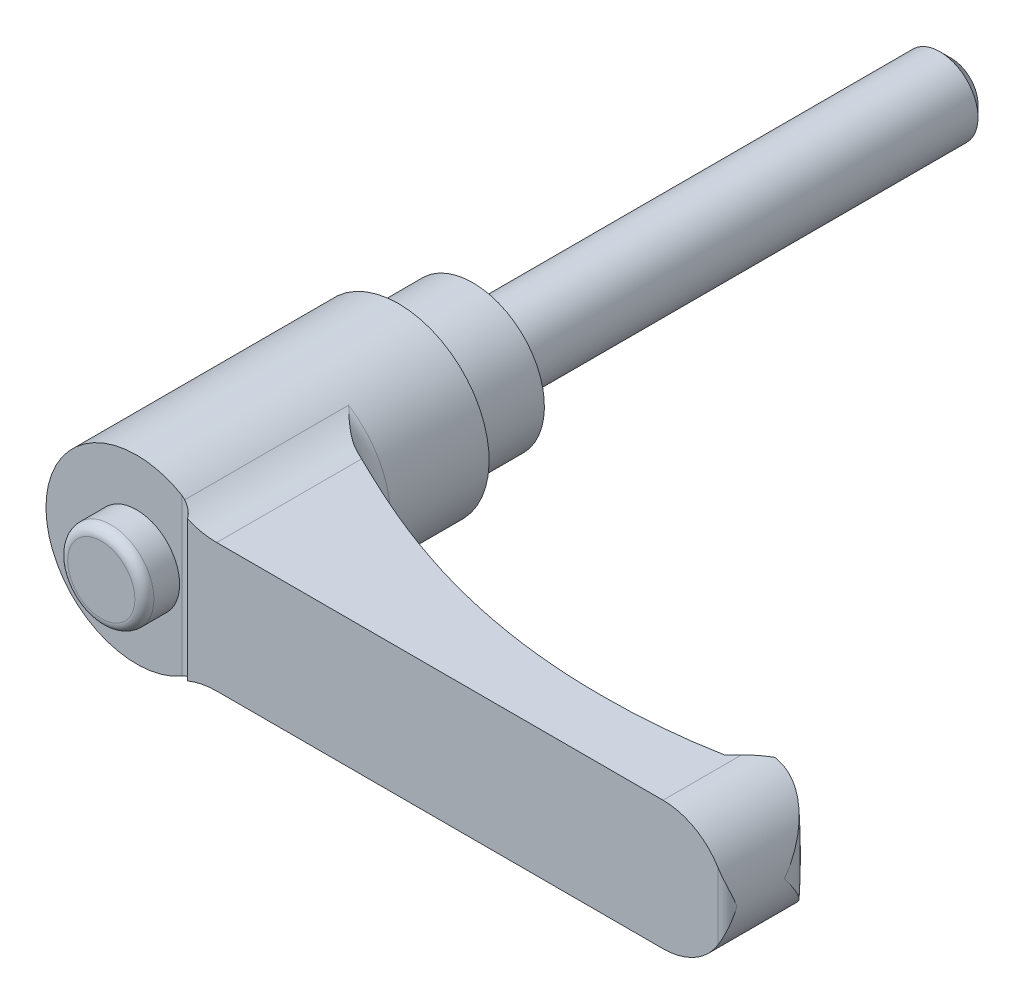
ISO-10303-21;
HEADER;
FILE_DESCRIPTION(('STEP AP214'),'2;1');
FILE_NAME('part.step','',(''),(''),'','','');
FILE_SCHEMA(('AUTOMOTIVE_DESIGN { 1 0 10303 214 1 1 1 1 }'));
ENDSEC;
DATA;
#1=APPLICATION_CONTEXT('core data for automotive mechanical design processes');
#2=APPLICATION_PROTOCOL_DEFINITION('international standard','automotive_design',2000,#1);
#3=PRODUCT_CONTEXT('',#1,'mechanical');
#4=PRODUCT('Part','Part','',(#3));
#5=PRODUCT_RELATED_PRODUCT_CATEGORY('part','',(#4));
#6=PRODUCT_DEFINITION_FORMATION('','',#4);
#7=PRODUCT_DEFINITION_CONTEXT('part definition',#1,'design');
#8=PRODUCT_DEFINITION('design','',#6,#7);
#9=PRODUCT_DEFINITION_SHAPE('','',#8);
#10=(LENGTH_UNIT() NAMED_UNIT(*) SI_UNIT(.MILLI.,.METRE.));
#11=(NAMED_UNIT(*) PLANE_ANGLE_UNIT() SI_UNIT($,.RADIAN.));
#12=(NAMED_UNIT(*) SI_UNIT($,.STERADIAN.) SOLID_ANGLE_UNIT());
#13=UNCERTAINTY_MEASURE_WITH_UNIT(LENGTH_MEASURE(1.E-05),#10,'distance_accuracy_value','');
#14=(GEOMETRIC_REPRESENTATION_CONTEXT(3) GLOBAL_UNCERTAINTY_ASSIGNED_CONTEXT((#13)) GLOBAL_UNIT_ASSIGNED_CONTEXT((#10,
#11,#12)) REPRESENTATION_CONTEXT('',''));
#15=CARTESIAN_POINT('',(0.,0.,0.));
#16=DIRECTION('',(0.,0.,1.));
#17=DIRECTION('',(1.,0.,0.));
#18=AXIS2_PLACEMENT_3D('',#15,#16,#17);
#19=CARTESIAN_POINT('',(6.,0.,0.));
#20=DIRECTION('',(0.,0.,1.));
#21=DIRECTION('',(0.,-1.,0.));
#22=AXIS2_PLACEMENT_3D('',#19,#20,#21);
#23=PLANE('',#22);
#24=CARTESIAN_POINT('',(0.,0.,0.));
#25=DIRECTION('',(0.,0.,-1.));
#26=DIRECTION('',(0.,1.,0.));
#27=AXIS2_PLACEMENT_3D('',#24,#25,#26);
#28=CIRCLE('',#27,4.);
#29=CARTESIAN_POINT('',(0.,4.,0.));
#30=VERTEX_POINT('',#29);
#31=EDGE_CURVE('E423',#30,#30,#28,.T.);
#32=ORIENTED_EDGE('',*,*,#31,.F.);
#33=EDGE_LOOP('',(#32));
#34=FACE_BOUND('',#33,.T.);
#35=CARTESIAN_POINT('',(0.,0.,0.));
#36=DIRECTION('',(0.,0.,-1.));
#37=DIRECTION('',(0.,1.,0.));
#38=AXIS2_PLACEMENT_3D('',#35,#36,#37);
#39=CIRCLE('',#38,6.);
#40=CARTESIAN_POINT('',(0.,6.,0.));
#41=VERTEX_POINT('',#40);
#42=EDGE_CURVE('E347',#41,#41,#39,.T.);
#43=ORIENTED_EDGE('',*,*,#42,.T.);
#44=EDGE_LOOP('',(#43));
#45=FACE_BOUND('',#44,.T.);
#46=ADVANCED_FACE('F14',(#34,#45),#23,.F.);
#47=CARTESIAN_POINT('',(0.,0.,35.5));
#48=DIRECTION('',(0.,0.,-1.));
#49=DIRECTION('',(0.,1.,0.));
#50=AXIS2_PLACEMENT_3D('',#47,#48,#49);
#51=PLANE('',#50);
#52=CARTESIAN_POINT('',(0.,0.,35.5));
#53=DIRECTION('',(0.,0.,-1.));
#54=DIRECTION('',(0.,1.,0.));
#55=AXIS2_PLACEMENT_3D('',#52,#53,#54);
#56=CIRCLE('',#55,9.5);
#57=CARTESIAN_POINT('',(4.75,-8.22724133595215,35.5));
#58=VERTEX_POINT('',#57);
#59=CARTESIAN_POINT('',(4.75,8.22724133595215,35.5));
#60=VERTEX_POINT('',#59);
#61=EDGE_CURVE('E332',#58,#60,#56,.T.);
#62=ORIENTED_EDGE('',*,*,#61,.F.);
#63=DIRECTION('',(0.,1.,0.));
#64=VECTOR('',#63,1.);
#65=CARTESIAN_POINT('',(4.75,-13.5,35.5));
#66=LINE('',#65,#64);
#67=EDGE_CURVE('E383',#58,#60,#66,.T.);
#68=ORIENTED_EDGE('',*,*,#67,.T.);
#69=EDGE_LOOP('',(#62,#68));
#70=FACE_BOUND('',#69,.T.);
#71=CARTESIAN_POINT('',(0.,0.,35.5));
#72=DIRECTION('',(0.,0.,-1.));
#73=DIRECTION('',(0.,1.,0.));
#74=AXIS2_PLACEMENT_3D('',#71,#72,#73);
#75=CIRCLE('',#74,4.52380952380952);
#76=CARTESIAN_POINT('',(0.,4.52380952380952,35.5));
#77=VERTEX_POINT('',#76);
#78=EDGE_CURVE('E183',#77,#77,#75,.F.);
#79=ORIENTED_EDGE('',*,*,#78,.F.);
#80=EDGE_LOOP('',(#79));
#81=FACE_BOUND('',#80,.T.);
#82=ADVANCED_FACE('F158',(#70,#81),#51,.F.);
#83=CARTESIAN_POINT('',(56.25,0.,0.));
#84=DIRECTION('',(0.,0.,1.));
#85=DIRECTION('',(0.,-1.,0.));
#86=AXIS2_PLACEMENT_3D('',#83,#84,#85);
#87=CYLINDRICAL_SURFACE('',#86,6.75);
#88=CARTESIAN_POINT('',(63.,0.,30.5));
#89=CARTESIAN_POINT('',(63.0000000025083,-0.0046874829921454,30.4965903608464));
#90=CARTESIAN_POINT('',(62.9999951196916,-0.0093750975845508,30.4931806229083));
#91=CARTESIAN_POINT('',(62.9990237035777,-0.475524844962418,30.1541065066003));
#92=CARTESIAN_POINT('',(62.9507141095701,-0.938185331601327,29.8175642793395));
#93=CARTESIAN_POINT('',(62.8060463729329,-1.62346497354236,29.3225480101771));
#94=CARTESIAN_POINT('',(62.7456147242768,-1.85084323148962,29.1588881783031));
#95=CARTESIAN_POINT('',(62.6000044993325,-2.30127271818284,28.8365968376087));
#96=CARTESIAN_POINT('',(62.5148384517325,-2.52432607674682,28.6779628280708));
#97=CARTESIAN_POINT('',(62.344804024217,-2.90644000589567,28.4087021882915));
#98=CARTESIAN_POINT('',(62.2657268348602,-3.06692788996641,28.2964051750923));
#99=CARTESIAN_POINT('',(62.0934111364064,-3.38371909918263,28.0768184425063));
#100=CARTESIAN_POINT('',(62.0001726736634,-3.5400224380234,27.9695287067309));
#101=CARTESIAN_POINT('',(61.7993668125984,-3.84715615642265,27.7614384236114));
#102=CARTESIAN_POINT('',(61.6918275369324,-3.99799655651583,27.6606257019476));
#103=CARTESIAN_POINT('',(61.4620426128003,-4.29326696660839,27.4668757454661));
#104=CARTESIAN_POINT('',(61.3398014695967,-4.43769892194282,27.3739361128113));
#105=CARTESIAN_POINT('',(61.0188552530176,-4.78536684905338,27.1560724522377));
#106=CARTESIAN_POINT('',(60.8112818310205,-4.9842025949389,27.0367418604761));
#107=CARTESIAN_POINT('',(60.4758984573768,-5.26551240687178,26.8795376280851));
#108=CARTESIAN_POINT('',(60.3601030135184,-5.35645651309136,26.8307690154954));
#109=CARTESIAN_POINT('',(60.1206554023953,-5.53195453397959,26.7416778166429));
#110=CARTESIAN_POINT('',(59.997005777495,-5.61651049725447,26.7013525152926));
#111=CARTESIAN_POINT('',(59.7699445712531,-5.76076929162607,26.6381973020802));
#112=CARTESIAN_POINT('',(59.667954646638,-5.82188686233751,26.6134697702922));
#113=CARTESIAN_POINT('',(59.4598154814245,-5.93917869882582,26.5707512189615));
#114=CARTESIAN_POINT('',(59.3536672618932,-5.99535416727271,26.5527585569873));
#115=CARTESIAN_POINT('',(59.1377410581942,-6.10229132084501,26.5242546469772));
#116=CARTESIAN_POINT('',(59.0279645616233,-6.15305518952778,26.5137403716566));
#117=CARTESIAN_POINT('',(58.8054681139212,-6.24873887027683,26.5009304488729));
#118=CARTESIAN_POINT('',(58.6927495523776,-6.29366138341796,26.4986309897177));
#119=CARTESIAN_POINT('',(58.4641163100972,-6.37770798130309,26.502966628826));
#120=CARTESIAN_POINT('',(58.3481815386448,-6.41677354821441,26.5096859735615));
#121=CARTESIAN_POINT('',(58.1152313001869,-6.48831686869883,26.5328398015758));
#122=CARTESIAN_POINT('',(57.9982157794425,-6.52079429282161,26.5492747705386));
#123=CARTESIAN_POINT('',(57.7644328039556,-6.57901960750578,26.5923251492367));
#124=CARTESIAN_POINT('',(57.6476652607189,-6.60477054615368,26.618935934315));
#125=CARTESIAN_POINT('',(57.41573023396,-6.64962508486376,26.6826067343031));
#126=CARTESIAN_POINT('',(57.3005622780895,-6.66873068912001,26.7196635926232));
#127=CARTESIAN_POINT('',(57.104290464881,-6.69624244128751,26.7926929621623));
#128=CARTESIAN_POINT('',(57.0224673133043,-6.70614558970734,26.8262017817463));
#129=CARTESIAN_POINT('',(56.8609556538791,-6.72278366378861,26.8986767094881));
#130=CARTESIAN_POINT('',(56.781266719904,-6.72951922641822,26.9376417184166));
#131=CARTESIAN_POINT('',(56.624433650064,-6.74006528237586,27.0209540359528));
#132=CARTESIAN_POINT('',(56.5472927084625,-6.74387222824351,27.0653077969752));
#133=CARTESIAN_POINT('',(56.3961054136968,-6.74884425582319,27.1591719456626));
#134=CARTESIAN_POINT('',(56.3220596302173,-6.75000885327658,27.2086832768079));
#135=CARTESIAN_POINT('',(56.2498,-6.74999999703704,27.2606710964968));
#136=B_SPLINE_CURVE_WITH_KNOTS('',3,(#88,#89,#90,#91,#92,#93,#94,#95,#96,#97,#98,#99,#100,#101,
#102,#103,#104,#105,#106,#107,#108,#109,#110,#111,#112,#113,#114,#115,#116,#117,#118,#119,#120,
#121,#122,#123,#124,#125,#126,#127,#128,#129,#130,#131,#132,#133,#134,#135),.UNSPECIFIED.,.F.,
.F.,(4,2,2,2,2,2,2,2,2,2,2,2,2,2,2,2,2,2,2,2,2,2,2,4),(0.,0.0173896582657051,1.7292315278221,
2.5882674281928,3.44686895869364,4.08007105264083,4.71327107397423,5.34524382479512,
5.97702340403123,6.9068284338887,7.37170994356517,7.83644173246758,8.20045511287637,
8.56437966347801,8.92815681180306,9.29176514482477,9.65879376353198,10.0258407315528,
10.3927210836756,10.7594906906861,11.0261722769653,11.2928002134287,11.5597506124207,
11.8267499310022),.UNSPECIFIED.);
#137=CARTESIAN_POINT('',(58.6622222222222,-6.30425919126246,26.5));
#138=VERTEX_POINT('',#137);
#139=CARTESIAN_POINT('',(63.,0.,30.5));
#140=VERTEX_POINT('',#139);
#141=EDGE_CURVE('E126',#138,#140,#136,.F.);
#142=ORIENTED_EDGE('',*,*,#141,.T.);
#143=CARTESIAN_POINT('',(63.,0.,30.5));
#144=CARTESIAN_POINT('',(63.0000000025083,0.00468748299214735,30.4965903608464));
#145=CARTESIAN_POINT('',(62.9999951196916,0.00937509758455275,30.4931806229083));
#146=CARTESIAN_POINT('',(62.9990237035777,0.47552484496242,30.1541065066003));
#147=CARTESIAN_POINT('',(62.9507141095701,0.938185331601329,29.8175642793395));
#148=CARTESIAN_POINT('',(62.8060463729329,1.62346497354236,29.3225480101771));
#149=CARTESIAN_POINT('',(62.7456147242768,1.85084323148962,29.1588881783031));
#150=CARTESIAN_POINT('',(62.6000044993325,2.30127271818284,28.8365968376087));
#151=CARTESIAN_POINT('',(62.5148384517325,2.52432607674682,28.6779628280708));
#152=CARTESIAN_POINT('',(62.344804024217,2.90644000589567,28.4087021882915));
#153=CARTESIAN_POINT('',(62.2657268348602,3.06692788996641,28.2964051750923));
#154=CARTESIAN_POINT('',(62.0934111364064,3.38371909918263,28.0768184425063));
#155=CARTESIAN_POINT('',(62.0001726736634,3.5400224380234,27.9695287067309));
#156=CARTESIAN_POINT('',(61.7993668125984,3.84715615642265,27.7614384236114));
#157=CARTESIAN_POINT('',(61.6918275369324,3.99799655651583,27.6606257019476));
#158=CARTESIAN_POINT('',(61.4620426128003,4.29326696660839,27.4668757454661));
#159=CARTESIAN_POINT('',(61.3398014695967,4.43769892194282,27.3739361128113));
#160=CARTESIAN_POINT('',(61.0188552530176,4.78536684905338,27.1560724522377));
#161=CARTESIAN_POINT('',(60.8112818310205,4.9842025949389,27.0367418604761));
#162=CARTESIAN_POINT('',(60.4758984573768,5.26551240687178,26.8795376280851));
#163=CARTESIAN_POINT('',(60.3601030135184,5.35645651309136,26.8307690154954));
#164=CARTESIAN_POINT('',(60.1206554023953,5.53195453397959,26.7416778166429));
#165=CARTESIAN_POINT('',(59.997005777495,5.61651049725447,26.7013525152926));
#166=CARTESIAN_POINT('',(59.7699445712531,5.76076929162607,26.6381973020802));
#167=CARTESIAN_POINT('',(59.667954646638,5.82188686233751,26.6134697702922));
#168=CARTESIAN_POINT('',(59.4598154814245,5.93917869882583,26.5707512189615));
#169=CARTESIAN_POINT('',(59.3536672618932,5.99535416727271,26.5527585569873));
#170=CARTESIAN_POINT('',(59.1377410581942,6.10229132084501,26.5242546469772));
#171=CARTESIAN_POINT('',(59.0279645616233,6.15305518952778,26.5137403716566));
#172=CARTESIAN_POINT('',(58.8054681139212,6.24873887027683,26.5009304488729));
#173=CARTESIAN_POINT('',(58.6927495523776,6.29366138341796,26.4986309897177));
#174=CARTESIAN_POINT('',(58.4641163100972,6.37770798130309,26.502966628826));
#175=CARTESIAN_POINT('',(58.3481815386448,6.41677354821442,26.5096859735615));
#176=CARTESIAN_POINT('',(58.1152313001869,6.48831686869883,26.5328398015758));
#177=CARTESIAN_POINT('',(57.9982157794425,6.52079429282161,26.5492747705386));
#178=CARTESIAN_POINT('',(57.7644328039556,6.57901960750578,26.5923251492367));
#179=CARTESIAN_POINT('',(57.6476652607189,6.60477054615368,26.618935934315));
#180=CARTESIAN_POINT('',(57.41573023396,6.64962508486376,26.6826067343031));
#181=CARTESIAN_POINT('',(57.3005622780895,6.66873068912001,26.7196635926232));
#182=CARTESIAN_POINT('',(57.1042904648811,6.69624244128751,26.7926929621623));
#183=CARTESIAN_POINT('',(57.0224673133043,6.70614558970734,26.8262017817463));
#184=CARTESIAN_POINT('',(56.8609556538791,6.72278366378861,26.8986767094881));
#185=CARTESIAN_POINT('',(56.781266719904,6.72951922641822,26.9376417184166));
#186=CARTESIAN_POINT('',(56.624433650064,6.74006528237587,27.0209540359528));
#187=CARTESIAN_POINT('',(56.5472927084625,6.74387222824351,27.0653077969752));
#188=CARTESIAN_POINT('',(56.3961054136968,6.74884425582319,27.1591719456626));
#189=CARTESIAN_POINT('',(56.3220596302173,6.75000885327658,27.2086832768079));
#190=CARTESIAN_POINT('',(56.2498,6.74999999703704,27.2606710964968));
#191=B_SPLINE_CURVE_WITH_KNOTS('',3,(#143,#144,#145,#146,#147,#148,#149,#150,#151,#152,#153,
#154,#155,#156,#157,#158,#159,#160,#161,#162,#163,#164,#165,#166,#167,#168,#169,#170,#171,#172,
#173,#174,#175,#176,#177,#178,#179,#180,#181,#182,#183,#184,#185,#186,#187,#188,#189,#190),
.UNSPECIFIED.,.F.,.F.,(4,2,2,2,2,2,2,2,2,2,2,2,2,2,2,2,2,2,2,2,2,2,2,4),(0.,0.0173896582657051,
1.7292315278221,2.5882674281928,3.44686895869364,4.08007105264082,4.71327107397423,
5.34524382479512,5.97702340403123,6.9068284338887,7.37170994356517,7.83644173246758,
8.20045511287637,8.56437966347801,8.92815681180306,9.29176514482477,9.65879376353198,
10.0258407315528,10.3927210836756,10.7594906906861,11.0261722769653,11.2928002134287,
11.5597506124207,11.8267499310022),.UNSPECIFIED.);
#192=CARTESIAN_POINT('',(58.6622222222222,6.30425919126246,26.5));
#193=VERTEX_POINT('',#192);
#194=EDGE_CURVE('E123',#140,#193,#191,.T.);
#195=ORIENTED_EDGE('',*,*,#194,.T.);
#196=CARTESIAN_POINT('',(56.25,0.,26.5));
#197=DIRECTION('',(0.,0.,-1.));
#198=DIRECTION('',(0.,1.,0.));
#199=AXIS2_PLACEMENT_3D('',#196,#197,#198);
#200=CIRCLE('',#199,6.75);
#201=CARTESIAN_POINT('',(58.,6.51920240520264,26.5));
#202=VERTEX_POINT('',#201);
#203=EDGE_CURVE('E308',#193,#202,#200,.F.);
#204=ORIENTED_EDGE('',*,*,#203,.T.);
#205=CARTESIAN_POINT('',(56.25,0.,28.25));
#206=DIRECTION('',(-0.707106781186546,0.,-0.70710678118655));
#207=DIRECTION('',(-0.70710678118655,0.,0.707106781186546));
#208=AXIS2_PLACEMENT_3D('',#205,#206,#207);
#209=ELLIPSE('',#208,9.54594154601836,6.75);
#210=CARTESIAN_POINT('',(56.25,6.75,28.25));
#211=VERTEX_POINT('',#210);
#212=EDGE_CURVE('E374',#202,#211,#209,.F.);
#213=ORIENTED_EDGE('',*,*,#212,.T.);
#214=DIRECTION('',(0.,0.,1.));
#215=VECTOR('',#214,1.);
#216=CARTESIAN_POINT('',(56.25,6.75,0.));
#217=LINE('',#216,#215);
#218=CARTESIAN_POINT('',(56.25,6.75,36.5));
#219=VERTEX_POINT('',#218);
#220=EDGE_CURVE('E330',#211,#219,#217,.T.);
#221=ORIENTED_EDGE('',*,*,#220,.T.);
#222=CARTESIAN_POINT('',(56.25,0.,36.5));
#223=DIRECTION('',(0.,0.,1.));
#224=DIRECTION('',(0.,-1.,0.));
#225=AXIS2_PLACEMENT_3D('',#222,#223,#224);
#226=CIRCLE('',#225,6.75);
#227=CARTESIAN_POINT('',(62.,3.53553390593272,36.5));
#228=VERTEX_POINT('',#227);
#229=EDGE_CURVE('E322',#228,#219,#226,.T.);
#230=ORIENTED_EDGE('',*,*,#229,.F.);
#231=CARTESIAN_POINT('',(62.,3.53553390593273,36.5));
#232=CARTESIAN_POINT('',(62.0299932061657,3.48675666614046,36.4999933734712));
#233=CARTESIAN_POINT('',(62.0593538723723,3.43761273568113,36.4986515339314));
#234=CARTESIAN_POINT('',(62.1167538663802,3.33870692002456,36.4935798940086));
#235=CARTESIAN_POINT('',(62.1447937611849,3.28894531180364,36.489851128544));
#236=CARTESIAN_POINT('',(62.2267562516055,3.13908056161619,36.4755285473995));
#237=CARTESIAN_POINT('',(62.2786643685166,3.03816514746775,36.4617957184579));
#238=CARTESIAN_POINT('',(62.3766467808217,2.83536966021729,36.4277987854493));
#239=CARTESIAN_POINT('',(62.4227515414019,2.73349792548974,36.4075709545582));
#240=CARTESIAN_POINT('',(62.509502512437,2.52854152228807,36.3618646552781));
#241=CARTESIAN_POINT('',(62.550144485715,2.42545597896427,36.3363821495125));
#242=CARTESIAN_POINT('',(62.6493297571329,2.15471359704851,36.2642737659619));
#243=CARTESIAN_POINT('',(62.7035065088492,1.98634279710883,36.2142841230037));
#244=CARTESIAN_POINT('',(62.7980553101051,1.64812969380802,36.1068184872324));
#245=CARTESIAN_POINT('',(62.8384218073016,1.4782868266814,36.0493394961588));
#246=CARTESIAN_POINT('',(62.9057483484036,1.1374266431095,35.9293690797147));
#247=CARTESIAN_POINT('',(62.9326868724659,0.966407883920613,35.8668697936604));
#248=CARTESIAN_POINT('',(62.9733111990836,0.623942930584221,35.7390768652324));
#249=CARTESIAN_POINT('',(62.9870036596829,0.452496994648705,35.6737846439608));
#250=CARTESIAN_POINT('',(62.997837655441,0.192449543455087,35.5740662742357));
#251=CARTESIAN_POINT('',(62.999781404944,0.103891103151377,35.539987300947));
#252=CARTESIAN_POINT('',(62.9999941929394,0.0102233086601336,35.5039349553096));
#253=CARTESIAN_POINT('',(62.9999999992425,0.00511164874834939,35.5019674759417));
#254=CARTESIAN_POINT('',(63.,0.,35.5));
#255=B_SPLINE_CURVE_WITH_KNOTS('',3,(#231,#232,#233,#234,#235,#236,#237,#238,#239,#240,#241,
#242,#243,#244,#245,#246,#247,#248,#249,#250,#251,#252,#253,#254),.UNSPECIFIED.,.F.,.F.,(4,2,2,
2,2,2,2,2,2,2,2,4),(0.,0.171732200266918,0.343389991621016,0.685890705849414,1.02651095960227,
1.36739390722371,1.91796289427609,2.46875297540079,3.02042294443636,3.57181547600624,
3.85648313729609,3.87291482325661),.UNSPECIFIED.);
#256=CARTESIAN_POINT('',(63.,0.,35.5));
#257=VERTEX_POINT('',#256);
#258=EDGE_CURVE('E169',#257,#228,#255,.F.);
#259=ORIENTED_EDGE('',*,*,#258,.F.);
#260=CARTESIAN_POINT('',(62.,-3.53553390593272,36.5));
#261=CARTESIAN_POINT('',(62.0299932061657,-3.48675666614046,36.4999933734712));
#262=CARTESIAN_POINT('',(62.0593538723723,-3.43761273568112,36.4986515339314));
#263=CARTESIAN_POINT('',(62.1167538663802,-3.33870692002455,36.4935798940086));
#264=CARTESIAN_POINT('',(62.1447937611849,-3.28894531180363,36.489851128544));
#265=CARTESIAN_POINT('',(62.2267562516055,-3.13908056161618,36.4755285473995));
#266=CARTESIAN_POINT('',(62.2786643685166,-3.03816514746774,36.4617957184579));
#267=CARTESIAN_POINT('',(62.3766467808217,-2.83536966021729,36.4277987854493));
#268=CARTESIAN_POINT('',(62.4227515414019,-2.73349792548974,36.4075709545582));
#269=CARTESIAN_POINT('',(62.509502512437,-2.52854152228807,36.3618646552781));
#270=CARTESIAN_POINT('',(62.550144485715,-2.42545597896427,36.3363821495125));
#271=CARTESIAN_POINT('',(62.6493297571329,-2.15471359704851,36.2642737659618));
#272=CARTESIAN_POINT('',(62.7035065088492,-1.98634279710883,36.2142841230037));
#273=CARTESIAN_POINT('',(62.7980553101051,-1.64812969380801,36.1068184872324));
#274=CARTESIAN_POINT('',(62.8384218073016,-1.4782868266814,36.0493394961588));
#275=CARTESIAN_POINT('',(62.9057483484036,-1.1374266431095,35.9293690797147));
#276=CARTESIAN_POINT('',(62.9326868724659,-0.966407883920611,35.8668697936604));
#277=CARTESIAN_POINT('',(62.9733111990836,-0.623942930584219,35.7390768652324));
#278=CARTESIAN_POINT('',(62.9870036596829,-0.452496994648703,35.6737846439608));
#279=CARTESIAN_POINT('',(62.997837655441,-0.192449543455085,35.5740662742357));
#280=CARTESIAN_POINT('',(62.999781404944,-0.103891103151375,35.539987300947));
#281=CARTESIAN_POINT('',(62.9999941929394,-0.0102233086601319,35.5039349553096));
#282=CARTESIAN_POINT('',(62.9999999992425,-0.00511164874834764,35.5019674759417));
#283=CARTESIAN_POINT('',(63.,0.,35.5));
#284=B_SPLINE_CURVE_WITH_KNOTS('',3,(#260,#261,#262,#263,#264,#265,#266,#267,#268,#269,#270,
#271,#272,#273,#274,#275,#276,#277,#278,#279,#280,#281,#282,#283),.UNSPECIFIED.,.F.,.F.,(4,2,2,
2,2,2,2,2,2,2,2,4),(0.,0.171732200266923,0.34338999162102,0.685890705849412,1.02651095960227,
1.36739390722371,1.91796289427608,2.46875297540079,3.02042294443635,3.57181547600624,
3.85648313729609,3.8729148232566),.UNSPECIFIED.);
#285=CARTESIAN_POINT('',(62.,-3.53553390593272,36.5));
#286=VERTEX_POINT('',#285);
#287=EDGE_CURVE('E177',#286,#257,#284,.T.);
#288=ORIENTED_EDGE('',*,*,#287,.F.);
#289=CARTESIAN_POINT('',(56.25,-6.75,36.5));
#290=VERTEX_POINT('',#289);
#291=EDGE_CURVE('E310',#290,#286,#226,.T.);
#292=ORIENTED_EDGE('',*,*,#291,.F.);
#293=DIRECTION('',(0.,0.,1.));
#294=VECTOR('',#293,1.);
#295=CARTESIAN_POINT('',(56.25,-6.75,0.));
#296=LINE('',#295,#294);
#297=CARTESIAN_POINT('',(56.25,-6.75,28.25));
#298=VERTEX_POINT('',#297);
#299=EDGE_CURVE('E355',#298,#290,#296,.T.);
#300=ORIENTED_EDGE('',*,*,#299,.F.);
#301=CARTESIAN_POINT('',(58.,-6.51920240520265,26.5));
#302=VERTEX_POINT('',#301);
#303=EDGE_CURVE('E375',#298,#302,#209,.F.);
#304=ORIENTED_EDGE('',*,*,#303,.T.);
#305=EDGE_CURVE('E134',#302,#138,#200,.F.);
#306=ORIENTED_EDGE('',*,*,#305,.T.);
#307=EDGE_LOOP('',(#142,#195,#204,#213,#221,#230,#259,#288,#292,#300,#304,#306));
#308=FACE_BOUND('',#307,.T.);
#309=ADVANCED_FACE('F132',(#308),#87,.T.);
#310=CARTESIAN_POINT('',(59.,-13.5,26.5));
#311=DIRECTION('',(0.,0.,-1.));
#312=DIRECTION('',(0.,1.,0.));
#313=AXIS2_PLACEMENT_3D('',#310,#311,#312);
#314=PLANE('',#313);
#315=ORIENTED_EDGE('',*,*,#203,.F.);
#316=CARTESIAN_POINT('',(0.,0.,26.5));
#317=DIRECTION('',(0.,0.,-1.));
#318=DIRECTION('',(0.,1.,0.));
#319=AXIS2_PLACEMENT_3D('',#316,#317,#318);
#320=CIRCLE('',#319,59.);
#321=EDGE_CURVE('E37',#193,#138,#320,.T.);
#322=ORIENTED_EDGE('',*,*,#321,.T.);
#323=ORIENTED_EDGE('',*,*,#305,.F.);
#324=DIRECTION('',(0.,1.,0.));
#325=VECTOR('',#324,1.);
#326=CARTESIAN_POINT('',(58.,-13.5,26.5));
#327=LINE('',#326,#325);
#328=EDGE_CURVE('E327',#302,#202,#327,.T.);
#329=ORIENTED_EDGE('',*,*,#328,.T.);
#330=EDGE_LOOP('',(#315,#322,#323,#329));
#331=FACE_BOUND('',#330,.T.);
#332=ADVANCED_FACE('F157',(#331),#314,.T.);
#333=CARTESIAN_POINT('',(0.,0.,36.5));
#334=DIRECTION('',(0.,0.,1.));
#335=DIRECTION('',(0.,-1.,0.));
#336=AXIS2_PLACEMENT_3D('',#333,#334,#335);
#337=PLANE('',#336);
#338=CARTESIAN_POINT('',(9.41740410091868,14.75,36.5));
#339=DIRECTION('',(0.,0.,1.));
#340=DIRECTION('',(1.,0.,0.));
#341=AXIS2_PLACEMENT_3D('',#338,#339,#340);
#342=CIRCLE('',#341,8.);
#343=CARTESIAN_POINT('',(6.33333333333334,7.36836688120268,36.5));
#344=VERTEX_POINT('',#343);
#345=CARTESIAN_POINT('',(9.41740410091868,6.75,36.5));
#346=VERTEX_POINT('',#345);
#347=EDGE_CURVE('E369',#344,#346,#342,.T.);
#348=ORIENTED_EDGE('',*,*,#347,.F.);
#349=DIRECTION('',(0.,1.,0.));
#350=VECTOR('',#349,1.);
#351=CARTESIAN_POINT('',(6.33333333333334,-13.5,36.5));
#352=LINE('',#351,#350);
#353=CARTESIAN_POINT('',(6.33333333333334,-7.36836688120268,36.5));
#354=VERTEX_POINT('',#353);
#355=EDGE_CURVE('E326',#354,#344,#352,.T.);
#356=ORIENTED_EDGE('',*,*,#355,.F.);
#357=CARTESIAN_POINT('',(9.41740410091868,-14.75,36.5));
#358=DIRECTION('',(0.,0.,1.));
#359=DIRECTION('',(1.,0.,0.));
#360=AXIS2_PLACEMENT_3D('',#357,#358,#359);
#361=CIRCLE('',#360,8.);
#362=CARTESIAN_POINT('',(9.41740410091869,-6.75,36.5));
#363=VERTEX_POINT('',#362);
#364=EDGE_CURVE('E361',#363,#354,#361,.T.);
#365=ORIENTED_EDGE('',*,*,#364,.F.);
#366=DIRECTION('',(-1.,0.,0.));
#367=VECTOR('',#366,1.);
#368=CARTESIAN_POINT('',(56.25,-6.75,36.5));
#369=LINE('',#368,#367);
#370=EDGE_CURVE('E364',#290,#363,#369,.T.);
#371=ORIENTED_EDGE('',*,*,#370,.F.);
#372=ORIENTED_EDGE('',*,*,#291,.T.);
#373=DIRECTION('',(0.,1.,0.));
#374=VECTOR('',#373,1.);
#375=CARTESIAN_POINT('',(62.,-13.5,36.5));
#376=LINE('',#375,#374);
#377=EDGE_CURVE('E315',#286,#228,#376,.T.);
#378=ORIENTED_EDGE('',*,*,#377,.T.);
#379=ORIENTED_EDGE('',*,*,#229,.T.);
#380=DIRECTION('',(1.,0.,0.));
#381=VECTOR('',#380,1.);
#382=CARTESIAN_POINT('',(9.41740410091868,6.75,36.5));
#383=LINE('',#382,#381);
#384=EDGE_CURVE('E367',#346,#219,#383,.T.);
#385=ORIENTED_EDGE('',*,*,#384,.F.);
#386=EDGE_LOOP('',(#348,#356,#365,#371,#372,#378,#379,#385));
#387=FACE_BOUND('',#386,.T.);
#388=ADVANCED_FACE('F240',(#387),#337,.T.);
#389=CARTESIAN_POINT('',(0.,0.,0.));
#390=DIRECTION('',(0.,0.,-1.));
#391=DIRECTION('',(0.,1.,0.));
#392=AXIS2_PLACEMENT_3D('',#389,#390,#391);
#393=CYLINDRICAL_SURFACE('',#392,9.5);
#394=CARTESIAN_POINT('',(0.,0.,18.3481601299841));
#395=DIRECTION('',(0.,0.,-1.));
#396=DIRECTION('',(0.,1.,0.));
#397=AXIS2_PLACEMENT_3D('',#394,#395,#396);
#398=CIRCLE('',#397,9.5);
#399=CARTESIAN_POINT('',(5.11230508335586,8.00714285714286,18.3481601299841));
#400=VERTEX_POINT('',#399);
#401=CARTESIAN_POINT('',(5.11230508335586,-8.00714285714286,18.3481601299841));
#402=VERTEX_POINT('',#401);
#403=EDGE_CURVE('E413',#400,#402,#398,.T.);
#404=ORIENTED_EDGE('',*,*,#403,.T.);
#405=DIRECTION('',(0.,0.,1.));
#406=VECTOR('',#405,1.);
#407=CARTESIAN_POINT('',(5.11230508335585,-8.00714285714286,0.));
#408=LINE('',#407,#406);
#409=CARTESIAN_POINT('',(5.11230508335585,-8.00714285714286,35.5614827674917));
#410=VERTEX_POINT('',#409);
#411=EDGE_CURVE('E359',#402,#410,#408,.T.);
#412=ORIENTED_EDGE('',*,*,#411,.T.);
#413=CARTESIAN_POINT('',(4.75,-8.22724133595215,35.5));
#414=CARTESIAN_POINT('',(4.82354897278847,-8.18479174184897,35.5056127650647));
#415=CARTESIAN_POINT('',(4.89626028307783,-8.1414834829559,35.5152432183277));
#416=CARTESIAN_POINT('',(5.03945202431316,-8.05362753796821,35.5421901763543));
#417=CARTESIAN_POINT('',(5.10993308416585,-8.00908020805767,35.5595044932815));
#418=CARTESIAN_POINT('',(5.24861636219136,-7.91889687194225,35.6016146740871));
#419=CARTESIAN_POINT('',(5.31680005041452,-7.87325555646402,35.6264601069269));
#420=CARTESIAN_POINT('',(5.44990684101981,-7.7817124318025,35.6832973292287));
#421=CARTESIAN_POINT('',(5.51483003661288,-7.7358106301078,35.7152889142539));
#422=CARTESIAN_POINT('',(5.69141984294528,-7.6077148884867,35.8145402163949));
#423=CARTESIAN_POINT('',(5.79903338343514,-7.52579740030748,35.8895684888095));
#424=CARTESIAN_POINT('',(5.99917718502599,-7.36722875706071,36.0610902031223));
#425=CARTESIAN_POINT('',(6.09178179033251,-7.29055280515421,36.157471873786));
#426=CARTESIAN_POINT('',(6.20382113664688,-7.19472379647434,36.3011658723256));
#427=CARTESIAN_POINT('',(6.23139044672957,-7.17084441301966,36.33916914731));
#428=CARTESIAN_POINT('',(6.28417716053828,-7.12462925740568,36.4176957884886));
#429=CARTESIAN_POINT('',(6.30939340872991,-7.1022942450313,36.4582203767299));
#430=CARTESIAN_POINT('',(6.33333333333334,-7.08088192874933,36.5));
#431=B_SPLINE_CURVE_WITH_KNOTS('',3,(#413,#414,#415,#416,#417,#418,#419,#420,#421,#422,#423,
#424,#425,#426,#427,#428,#429,#430),.UNSPECIFIED.,.F.,.F.,(4,2,2,2,2,2,2,2,4),(0.,
0.25516766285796,0.510262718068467,0.767074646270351,1.02387922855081,1.48566336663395,
1.94508518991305,2.10299549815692,2.26098294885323),.UNSPECIFIED.);
#432=EDGE_CURVE('E214',#58,#410,#431,.T.);
#433=ORIENTED_EDGE('',*,*,#432,.F.);
#434=ORIENTED_EDGE('',*,*,#61,.T.);
#435=CARTESIAN_POINT('',(6.33333333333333,7.08088192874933,36.5));
#436=CARTESIAN_POINT('',(6.30193651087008,7.10896982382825,36.4452145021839));
#437=CARTESIAN_POINT('',(6.26833956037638,7.13863883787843,36.3925689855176));
#438=CARTESIAN_POINT('',(6.19723055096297,7.20045324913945,36.2916619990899));
#439=CARTESIAN_POINT('',(6.15972345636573,7.23259549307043,36.243395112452));
#440=CARTESIAN_POINT('',(6.08131079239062,7.2986494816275,36.1513438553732));
#441=CARTESIAN_POINT('',(6.04041526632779,7.33255589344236,36.1075470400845));
#442=CARTESIAN_POINT('',(5.95546899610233,7.40171574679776,36.0242830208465));
#443=CARTESIAN_POINT('',(5.91141716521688,7.4369696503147,35.9848173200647));
#444=CARTESIAN_POINT('',(5.7754647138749,7.54368484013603,35.8733623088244));
#445=CARTESIAN_POINT('',(5.67929205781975,7.61650473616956,35.8077657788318));
#446=CARTESIAN_POINT('',(5.47750803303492,7.76289095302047,35.6942705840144));
#447=CARTESIAN_POINT('',(5.37189158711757,7.83645765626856,35.6463815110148));
#448=CARTESIAN_POINT('',(5.1806466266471,7.96370194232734,35.5790108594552));
#449=CARTESIAN_POINT('',(5.09668204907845,8.01772299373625,35.5554125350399));
#450=CARTESIAN_POINT('',(4.92555498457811,8.12398585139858,35.5192948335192));
#451=CARTESIAN_POINT('',(4.83839896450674,8.17623088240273,35.5067542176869));
#452=CARTESIAN_POINT('',(4.75,8.22724133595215,35.5));
#453=B_SPLINE_CURVE_WITH_KNOTS('',3,(#435,#436,#437,#438,#439,#440,#441,#442,#443,#444,#445,
#446,#447,#448,#449,#450,#451,#452),.UNSPECIFIED.,.F.,.F.,(4,2,2,2,2,2,2,2,4),(0.,
0.207163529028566,0.414067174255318,0.620378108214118,0.826760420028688,1.23705708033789,
1.64757566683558,1.9547198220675,2.26127274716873),.UNSPECIFIED.);
#454=CARTESIAN_POINT('',(5.11230508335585,8.00714285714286,35.5614827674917));
#455=VERTEX_POINT('',#454);
#456=EDGE_CURVE('E228',#455,#60,#453,.T.);
#457=ORIENTED_EDGE('',*,*,#456,.F.);
#458=DIRECTION('',(0.,0.,1.));
#459=VECTOR('',#458,1.);
#460=CARTESIAN_POINT('',(5.11230508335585,8.00714285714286,0.));
#461=LINE('',#460,#459);
#462=EDGE_CURVE('E350',#400,#455,#461,.T.);
#463=ORIENTED_EDGE('',*,*,#462,.F.);
#464=EDGE_LOOP('',(#404,#412,#433,#434,#457,#463));
#465=FACE_BOUND('',#464,.T.);
#466=CARTESIAN_POINT('',(0.,0.,8.));
#467=DIRECTION('',(0.,0.,-1.));
#468=DIRECTION('',(0.,1.,0.));
#469=AXIS2_PLACEMENT_3D('',#466,#467,#468);
#470=CIRCLE('',#469,9.5);
#471=CARTESIAN_POINT('',(0.,9.5,8.));
#472=VERTEX_POINT('',#471);
#473=EDGE_CURVE('E333',#472,#472,#470,.T.);
#474=ORIENTED_EDGE('',*,*,#473,.F.);
#475=EDGE_LOOP('',(#474));
#476=FACE_BOUND('',#475,.T.);
#477=ADVANCED_FACE('F238',(#465,#476),#393,.T.);
#478=CARTESIAN_POINT('',(9.41740410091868,14.75,0.));
#479=DIRECTION('',(0.,0.,1.));
#480=DIRECTION('',(0.,-1.,0.));
#481=AXIS2_PLACEMENT_3D('',#478,#479,#480);
#482=CYLINDRICAL_SURFACE('',#481,8.);
#483=DIRECTION('',(0.,0.,1.));
#484=VECTOR('',#483,1.);
#485=CARTESIAN_POINT('',(9.41740410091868,6.75,0.));
#486=LINE('',#485,#484);
#487=CARTESIAN_POINT('',(9.41740410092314,6.75,21.3021638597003));
#488=VERTEX_POINT('',#487);
#489=EDGE_CURVE('E352',#488,#346,#486,.T.);
#490=ORIENTED_EDGE('',*,*,#489,.F.);
#491=CARTESIAN_POINT('',(9.41760410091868,6.7500000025,21.3022609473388));
#492=CARTESIAN_POINT('',(9.34663199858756,6.74999859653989,21.2678090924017));
#493=CARTESIAN_POINT('',(9.27552780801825,6.75094090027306,21.2336266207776));
#494=CARTESIAN_POINT('',(9.13312349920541,6.75473540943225,21.1659081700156));
#495=CARTESIAN_POINT('',(9.06182355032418,6.75758629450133,21.1323717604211));
#496=CARTESIAN_POINT('',(8.91899698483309,6.7652204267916,21.066004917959));
#497=CARTESIAN_POINT('',(8.84747036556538,6.77000369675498,21.0331744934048));
#498=CARTESIAN_POINT('',(8.704162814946,6.78153362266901,20.9682923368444));
#499=CARTESIAN_POINT('',(8.63238174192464,6.78828163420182,20.9362411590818));
#500=CARTESIAN_POINT('',(8.56050869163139,6.79602424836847,20.9046385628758));
#501=B_SPLINE_CURVE_WITH_KNOTS('',3,(#491,#492,#493,#494,#495,#496,#497,#498,#499,#500),
.UNSPECIFIED.,.F.,.F.,(4,2,2,2,4),(0.,0.236671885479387,0.473180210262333,0.709691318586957,
0.946365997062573),.UNSPECIFIED.);
#502=CARTESIAN_POINT('',(8.56096354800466,6.79597525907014,20.9048385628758));
#503=VERTEX_POINT('',#502);
#504=EDGE_CURVE('E246',#488,#503,#501,.T.);
#505=ORIENTED_EDGE('',*,*,#504,.T.);
#506=CARTESIAN_POINT('',(8.56141843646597,6.79592629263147,20.9050385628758));
#507=CARTESIAN_POINT('',(8.47420918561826,6.80531273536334,20.8666951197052));
#508=CARTESIAN_POINT('',(8.38798367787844,6.81604134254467,20.8265142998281));
#509=CARTESIAN_POINT('',(8.21753113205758,6.84002445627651,20.7428900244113));
#510=CARTESIAN_POINT('',(8.13330325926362,6.85327788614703,20.6994479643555));
#511=CARTESIAN_POINT('',(7.88393651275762,6.89653514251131,20.5650030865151));
#512=CARTESIAN_POINT('',(7.72171249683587,6.9300806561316,20.4697011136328));
#513=CARTESIAN_POINT('',(7.40583761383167,7.00533652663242,20.2709379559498));
#514=CARTESIAN_POINT('',(7.25214096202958,7.0469964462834,20.1675294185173));
#515=CARTESIAN_POINT('',(6.95163567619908,7.13786246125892,19.9540740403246));
#516=CARTESIAN_POINT('',(6.80483124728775,7.18707308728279,19.8440232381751));
#517=CARTESIAN_POINT('',(6.52235248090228,7.29074005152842,19.6227797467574));
#518=CARTESIAN_POINT('',(6.38647079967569,7.34497015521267,19.5117441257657));
#519=CARTESIAN_POINT('',(6.12012077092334,7.45966750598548,19.286442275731));
#520=CARTESIAN_POINT('',(5.98965290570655,7.5201353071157,19.1721757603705));
#521=CARTESIAN_POINT('',(5.73356790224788,7.64719834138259,18.9415280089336));
#522=CARTESIAN_POINT('',(5.60795285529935,7.71379617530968,18.825145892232));
#523=CARTESIAN_POINT('',(5.36116691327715,7.853115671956,18.5913699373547));
#524=CARTESIAN_POINT('',(5.23999538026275,7.92583645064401,18.4739762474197));
#525=CARTESIAN_POINT('',(5.11800178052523,8.00350824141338,18.3537764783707));
#526=CARTESIAN_POINT('',(5.11515285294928,8.00532465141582,18.3509683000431));
#527=CARTESIAN_POINT('',(5.11230508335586,8.00714285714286,18.3481601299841));
#528=B_SPLINE_CURVE_WITH_KNOTS('',3,(#506,#507,#508,#509,#510,#511,#512,#513,#514,#515,#516,
#517,#518,#519,#520,#521,#522,#523,#524,#525,#526,#527),.UNSPECIFIED.,.F.,.F.,(4,2,2,2,2,2,2,2,
2,2,4),(0.,0.287104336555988,0.574086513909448,1.14672714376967,1.7159158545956,
2.28544744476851,2.83621563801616,3.38703279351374,3.93808473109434,4.48905724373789,
4.50223731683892),.UNSPECIFIED.);
#529=EDGE_CURVE('E393',#503,#400,#528,.T.);
#530=ORIENTED_EDGE('',*,*,#529,.T.);
#531=ORIENTED_EDGE('',*,*,#462,.T.);
#532=CARTESIAN_POINT('',(6.33333333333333,7.36836688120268,36.5));
#533=CARTESIAN_POINT('',(6.30572631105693,7.37990157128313,36.4517939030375));
#534=CARTESIAN_POINT('',(6.27620115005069,7.39241872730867,36.4049318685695));
#535=CARTESIAN_POINT('',(6.21369042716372,7.41942165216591,36.3142041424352));
#536=CARTESIAN_POINT('',(6.18070621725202,7.433906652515,36.2703372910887));
#537=CARTESIAN_POINT('',(6.11180020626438,7.46478219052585,36.1860768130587));
#538=CARTESIAN_POINT('',(6.07589356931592,7.48116305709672,36.1456672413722));
#539=CARTESIAN_POINT('',(6.001409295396,7.51586753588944,36.0683091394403));
#540=CARTESIAN_POINT('',(5.96283154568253,7.53419123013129,36.0313607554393));
#541=CARTESIAN_POINT('',(5.84377892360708,7.59200134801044,35.9260570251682));
#542=CARTESIAN_POINT('',(5.75985492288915,7.63438377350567,35.8630866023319));
#543=CARTESIAN_POINT('',(5.58613979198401,7.72639161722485,35.7523382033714));
#544=CARTESIAN_POINT('',(5.49634385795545,7.77602300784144,35.7045728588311));
#545=CARTESIAN_POINT('',(5.35683601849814,7.85689272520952,35.6430239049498));
#546=CARTESIAN_POINT('',(5.30809845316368,7.88582630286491,35.6238148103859));
#547=CARTESIAN_POINT('',(5.21035384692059,7.94529574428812,35.5895762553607));
#548=CARTESIAN_POINT('',(5.1613480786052,7.975826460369,35.5745342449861));
#549=CARTESIAN_POINT('',(5.11230508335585,8.00714285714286,35.5614827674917));
#550=B_SPLINE_CURVE_WITH_KNOTS('',3,(#532,#533,#534,#535,#536,#537,#538,#539,#540,#541,#542,
#543,#544,#545,#546,#547,#548,#549),.UNSPECIFIED.,.F.,.F.,(4,2,2,2,2,2,2,2,4),(0.,
0.170139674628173,0.340213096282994,0.50945430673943,0.678702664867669,1.01657399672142,
1.35472528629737,1.53411415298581,1.7129567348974),.UNSPECIFIED.);
#551=EDGE_CURVE('E222',#344,#455,#550,.T.);
#552=ORIENTED_EDGE('',*,*,#551,.F.);
#553=ORIENTED_EDGE('',*,*,#347,.T.);
#554=EDGE_LOOP('',(#490,#505,#530,#531,#552,#553));
#555=FACE_BOUND('',#554,.T.);
#556=ADVANCED_FACE('F234',(#555),#482,.F.);
#557=CARTESIAN_POINT('',(9.41740410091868,6.75,0.));
#558=DIRECTION('',(0.,-1.,0.));
#559=DIRECTION('',(1.,0.,0.));
#560=AXIS2_PLACEMENT_3D('',#557,#558,#559);
#561=PLANE('',#560);
#562=CARTESIAN_POINT('',(43.8904150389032,6.75,-32.7854085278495));
#563=DIRECTION('',(0.,-1.,0.));
#564=DIRECTION('',(1.,0.,0.));
#565=AXIS2_PLACEMENT_3D('',#562,#563,#564);
#566=CIRCLE('',#565,63.);
#567=CARTESIAN_POINT('',(43.630890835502,6.75000000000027,30.2140569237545));
#568=VERTEX_POINT('',#567);
#569=CARTESIAN_POINT('',(55.3333333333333,6.75,29.1666666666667));
#570=VERTEX_POINT('',#569);
#571=EDGE_CURVE('E376',#568,#570,#566,.F.);
#572=ORIENTED_EDGE('',*,*,#571,.F.);
#573=CARTESIAN_POINT('',(31.7211018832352,6.75,29.163677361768));
#574=CARTESIAN_POINT('',(30.4815814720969,6.75,28.9394124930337));
#575=CARTESIAN_POINT('',(29.248337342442,6.75,28.6800208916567));
#576=CARTESIAN_POINT('',(26.798292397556,6.75,28.093381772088));
#577=CARTESIAN_POINT('',(25.5814894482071,6.75,27.7661431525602));
#578=CARTESIAN_POINT('',(23.7726077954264,6.75,27.2275084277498));
#579=CARTESIAN_POINT('',(23.1732161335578,6.75,27.0403034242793));
#580=CARTESIAN_POINT('',(21.9794838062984,6.75,26.6504397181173));
#581=CARTESIAN_POINT('',(21.3851430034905,6.75,26.4477814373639));
#582=CARTESIAN_POINT('',(20.20172109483,6.75,26.027681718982));
#583=CARTESIAN_POINT('',(19.6126399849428,6.75,25.8102402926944));
#584=CARTESIAN_POINT('',(18.4398233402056,6.75,25.3614109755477));
#585=CARTESIAN_POINT('',(17.8560877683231,6.75,25.1300231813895));
#586=CARTESIAN_POINT('',(16.8264520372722,6.75,24.7086305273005));
#587=CARTESIAN_POINT('',(16.3794839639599,6.75,24.5212256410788));
#588=CARTESIAN_POINT('',(15.4885644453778,6.75,24.1393775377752));
#589=CARTESIAN_POINT('',(15.0446130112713,6.75,23.9449342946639));
#590=CARTESIAN_POINT('',(14.1595159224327,6.75,23.5498036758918));
#591=CARTESIAN_POINT('',(13.7183701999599,6.75,23.3491164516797));
#592=CARTESIAN_POINT('',(12.8384969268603,6.75,22.9425083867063));
#593=CARTESIAN_POINT('',(12.3997694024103,6.75,22.7365874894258));
#594=CARTESIAN_POINT('',(11.5213847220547,6.75,22.3195357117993));
#595=CARTESIAN_POINT('',(11.0817393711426,6.75,22.1083800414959));
#596=CARTESIAN_POINT('',(10.2034650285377,6.75,21.6840048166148));
#597=CARTESIAN_POINT('',(9.76483601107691,6.75,21.4707853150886));
#598=CARTESIAN_POINT('',(8.88741279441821,6.75,21.0449308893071));
#599=CARTESIAN_POINT('',(8.4486186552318,6.75,20.832295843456));
#600=CARTESIAN_POINT('',(7.7888040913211,6.75,20.5166390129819));
#601=CARTESIAN_POINT('',(7.56857842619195,6.75,20.4119614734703));
#602=CARTESIAN_POINT('',(7.12729129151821,6.75,20.2043820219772));
#603=CARTESIAN_POINT('',(6.90622982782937,6.75,20.1014800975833));
#604=CARTESIAN_POINT('',(6.48691851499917,6.75,19.9092503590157));
#605=CARTESIAN_POINT('',(6.28878981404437,6.75,19.8196589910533));
#606=CARTESIAN_POINT('',(5.89131318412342,6.75,19.6432260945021));
#607=CARTESIAN_POINT('',(5.69196528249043,6.75,19.5563845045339));
#608=CARTESIAN_POINT('',(5.29178648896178,6.75,19.3863184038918));
#609=CARTESIAN_POINT('',(5.09095599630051,6.75,19.3030929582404));
#610=CARTESIAN_POINT('',(4.68744730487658,6.75,19.1412674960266));
#611=CARTESIAN_POINT('',(4.48476921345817,6.75,19.0626672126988));
#612=CARTESIAN_POINT('',(4.07928382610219,6.75,18.9120884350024));
#613=CARTESIAN_POINT('',(3.87649877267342,6.75,18.8400507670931));
#614=CARTESIAN_POINT('',(3.46854334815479,6.75,18.7031281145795));
#615=CARTESIAN_POINT('',(3.26337283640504,6.75,18.6382435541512));
#616=CARTESIAN_POINT('',(2.64418711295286,6.75,18.4568464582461));
#617=CARTESIAN_POINT('',(2.22603982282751,6.75,18.3534128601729));
#618=CARTESIAN_POINT('',(1.65420364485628,6.75,18.2467177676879));
#619=CARTESIAN_POINT('',(1.50442360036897,6.75,18.2219398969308));
#620=CARTESIAN_POINT('',(1.20392315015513,6.75,18.1790422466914));
#621=CARTESIAN_POINT('',(1.05320291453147,6.75,18.1609212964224));
#622=CARTESIAN_POINT('',(0.751090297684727,6.75,18.1317837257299));
#623=CARTESIAN_POINT('',(0.599697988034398,6.75,18.1207663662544));
#624=CARTESIAN_POINT('',(0.296553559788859,6.75,18.1061196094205));
#625=CARTESIAN_POINT('',(0.144801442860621,6.75,18.1024901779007));
#626=CARTESIAN_POINT('',(-0.159091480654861,6.75,18.1027184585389));
#627=CARTESIAN_POINT('',(-0.311232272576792,6.75,18.1065956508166));
#628=CARTESIAN_POINT('',(-0.615143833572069,6.75,18.121770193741));
#629=CARTESIAN_POINT('',(-0.766914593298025,6.75,18.1330677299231));
#630=CARTESIAN_POINT('',(-1.06969262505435,6.75,18.1627811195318));
#631=CARTESIAN_POINT('',(-1.220700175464,6.75,18.1811941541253));
#632=CARTESIAN_POINT('',(-1.5217232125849,6.75,18.2246820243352));
#633=CARTESIAN_POINT('',(-1.67173881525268,6.75,18.2497560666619));
#634=CARTESIAN_POINT('',(-2.07224275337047,6.75,18.3251477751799));
#635=CARTESIAN_POINT('',(-2.32169003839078,6.75,18.381037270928));
#636=CARTESIAN_POINT('',(-2.81697540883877,6.75,18.507138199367));
#637=CARTESIAN_POINT('',(-3.06281183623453,6.75,18.5773560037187));
#638=CARTESIAN_POINT('',(-3.55135994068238,6.75,18.7293420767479));
#639=CARTESIAN_POINT('',(-3.79406482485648,6.75,18.8111319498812));
#640=CARTESIAN_POINT('',(-4.27623455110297,6.75,18.9835884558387));
#641=CARTESIAN_POINT('',(-4.51569977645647,6.75,19.0742540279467));
#642=CARTESIAN_POINT('',(-4.99367008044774,6.75,19.2630221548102));
#643=CARTESIAN_POINT('',(-5.23215559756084,6.75,19.3611738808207));
#644=CARTESIAN_POINT('',(-5.70695626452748,6.75,19.5625758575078));
#645=CARTESIAN_POINT('',(-5.94327137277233,6.75,19.6658262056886));
#646=CARTESIAN_POINT('',(-6.41402120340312,6.75,19.8759260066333));
#647=CARTESIAN_POINT('',(-6.64845749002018,6.75,19.9827719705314));
#648=CARTESIAN_POINT('',(-7.11612805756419,6.75,20.199046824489));
#649=CARTESIAN_POINT('',(-7.34936235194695,6.75,20.3084756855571));
#650=CARTESIAN_POINT('',(-7.820481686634,6.75,20.5316181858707));
#651=CARTESIAN_POINT('',(-8.05834758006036,6.75,20.6453721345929));
#652=CARTESIAN_POINT('',(-8.53358360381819,6.75,20.8739082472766));
#653=CARTESIAN_POINT('',(-8.77095373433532,6.75,20.9886904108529));
#654=CARTESIAN_POINT('',(-9.48285175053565,6.75,21.3336726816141));
#655=CARTESIAN_POINT('',(-9.95708901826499,6.75,21.5644709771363));
#656=CARTESIAN_POINT('',(-10.904589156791,6.75,22.0230894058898));
#657=CARTESIAN_POINT('',(-11.3778479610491,6.75,22.2509179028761));
#658=CARTESIAN_POINT('',(-12.3264717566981,6.75,22.702156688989));
#659=CARTESIAN_POINT('',(-12.8018367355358,6.75,22.9255670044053));
#660=CARTESIAN_POINT('',(-13.7472574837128,6.75,23.3624658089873));
#661=CARTESIAN_POINT('',(-14.217264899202,6.75,23.5760586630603));
#662=CARTESIAN_POINT('',(-15.160466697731,6.75,23.9960838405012));
#663=CARTESIAN_POINT('',(-15.6336610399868,6.75,24.2025162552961));
#664=CARTESIAN_POINT('',(-16.5835181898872,6.75,24.6072968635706));
#665=CARTESIAN_POINT('',(-17.0601810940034,6.75,24.8056448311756));
#666=CARTESIAN_POINT('',(-18.0170761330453,6.75,25.1935214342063));
#667=CARTESIAN_POINT('',(-18.4973082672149,6.75,25.3830500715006));
#668=CARTESIAN_POINT('',(-19.9446532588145,6.75,25.9379698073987));
#669=CARTESIAN_POINT('',(-20.9172563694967,6.75,26.2891978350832));
#670=CARTESIAN_POINT('',(-22.8764349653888,6.75,26.9503282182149));
#671=CARTESIAN_POINT('',(-23.8630106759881,6.75,27.2602299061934));
#672=CARTESIAN_POINT('',(-25.8434483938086,6.75,27.8346774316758));
#673=CARTESIAN_POINT('',(-26.8372408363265,6.75,28.0994625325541));
#674=CARTESIAN_POINT('',(-28.8357706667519,6.75,28.5839273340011));
#675=CARTESIAN_POINT('',(-29.8405080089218,6.75,28.8036072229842));
#676=CARTESIAN_POINT('',(-31.8589765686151,6.75,29.1964952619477));
#677=CARTESIAN_POINT('',(-32.8727072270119,6.75,29.3697062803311));
#678=CARTESIAN_POINT('',(-34.9071605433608,6.75,29.6686480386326));
#679=CARTESIAN_POINT('',(-35.9278832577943,6.75,29.7943783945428));
#680=CARTESIAN_POINT('',(-37.9963261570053,6.75,29.9997968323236));
#681=CARTESIAN_POINT('',(-39.0441517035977,6.75,30.0784270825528));
#682=CARTESIAN_POINT('',(-41.14239334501,6.75,30.1847467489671));
#683=CARTESIAN_POINT('',(-42.1928094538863,6.75,30.2124358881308));
#684=CARTESIAN_POINT('',(-44.2938118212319,6.75,30.2165051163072));
#685=CARTESIAN_POINT('',(-45.344398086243,6.75,30.1928819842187));
#686=CARTESIAN_POINT('',(-47.4431477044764,6.75,30.0941408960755));
#687=CARTESIAN_POINT('',(-48.4913110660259,6.75,30.0190231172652));
#688=CARTESIAN_POINT('',(-50.5819392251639,6.75,29.8173590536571));
#689=CARTESIAN_POINT('',(-51.6244075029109,6.75,29.6908488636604));
#690=CARTESIAN_POINT('',(-53.7018393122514,6.75,29.3865594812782));
#691=CARTESIAN_POINT('',(-54.7368028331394,6.75,29.2087802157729));
#692=CARTESIAN_POINT('',(-56.796555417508,6.75,28.8022916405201));
#693=CARTESIAN_POINT('',(-57.8213456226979,6.75,28.5735881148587));
#694=CARTESIAN_POINT('',(-59.8583175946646,6.75,28.0657058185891));
#695=CARTESIAN_POINT('',(-60.8704998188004,6.75,27.7865288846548));
#696=CARTESIAN_POINT('',(-62.7386591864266,6.75,27.2210237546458));
#697=CARTESIAN_POINT('',(-63.596613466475,6.75,26.9412039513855));
#698=CARTESIAN_POINT('',(-65.2998711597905,6.75,26.3451620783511));
#699=CARTESIAN_POINT('',(-66.1451735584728,6.75,26.0289371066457));
#700=CARTESIAN_POINT('',(-67.8213142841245,6.75,25.3607166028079));
#701=CARTESIAN_POINT('',(-68.6521555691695,6.75,25.008728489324));
#702=CARTESIAN_POINT('',(-70.2981029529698,6.75,24.2695044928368));
#703=CARTESIAN_POINT('',(-71.1132075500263,6.75,23.8822652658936));
#704=CARTESIAN_POINT('',(-72.7262028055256,6.75,23.0731962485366));
#705=CARTESIAN_POINT('',(-73.524091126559,6.75,22.6513617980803));
#706=CARTESIAN_POINT('',(-75.1011409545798,6.75,21.7738568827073));
#707=CARTESIAN_POINT('',(-75.880300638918,6.75,21.3181831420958));
#708=CARTESIAN_POINT('',(-77.4183136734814,6.75,20.3738879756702));
#709=CARTESIAN_POINT('',(-78.1771685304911,6.75,19.8852690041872));
#710=CARTESIAN_POINT('',(-79.6732930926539,6.75,18.8758914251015));
#711=CARTESIAN_POINT('',(-80.4105607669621,6.75,18.3551298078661));
#712=CARTESIAN_POINT('',(-81.8513021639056,6.75,17.290405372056));
#713=CARTESIAN_POINT('',(-82.5551151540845,6.75,16.746901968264));
#714=CARTESIAN_POINT('',(-83.9391504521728,6.75,15.6306111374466));
#715=CARTESIAN_POINT('',(-84.6193705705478,6.75,15.0578210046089));
#716=CARTESIAN_POINT('',(-86.6226170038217,6.75,13.2971348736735));
#717=CARTESIAN_POINT('',(-87.9086425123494,6.75,12.0666177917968));
#718=CARTESIAN_POINT('',(-90.3715260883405,6.75,9.50168917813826));
#719=CARTESIAN_POINT('',(-91.5484103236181,6.75,8.16730269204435));
#720=CARTESIAN_POINT('',(-93.7851188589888,6.75,5.40369634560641));
#721=CARTESIAN_POINT('',(-94.8449429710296,6.75,3.97447633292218));
#722=CARTESIAN_POINT('',(-96.8361244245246,6.75,1.03692343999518));
#723=CARTESIAN_POINT('',(-97.767942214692,6.75,-0.471097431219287));
#724=CARTESIAN_POINT('',(-99.5010623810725,6.75,-3.56036164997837));
#725=CARTESIAN_POINT('',(-100.302365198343,6.75,-5.14160475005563));
#726=CARTESIAN_POINT('',(-101.768771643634,6.75,-8.36619229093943));
#727=CARTESIAN_POINT('',(-102.433863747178,6.75,-10.0095419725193));
#728=CARTESIAN_POINT('',(-103.622996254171,6.75,-13.3465069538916));
#729=CARTESIAN_POINT('',(-104.147036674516,6.75,-15.0401222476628));
#730=CARTESIAN_POINT('',(-105.049640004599,6.75,-18.4630084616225));
#731=CARTESIAN_POINT('',(-105.428416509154,6.75,-20.1922230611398));
#732=CARTESIAN_POINT('',(-106.038877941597,6.75,-23.6764228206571));
#733=CARTESIAN_POINT('',(-106.270563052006,6.75,-25.4314079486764));
#734=CARTESIAN_POINT('',(-106.585179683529,6.75,-28.9546005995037));
#735=CARTESIAN_POINT('',(-106.668116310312,6.75,-30.7228076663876));
#736=CARTESIAN_POINT('',(-106.684658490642,6.75,-34.2599203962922));
#737=CARTESIAN_POINT('',(-106.618264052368,6.75,-36.0288260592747));
#738=CARTESIAN_POINT('',(-106.336687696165,6.75,-39.5538875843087));
#739=CARTESIAN_POINT('',(-106.121578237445,6.75,-41.3100492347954));
#740=CARTESIAN_POINT('',(-105.544185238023,6.75,-44.7980086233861));
#741=CARTESIAN_POINT('',(-105.181901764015,6.75,-46.5298063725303));
#742=CARTESIAN_POINT('',(-104.312743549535,6.75,-49.9567519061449));
#743=CARTESIAN_POINT('',(-103.805867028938,6.75,-51.651899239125));
#744=CARTESIAN_POINT('',(-102.651145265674,6.75,-54.9934802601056));
#745=CARTESIAN_POINT('',(-102.003299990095,6.75,-56.6399139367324));
#746=CARTESIAN_POINT('',(-100.571184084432,6.75,-59.8725679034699));
#747=CARTESIAN_POINT('',(-99.7868975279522,6.75,-61.4587811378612));
#748=CARTESIAN_POINT('',(-98.0875527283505,6.75,-64.5595376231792));
#749=CARTESIAN_POINT('',(-97.1724945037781,6.75,-66.0740808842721));
#750=CARTESIAN_POINT('',(-95.2181592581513,6.75,-69.02073707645));
#751=CARTESIAN_POINT('',(-94.1788847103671,6.75,-70.452851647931));
#752=CARTESIAN_POINT('',(-91.9835199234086,6.75,-73.2245536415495));
#753=CARTESIAN_POINT('',(-90.8274296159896,6.75,-74.564141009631));
#754=CARTESIAN_POINT('',(-88.4057386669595,6.75,-77.1423361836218));
#755=CARTESIAN_POINT('',(-87.1400537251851,6.75,-78.380864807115));
#756=CARTESIAN_POINT('',(-84.5089879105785,6.75,-80.7470553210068));
#757=CARTESIAN_POINT('',(-83.1436070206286,6.75,-81.8747171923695));
#758=CARTESIAN_POINT('',(-80.3227939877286,6.75,-84.0113309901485));
#759=CARTESIAN_POINT('',(-78.8673570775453,6.75,-85.0202766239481));
#760=CARTESIAN_POINT('',(-75.8769461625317,6.75,-86.9123338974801));
#761=CARTESIAN_POINT('',(-74.3419720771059,6.75,-87.7954454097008));
#762=CARTESIAN_POINT('',(-71.1998351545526,6.75,-89.431561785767));
#763=CARTESIAN_POINT('',(-69.5925280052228,6.75,-90.1842905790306));
#764=CARTESIAN_POINT('',(-67.1388562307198,6.75,-91.2100668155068));
#765=CARTESIAN_POINT('',(-66.3137332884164,6.75,-91.5348094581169));
#766=CARTESIAN_POINT('',(-64.6506068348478,6.75,-92.1493747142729));
#767=CARTESIAN_POINT('',(-63.8126045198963,6.75,-92.4392005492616));
#768=CARTESIAN_POINT('',(-62.1252437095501,6.75,-92.9834437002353));
#769=CARTESIAN_POINT('',(-61.2758857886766,6.75,-93.2378628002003));
#770=CARTESIAN_POINT('',(-59.5673372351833,6.75,-93.7108951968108));
#771=CARTESIAN_POINT('',(-58.7081475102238,6.75,-93.9295117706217));
#772=CARTESIAN_POINT('',(-56.9813119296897,6.75,-94.330650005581));
#773=CARTESIAN_POINT('',(-56.1136653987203,6.75,-94.5131687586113));
#774=CARTESIAN_POINT('',(-54.371590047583,6.75,-94.8418182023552));
#775=CARTESIAN_POINT('',(-53.4971618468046,6.75,-94.9879521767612));
#776=CARTESIAN_POINT('',(-51.7381452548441,6.75,-95.2443772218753));
#777=CARTESIAN_POINT('',(-50.853527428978,6.75,-95.3544663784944));
#778=CARTESIAN_POINT('',(-49.0805458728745,6.75,-95.5375819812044));
#779=CARTESIAN_POINT('',(-48.192182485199,6.75,-95.6106117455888));
#780=CARTESIAN_POINT('',(-46.4130642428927,6.75,-95.7196121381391));
#781=CARTESIAN_POINT('',(-45.5223090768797,6.75,-95.7555776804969));
#782=CARTESIAN_POINT('',(-43.7401549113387,6.75,-95.7905002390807));
#783=CARTESIAN_POINT('',(-42.8487559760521,6.75,-95.7894605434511));
#784=CARTESIAN_POINT('',(-41.0665202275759,6.75,-95.7505392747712));
#785=CARTESIAN_POINT('',(-40.1756836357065,6.75,-95.7126475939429));
#786=CARTESIAN_POINT('',(-38.3964008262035,6.75,-95.6002786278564));
#787=CARTESIAN_POINT('',(-37.5079544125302,6.75,-95.5258044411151));
#788=CARTESIAN_POINT('',(-35.7349776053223,6.75,-95.3406622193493));
#789=CARTESIAN_POINT('',(-34.8504466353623,6.75,-95.2299997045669));
#790=CARTESIAN_POINT('',(-33.0866559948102,6.75,-94.9729961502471));
#791=CARTESIAN_POINT('',(-32.2073960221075,6.75,-94.8266571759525));
#792=CARTESIAN_POINT('',(-30.2088075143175,6.75,-94.4528004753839));
#793=CARTESIAN_POINT('',(-29.0915678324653,6.75,-94.2140271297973));
#794=CARTESIAN_POINT('',(-26.870729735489,6.75,-93.680789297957));
#795=CARTESIAN_POINT('',(-25.7671289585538,6.75,-93.3863346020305));
#796=CARTESIAN_POINT('',(-23.5794007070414,6.75,-92.7452706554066));
#797=CARTESIAN_POINT('',(-22.4952182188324,6.75,-92.3988492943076));
#798=CARTESIAN_POINT('',(-20.8818413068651,6.75,-91.8421742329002));
#799=CARTESIAN_POINT('',(-20.3461750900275,6.75,-91.6504327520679));
#800=CARTESIAN_POINT('',(-19.2791955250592,6.75,-91.2551758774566));
#801=CARTESIAN_POINT('',(-18.7478821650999,6.75,-91.0516605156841));
#802=CARTESIAN_POINT('',(-17.7341015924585,6.75,-90.6511286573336));
#803=CARTESIAN_POINT('',(-17.2512814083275,6.75,-90.4550030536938));
#804=CARTESIAN_POINT('',(-16.2892277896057,6.75,-90.054140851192));
#805=CARTESIAN_POINT('',(-15.8099943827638,6.75,-89.8494041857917));
#806=CARTESIAN_POINT('',(-14.8549276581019,6.75,-89.4321783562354));
#807=CARTESIAN_POINT('',(-14.3790942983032,6.75,-89.2196892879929));
#808=CARTESIAN_POINT('',(-13.4304626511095,6.75,-88.7880630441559));
#809=CARTESIAN_POINT('',(-12.9576643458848,6.75,-88.5689259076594));
#810=CARTESIAN_POINT('',(-12.0107866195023,6.75,-88.1237287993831));
#811=CARTESIAN_POINT('',(-11.5367265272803,6.75,-87.8976278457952));
#812=CARTESIAN_POINT('',(-10.5901348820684,6.75,-87.4422263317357));
#813=CARTESIAN_POINT('',(-10.1176033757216,6.75,-87.2129256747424));
#814=CARTESIAN_POINT('',(-9.40891081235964,6.75,-86.8688571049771));
#815=CARTESIAN_POINT('',(-9.17271619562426,6.75,-86.754157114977));
#816=CARTESIAN_POINT('',(-8.70009930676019,6.75,-86.525227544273));
#817=CARTESIAN_POINT('',(-8.46367703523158,6.75,-86.4109979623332));
#818=CARTESIAN_POINT('',(-7.99032304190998,6.75,-86.1836245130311));
#819=CARTESIAN_POINT('',(-7.75339134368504,6.75,-86.0704805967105));
#820=CARTESIAN_POINT('',(-7.27865658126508,6.75,-85.8460384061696));
#821=CARTESIAN_POINT('',(-7.04085352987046,6.75,-85.7347401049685));
#822=CARTESIAN_POINT('',(-6.59371126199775,6.75,-85.5286626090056));
#823=CARTESIAN_POINT('',(-6.38452366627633,6.75,-85.4335553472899));
#824=CARTESIAN_POINT('',(-5.96482585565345,6.75,-85.2462863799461));
#825=CARTESIAN_POINT('',(-5.75431562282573,6.75,-85.1541247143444));
#826=CARTESIAN_POINT('',(-5.33149356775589,6.75,-84.9736760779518));
#827=CARTESIAN_POINT('',(-5.11918079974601,6.75,-84.8853913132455));
#828=CARTESIAN_POINT('',(-4.69248281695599,6.75,-84.7139542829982));
#829=CARTESIAN_POINT('',(-4.47809761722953,6.75,-84.6308019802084));
#830=CARTESIAN_POINT('',(-4.04974384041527,6.75,-84.4721558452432));
#831=CARTESIAN_POINT('',(-3.83580783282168,6.75,-84.3965746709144));
#832=CARTESIAN_POINT('',(-3.40521230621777,6.75,-84.2535001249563));
#833=CARTESIAN_POINT('',(-3.18855265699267,6.75,-84.1860071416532));
#834=CARTESIAN_POINT('',(-2.7525433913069,6.75,-84.0610936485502));
#835=CARTESIAN_POINT('',(-2.53319651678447,6.75,-84.0036636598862));
#836=CARTESIAN_POINT('',(-2.09168832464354,6.75,-83.9008827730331));
#837=CARTESIAN_POINT('',(-1.86952759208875,6.75,-83.855529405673));
#838=CARTESIAN_POINT('',(-1.49130549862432,6.75,-83.7906550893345));
#839=CARTESIAN_POINT('',(-1.33586865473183,6.75,-83.7674774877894));
#840=CARTESIAN_POINT('',(-1.02408077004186,6.75,-83.7284590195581));
#841=CARTESIAN_POINT('',(-0.867729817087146,6.75,-83.7126174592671));
#842=CARTESIAN_POINT('',(-0.554462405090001,6.75,-83.6887013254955));
#843=CARTESIAN_POINT('',(-0.39754606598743,6.75,-83.680625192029));
#844=CARTESIAN_POINT('',(-0.0835038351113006,6.75,-83.6724647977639));
#845=CARTESIAN_POINT('',(0.0736220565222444,6.75,-83.6723805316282));
#846=CARTESIAN_POINT('',(0.388412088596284,6.75,-83.6802250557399));
#847=CARTESIAN_POINT('',(0.546075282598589,6.75,-83.6881915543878));
#848=CARTESIAN_POINT('',(0.860809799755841,6.75,-83.7119647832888));
#849=CARTESIAN_POINT('',(1.01788109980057,6.75,-83.7277718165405));
#850=CARTESIAN_POINT('',(1.33107186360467,6.75,-83.7667915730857));
#851=CARTESIAN_POINT('',(1.48719146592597,6.75,-83.7900031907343));
#852=CARTESIAN_POINT('',(1.79822732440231,6.75,-83.8432471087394));
#853=CARTESIAN_POINT('',(1.95314372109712,6.75,-83.8732785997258));
#854=CARTESIAN_POINT('',(2.62162776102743,6.75,-84.0167635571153));
#855=CARTESIAN_POINT('',(3.12861672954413,6.75,-84.1613638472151));
#856=CARTESIAN_POINT('',(3.87795406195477,6.75,-84.4106972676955));
#857=CARTESIAN_POINT('',(4.12616139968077,6.75,-84.4993375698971));
#858=CARTESIAN_POINT('',(4.61946607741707,6.75,-84.6849296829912));
#859=CARTESIAN_POINT('',(4.86456379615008,6.75,-84.781880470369));
#860=CARTESIAN_POINT('',(5.35373795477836,6.75,-84.9826129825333));
#861=CARTESIAN_POINT('',(5.59779784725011,6.75,-85.0864344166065));
#862=CARTESIAN_POINT('',(6.08391986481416,6.75,-85.2986549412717));
#863=CARTESIAN_POINT('',(6.32598194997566,6.75,-85.4070541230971));
#864=CARTESIAN_POINT('',(6.80840591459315,6.75,-85.626981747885));
#865=CARTESIAN_POINT('',(7.04876914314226,6.75,-85.738507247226));
#866=CARTESIAN_POINT('',(7.52847328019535,6.75,-85.9637227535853));
#867=CARTESIAN_POINT('',(7.76781419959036,6.75,-86.0774127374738));
#868=CARTESIAN_POINT('',(8.25058393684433,6.75,-86.3083743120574));
#869=CARTESIAN_POINT('',(8.49400009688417,6.75,-86.4256722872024));
#870=CARTESIAN_POINT('',(8.98050911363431,6.75,-86.6609348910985));
#871=CARTESIAN_POINT('',(9.22360197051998,6.75,-86.7788995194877));
#872=CARTESIAN_POINT('',(9.95291032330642,6.75,-87.1329433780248));
#873=CARTESIAN_POINT('',(10.43907279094,6.75,-87.3691324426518));
#874=CARTESIAN_POINT('',(11.4111644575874,6.75,-87.8375363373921));
#875=CARTESIAN_POINT('',(11.8970882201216,6.75,-88.0697623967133));
#876=CARTESIAN_POINT('',(12.8714835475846,6.75,-88.5288181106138));
#877=CARTESIAN_POINT('',(13.3599550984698,6.75,-88.7556477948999));
#878=CARTESIAN_POINT('',(14.3351346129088,6.75,-89.1999837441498));
#879=CARTESIAN_POINT('',(14.8218099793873,6.75,-89.4175613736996));
#880=CARTESIAN_POINT('',(15.7987012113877,6.75,-89.8446134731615));
#881=CARTESIAN_POINT('',(16.2889170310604,6.75,-90.0540880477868));
#882=CARTESIAN_POINT('',(17.2731304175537,6.75,-90.4640285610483));
#883=CARTESIAN_POINT('',(17.7671281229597,6.75,-90.6644941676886));
#884=CARTESIAN_POINT('',(18.7589568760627,6.75,-91.0556890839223));
#885=CARTESIAN_POINT('',(19.2567879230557,6.75,-91.246418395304));
#886=CARTESIAN_POINT('',(20.7571720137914,6.75,-91.8035253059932));
#887=CARTESIAN_POINT('',(21.7655568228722,6.75,-92.1543779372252));
#888=CARTESIAN_POINT('',(23.7968768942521,6.75,-92.8111424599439));
#889=CARTESIAN_POINT('',(24.8198123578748,6.75,-93.1170537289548));
#890=CARTESIAN_POINT('',(26.8755254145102,6.75,-93.6806238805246));
#891=CARTESIAN_POINT('',(27.9082628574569,6.75,-93.938428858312));
#892=CARTESIAN_POINT('',(29.9847437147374,6.75,-94.4051396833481));
#893=CARTESIAN_POINT('',(31.0284871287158,6.75,-94.6140455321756));
#894=CARTESIAN_POINT('',(33.1247380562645,6.75,-94.9815983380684));
#895=CARTESIAN_POINT('',(34.1772450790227,6.75,-95.1402480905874));
#896=CARTESIAN_POINT('',(36.2887235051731,6.75,-95.406294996));
#897=CARTESIAN_POINT('',(37.3476948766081,6.75,-95.513692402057));
#898=CARTESIAN_POINT('',(39.4383732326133,6.75,-95.6741075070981));
#899=CARTESIAN_POINT('',(40.4699645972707,6.75,-95.7286336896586));
#900=CARTESIAN_POINT('',(42.5345754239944,6.75,-95.7882677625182));
#901=CARTESIAN_POINT('',(43.5675948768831,6.75,-95.7933759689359));
#902=CARTESIAN_POINT('',(45.6326882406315,6.75,-95.7539054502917));
#903=CARTESIAN_POINT('',(46.6647621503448,6.75,-95.7093266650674));
#904=CARTESIAN_POINT('',(48.7255562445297,6.75,-95.5703832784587));
#905=CARTESIAN_POINT('',(49.7542764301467,6.75,-95.47601869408));
#906=CARTESIAN_POINT('',(51.8044254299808,6.75,-95.237739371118));
#907=CARTESIAN_POINT('',(52.8258627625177,6.75,-95.0938979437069));
#908=CARTESIAN_POINT('',(54.8605635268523,6.75,-94.756843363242));
#909=CARTESIAN_POINT('',(55.8738269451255,6.75,-94.5636301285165));
#910=CARTESIAN_POINT('',(57.8896776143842,6.75,-94.1282028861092));
#911=CARTESIAN_POINT('',(58.8922657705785,6.75,-93.8859930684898));
#912=CARTESIAN_POINT('',(60.8844423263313,6.75,-93.3530529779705));
#913=CARTESIAN_POINT('',(61.8740311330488,6.75,-93.0623242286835));
#914=CARTESIAN_POINT('',(63.713667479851,6.75,-92.4727675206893));
#915=CARTESIAN_POINT('',(64.565538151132,6.75,-92.1796114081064));
#916=CARTESIAN_POINT('',(66.2560827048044,6.75,-91.5572141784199));
#917=CARTESIAN_POINT('',(67.0947555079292,6.75,-91.2279701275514));
#918=CARTESIAN_POINT('',(68.7571178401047,6.75,-90.5340537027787));
#919=CARTESIAN_POINT('',(69.5808102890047,6.75,-90.1693883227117));
#920=CARTESIAN_POINT('',(71.2119472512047,6.75,-89.4051741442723));
#921=CARTESIAN_POINT('',(72.0193902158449,6.75,-89.0056220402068));
#922=CARTESIAN_POINT('',(73.6167343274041,6.75,-88.1722263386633));
#923=CARTESIAN_POINT('',(74.4066293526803,6.75,-87.73837100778));
#924=CARTESIAN_POINT('',(75.9672090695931,6.75,-86.8372182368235));
#925=CARTESIAN_POINT('',(76.7378918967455,6.75,-86.3699175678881));
#926=CARTESIAN_POINT('',(78.2584875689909,6.75,-85.4027854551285));
#927=CARTESIAN_POINT('',(79.0084019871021,6.75,-84.9029564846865));
#928=CARTESIAN_POINT('',(80.4862020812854,6.75,-83.8715925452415));
#929=CARTESIAN_POINT('',(81.2140856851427,6.75,-83.3400546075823));
#930=CARTESIAN_POINT('',(82.6366380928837,6.75,-82.253731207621));
#931=CARTESIAN_POINT('',(83.3316246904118,6.75,-81.699362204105));
#932=CARTESIAN_POINT('',(84.6975587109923,6.75,-80.5617264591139));
#933=CARTESIAN_POINT('',(85.368503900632,6.75,-79.9784570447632));
#934=CARTESIAN_POINT('',(87.3432818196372,6.75,-78.1869423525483));
#935=CARTESIAN_POINT('',(88.6094629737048,6.75,-76.9366804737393));
#936=CARTESIAN_POINT('',(91.0310464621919,6.75,-74.3340775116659));
#937=CARTESIAN_POINT('',(92.1864789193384,6.75,-72.98176436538));
#938=CARTESIAN_POINT('',(94.3788698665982,6.75,-70.1842028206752));
#939=CARTESIAN_POINT('',(95.4158281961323,6.75,-68.7389542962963));
#940=CARTESIAN_POINT('',(97.360308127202,6.75,-65.7711255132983));
#941=CARTESIAN_POINT('',(98.2682706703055,6.75,-64.2488340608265));
#942=CARTESIAN_POINT('',(99.9525691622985,6.75,-61.1330949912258));
#943=CARTESIAN_POINT('',(100.728905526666,6.75,-59.5396475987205));
#944=CARTESIAN_POINT('',(102.14444719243,6.75,-56.2927997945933));
#945=CARTESIAN_POINT('',(102.783640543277,6.75,-54.6393941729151));
#946=CARTESIAN_POINT('',(103.920229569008,6.75,-51.284541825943));
#947=CARTESIAN_POINT('',(104.417625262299,6.75,-49.5830951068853));
#948=CARTESIAN_POINT('',(105.266449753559,6.75,-46.1467335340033));
#949=CARTESIAN_POINT('',(105.618084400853,6.75,-44.4118695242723));
#950=CARTESIAN_POINT('',(106.173886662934,6.75,-40.918679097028));
#951=CARTESIAN_POINT('',(106.378054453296,6.75,-39.1603527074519));
#952=CARTESIAN_POINT('',(106.63745907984,6.75,-35.6328053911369));
#953=CARTESIAN_POINT('',(106.692700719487,6.75,-33.863584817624));
#954=CARTESIAN_POINT('',(106.653871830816,6.75,-30.3267827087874));
#955=CARTESIAN_POINT('',(106.559801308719,6.75,-28.5592011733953));
#956=CARTESIAN_POINT('',(106.223097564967,6.75,-25.039056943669));
#957=CARTESIAN_POINT('',(105.980531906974,6.75,-23.2864877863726));
#958=CARTESIAN_POINT('',(105.348629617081,6.75,-19.8080128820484));
#959=CARTESIAN_POINT('',(104.959293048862,6.75,-18.0821071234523));
#960=CARTESIAN_POINT('',(104.036625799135,6.75,-14.6692067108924));
#961=CARTESIAN_POINT('',(103.503293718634,6.75,-12.9822124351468));
#962=CARTESIAN_POINT('',(102.296446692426,6.75,-9.65913461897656));
#963=CARTESIAN_POINT('',(101.622931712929,6.75,-8.02305109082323));
#964=CARTESIAN_POINT('',(100.140421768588,6.75,-4.81317579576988));
#965=CARTESIAN_POINT('',(99.331407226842,6.75,-3.23939307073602));
#966=CARTESIAN_POINT('',(97.5837445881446,6.75,-0.165533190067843));
#967=CARTESIAN_POINT('',(96.6450965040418,6.75,1.33454397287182));
#968=CARTESIAN_POINT('',(94.6448869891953,6.75,4.25033983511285));
#969=CARTESIAN_POINT('',(93.5833278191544,6.75,5.66606008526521));
#970=CARTESIAN_POINT('',(91.3448583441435,6.75,8.40316188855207));
#971=CARTESIAN_POINT('',(90.1679479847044,6.75,9.72454339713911));
#972=CARTESIAN_POINT('',(87.7061788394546,6.75,12.2646707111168));
#973=CARTESIAN_POINT('',(86.4212338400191,6.75,13.4833329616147));
#974=CARTESIAN_POINT('',(83.7533888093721,6.75,15.8082511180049));
#975=CARTESIAN_POINT('',(82.3704887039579,6.75,16.9145069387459));
#976=CARTESIAN_POINT('',(79.5164948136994,6.75,19.0069377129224));
#977=CARTESIAN_POINT('',(78.0453946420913,6.75,19.9931039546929));
#978=CARTESIAN_POINT('',(75.0255771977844,6.75,21.8384016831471));
#979=CARTESIAN_POINT('',(73.4768600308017,6.75,22.6975333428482));
#980=CARTESIAN_POINT('',(70.3092725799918,6.75,24.2846363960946));
#981=CARTESIAN_POINT('',(68.6902527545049,6.75,25.0123093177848));
#982=CARTESIAN_POINT('',(65.3968310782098,6.75,26.3291953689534));
#983=CARTESIAN_POINT('',(63.7224285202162,6.75,26.9184067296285));
#984=CARTESIAN_POINT('',(60.3306421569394,6.75,27.9543579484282));
#985=CARTESIAN_POINT('',(58.6132703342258,6.75,28.401137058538));
#986=CARTESIAN_POINT('',(55.1472728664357,6.75,29.1497014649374));
#987=CARTESIAN_POINT('',(53.3986487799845,6.75,29.4514939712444));
#988=CARTESIAN_POINT('',(49.9873848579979,6.75,29.8949635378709));
#989=CARTESIAN_POINT('',(48.325836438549,6.75,30.0451162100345));
#990=CARTESIAN_POINT('',(44.9959240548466,6.75,30.2156585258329));
#991=CARTESIAN_POINT('',(43.3275601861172,6.75,30.2360499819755));
#992=CARTESIAN_POINT('',(40.8278480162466,6.75,30.1700137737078));
#993=CARTESIAN_POINT('',(39.9949434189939,6.75,30.1318832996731));
#994=CARTESIAN_POINT('',(38.3312308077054,6.75,30.0236448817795));
#995=CARTESIAN_POINT('',(37.5004226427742,6.75,29.9535393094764));
#996=CARTESIAN_POINT('',(35.8421572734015,6.75,29.7816602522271));
#997=CARTESIAN_POINT('',(35.0146998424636,6.75,29.6798889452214));
#998=CARTESIAN_POINT('',(33.3642796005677,6.75,29.4450971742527));
#999=CARTESIAN_POINT('',(32.541316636,6.75,29.3120777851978));
#1000=CARTESIAN_POINT('',(31.7211018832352,6.75,29.163677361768));
#1001=B_SPLINE_CURVE_WITH_KNOTS('',3,(#573,#574,#575,#576,#577,#578,#579,#580,#581,#582,#583,
#584,#585,#586,#587,#588,#589,#590,#591,#592,#593,#594,#595,#596,#597,#598,#599,#600,#601,#602,
#603,#604,#605,#606,#607,#608,#609,#610,#611,#612,#613,#614,#615,#616,#617,#618,#619,#620,#621,
#622,#623,#624,#625,#626,#627,#628,#629,#630,#631,#632,#633,#634,#635,#636,#637,#638,#639,#640,
#641,#642,#643,#644,#645,#646,#647,#648,#649,#650,#651,#652,#653,#654,#655,#656,#657,#658,#659,
#660,#661,#662,#663,#664,#665,#666,#667,#668,#669,#670,#671,#672,#673,#674,#675,#676,#677,#678,
#679,#680,#681,#682,#683,#684,#685,#686,#687,#688,#689,#690,#691,#692,#693,#694,#695,#696,#697,
#698,#699,#700,#701,#702,#703,#704,#705,#706,#707,#708,#709,#710,#711,#712,#713,#714,#715,#716,
#717,#718,#719,#720,#721,#722,#723,#724,#725,#726,#727,#728,#729,#730,#731,#732,#733,#734,#735,
#736,#737,#738,#739,#740,#741,#742,#743,#744,#745,#746,#747,#748,#749,#750,#751,#752,#753,#754,
#755,#756,#757,#758,#759,#760,#761,#762,#763,#764,#765,#766,#767,#768,#769,#770,#771,#772,#773,
#774,#775,#776,#777,#778,#779,#780,#781,#782,#783,#784,#785,#786,#787,#788,#789,#790,#791,#792,
#793,#794,#795,#796,#797,#798,#799,#800,#801,#802,#803,#804,#805,#806,#807,#808,#809,#810,#811,
#812,#813,#814,#815,#816,#817,#818,#819,#820,#821,#822,#823,#824,#825,#826,#827,#828,#829,#830,
#831,#832,#833,#834,#835,#836,#837,#838,#839,#840,#841,#842,#843,#844,#845,#846,#847,#848,#849,
#850,#851,#852,#853,#854,#855,#856,#857,#858,#859,#860,#861,#862,#863,#864,#865,#866,#867,#868,
#869,#870,#871,#872,#873,#874,#875,#876,#877,#878,#879,#880,#881,#882,#883,#884,#885,#886,#887,
#888,#889,#890,#891,#892,#893,#894,#895,#896,#897,#898,#899,#900,#901,#902,#903,#904,#905,#906,
#907,#908,#909,#910,#911,#912,#913,#914,#915,#916,#917,#918,#919,#920,#921,#922,#923,#924,#925,
#926,#927,#928,#929,#930,#931,#932,#933,#934,#935,#936,#937,#938,#939,#940,#941,#942,#943,#944,
#945,#946,#947,#948,#949,#950,#951,#952,#953,#954,#955,#956,#957,#958,#959,#960,#961,#962,#963,
#964,#965,#966,#967,#968,#969,#970,#971,#972,#973,#974,#975,#976,#977,#978,#979,#980,#981,#982,
#983,#984,#985,#986,#987,#988,#989,#990,#991,#992,#993,#994,#995,#996,#997,#998,#999,#1000),
.UNSPECIFIED.,.T.,.F.,(4,2,2,2,2,2,2,2,2,2,2,2,2,2,2,2,2,2,2,2,2,2,2,2,2,2,2,2,2,2,2,2,2,2,2,2,
2,2,2,2,2,2,2,2,2,2,2,2,2,2,2,2,2,2,2,2,2,2,2,2,2,2,2,2,2,2,2,2,2,2,2,2,2,2,2,2,2,2,2,2,2,2,2,2,
2,2,2,2,2,2,2,2,2,2,2,2,2,2,2,2,2,2,2,2,2,2,2,2,2,2,2,2,2,2,2,2,2,2,2,2,2,2,2,2,2,2,2,2,2,2,2,2,
2,2,2,2,2,2,2,2,2,2,2,2,2,2,2,2,2,2,2,2,2,2,2,2,2,2,2,2,2,2,2,2,2,2,2,2,2,2,2,2,2,2,2,2,2,2,2,2,
2,2,2,2,2,2,2,2,2,2,2,2,2,2,2,2,2,2,2,2,2,2,2,2,2,2,2,2,2,2,2,2,2,4),(0.,3.77861670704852,
7.5567381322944,9.44040078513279,11.3240120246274,13.2076218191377,15.0912185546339,
16.5451550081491,17.9990968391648,19.4530034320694,20.906925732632,22.370085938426,
23.8332086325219,25.2959995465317,26.027506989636,26.7590093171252,27.411323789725,
28.0636236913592,28.7157539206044,29.3678464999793,30.0133125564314,30.6588168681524,
31.9483552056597,32.4036871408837,32.8589389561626,33.3141433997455,33.7693457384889,
34.2257309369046,34.6821275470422,35.1383435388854,35.5945052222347,36.3608361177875,
37.127508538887,37.8956316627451,38.663663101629,39.4372651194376,40.2108819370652,
40.9837686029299,41.7566465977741,42.5476425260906,43.3386381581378,44.9208898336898,
46.4966058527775,48.0723124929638,49.6210544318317,51.1697765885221,52.7185419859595,
54.2673070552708,57.3686159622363,60.469974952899,63.5543370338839,66.6386862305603,
69.7228449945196,72.8070287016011,75.9581097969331,79.1092080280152,82.2605040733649,
85.4117892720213,88.5608650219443,91.709945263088,94.8586680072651,98.0072761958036,
100.713776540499,103.420492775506,106.126648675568,108.833061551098,111.539839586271,
114.246879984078,116.953718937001,119.660811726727,122.327701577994,124.994838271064,
130.327575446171,135.659030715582,140.990494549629,146.30224829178,151.613984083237,
156.926169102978,162.238353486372,167.542696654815,172.847033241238,178.151187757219,
183.455341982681,188.756913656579,194.058482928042,199.360117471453,204.661753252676,
209.96400829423,215.266262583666,220.568411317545,225.870563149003,231.1768302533,
236.483098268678,241.789647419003,247.096201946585,252.413858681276,255.0734024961,
257.732700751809,260.391864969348,263.05078564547,265.70992044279,268.368815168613,
271.042359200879,273.715663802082,276.389335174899,279.062768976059,281.736936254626,
284.410877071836,287.084410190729,289.757788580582,293.183656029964,296.608921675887,
300.022088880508,301.728823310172,303.435553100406,304.998868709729,306.562196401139,
308.125504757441,309.688803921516,311.26443859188,312.840120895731,313.627836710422,
314.415550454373,315.203228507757,315.990895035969,316.680257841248,317.369630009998,
318.059389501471,318.749143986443,319.429700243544,320.110289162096,320.790233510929,
321.470038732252,321.941350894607,322.412618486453,322.883791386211,323.354963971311,
323.828353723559,324.301761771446,324.775099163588,325.24838041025,326.825981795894,
327.616648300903,328.407217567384,329.202841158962,329.998480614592,330.793394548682,
331.588299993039,332.398910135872,333.209519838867,334.831015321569,336.446685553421,
338.062346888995,339.66157483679,341.260782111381,342.860048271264,344.459314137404,
347.661288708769,350.863307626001,354.055438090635,357.247568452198,360.439521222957,
363.631458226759,366.729382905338,369.82728776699,372.925196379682,376.023103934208,
379.116440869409,382.209782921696,385.302860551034,388.395841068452,391.097749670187,
393.799878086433,396.501474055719,399.20332629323,401.90610672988,404.609148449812,
407.311984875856,410.015074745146,412.681260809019,415.347693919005,420.679032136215,
426.00891613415,431.338807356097,436.650017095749,441.961210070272,447.272865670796,
452.584520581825,457.888648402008,463.192769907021,468.496720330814,473.800670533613,
479.102209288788,484.40374574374,489.70533370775,495.00692294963,500.309278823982,
505.611634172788,510.913892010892,516.216152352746,521.522684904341,526.829221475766,
532.136142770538,537.443056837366,542.761872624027,548.080756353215,553.398173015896,
558.715325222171,563.715371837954,568.715348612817,571.216176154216,573.716818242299,
576.217288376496,578.717672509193),.UNSPECIFIED.);
#1002=EDGE_CURVE('E255',#568,#488,#1001,.T.);
#1003=ORIENTED_EDGE('',*,*,#1002,.T.);
#1004=ORIENTED_EDGE('',*,*,#489,.T.);
#1005=ORIENTED_EDGE('',*,*,#384,.T.);
#1006=ORIENTED_EDGE('',*,*,#220,.F.);
#1007=DIRECTION('',(0.70710678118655,0.,-0.707106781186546));
#1008=VECTOR('',#1007,1.);
#1009=CARTESIAN_POINT('',(46.9587020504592,6.75,37.5412979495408));
#1010=LINE('',#1009,#1008);
#1011=EDGE_CURVE('E372',#570,#211,#1010,.T.);
#1012=ORIENTED_EDGE('',*,*,#1011,.F.);
#1013=EDGE_LOOP('',(#572,#1003,#1004,#1005,#1006,#1012));
#1014=FACE_BOUND('',#1013,.T.);
#1015=ADVANCED_FACE('F162',(#1014),#561,.F.);
#1016=CARTESIAN_POINT('',(56.25,-6.75,0.));
#1017=DIRECTION('',(0.,1.,0.));
#1018=DIRECTION('',(-1.,0.,0.));
#1019=AXIS2_PLACEMENT_3D('',#1016,#1017,#1018);
#1020=PLANE('',#1019);
#1021=DIRECTION('',(0.,0.,1.));
#1022=VECTOR('',#1021,1.);
#1023=CARTESIAN_POINT('',(9.41740410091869,-6.75,0.));
#1024=LINE('',#1023,#1022);
#1025=CARTESIAN_POINT('',(9.4174041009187,-6.75,21.3021638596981));
#1026=VERTEX_POINT('',#1025);
#1027=EDGE_CURVE('E357',#1026,#363,#1024,.T.);
#1028=ORIENTED_EDGE('',*,*,#1027,.F.);
#1029=CARTESIAN_POINT('',(31.7211018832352,-6.75,29.163677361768));
#1030=CARTESIAN_POINT('',(32.6221696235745,-6.75,29.326704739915));
#1031=CARTESIAN_POINT('',(33.5265795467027,-6.75,29.471175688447));
#1032=CARTESIAN_POINT('',(35.3407094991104,-6.75,29.7223484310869));
#1033=CARTESIAN_POINT('',(36.2504299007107,-6.75,29.8290475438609));
#1034=CARTESIAN_POINT('',(38.0737199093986,-6.75,30.0041551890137));
#1035=CARTESIAN_POINT('',(38.9872901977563,-6.75,30.0725566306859));
#1036=CARTESIAN_POINT('',(40.8165927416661,-6.75,30.170661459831));
#1037=CARTESIAN_POINT('',(41.7323251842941,-6.75,30.2003613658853));
#1038=CARTESIAN_POINT('',(43.5625278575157,-6.75,30.2207719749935));
#1039=CARTESIAN_POINT('',(44.476997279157,-6.75,30.2115548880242));
#1040=CARTESIAN_POINT('',(46.3047997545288,-6.75,30.1541435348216));
#1041=CARTESIAN_POINT('',(47.218132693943,-6.75,30.1059456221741));
#1042=CARTESIAN_POINT('',(49.0417644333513,-6.75,29.9705318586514));
#1043=CARTESIAN_POINT('',(49.9520636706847,-6.75,29.8833219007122));
#1044=CARTESIAN_POINT('',(51.7681713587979,-6.75,29.6699256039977));
#1045=CARTESIAN_POINT('',(52.6739793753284,-6.75,29.543735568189));
#1046=CARTESIAN_POINT('',(54.4764363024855,-6.75,29.2529912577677));
#1047=CARTESIAN_POINT('',(55.3731052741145,-6.75,29.088561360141));
#1048=CARTESIAN_POINT('',(57.1586413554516,-6.75,28.7213295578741));
#1049=CARTESIAN_POINT('',(58.0475077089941,-6.75,28.5185239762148));
#1050=CARTESIAN_POINT('',(59.8156260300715,-6.75,28.0748800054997));
#1051=CARTESIAN_POINT('',(60.6948787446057,-6.75,27.8340445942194));
#1052=CARTESIAN_POINT('',(62.4422754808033,-6.75,27.3147013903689));
#1053=CARTESIAN_POINT('',(63.3104184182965,-6.75,27.0361899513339));
#1054=CARTESIAN_POINT('',(65.0345493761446,-6.75,26.441750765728));
#1055=CARTESIAN_POINT('',(65.890527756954,-6.75,26.1257950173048));
#1056=CARTESIAN_POINT('',(67.5880601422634,-6.75,25.457196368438));
#1057=CARTESIAN_POINT('',(68.429612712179,-6.75,25.1045498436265));
#1058=CARTESIAN_POINT('',(70.930037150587,-6.75,23.9925432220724));
#1059=CARTESIAN_POINT('',(72.5651973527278,-6.75,23.1789362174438));
#1060=CARTESIAN_POINT('',(75.7229837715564,-6.75,21.4331598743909));
#1061=CARTESIAN_POINT('',(77.2473091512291,-6.75,20.50405007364));
#1062=CARTESIAN_POINT('',(80.2118464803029,-6.75,18.5200477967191));
#1063=CARTESIAN_POINT('',(81.6520597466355,-6.75,17.4651572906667));
#1064=CARTESIAN_POINT('',(84.4373441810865,-6.75,15.2375248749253));
#1065=CARTESIAN_POINT('',(85.7824510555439,-6.75,14.0648275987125));
#1066=CARTESIAN_POINT('',(88.3684002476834,-6.75,11.6096020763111));
#1067=CARTESIAN_POINT('',(89.6092425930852,-6.75,10.3270738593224));
#1068=CARTESIAN_POINT('',(91.9710228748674,-6.75,7.66884410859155));
#1069=CARTESIAN_POINT('',(93.0925929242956,-6.75,6.29370412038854));
#1070=CARTESIAN_POINT('',(95.2156780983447,-6.75,3.45368029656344));
#1071=CARTESIAN_POINT('',(96.2171937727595,-6.75,1.9887968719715));
#1072=CARTESIAN_POINT('',(98.0930692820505,-6.75,-1.02042751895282));
#1073=CARTESIAN_POINT('',(98.9674174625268,-6.75,-2.56477575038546));
#1074=CARTESIAN_POINT('',(100.582569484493,-6.75,-5.72179634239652));
#1075=CARTESIAN_POINT('',(101.323373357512,-6.75,-7.33446868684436));
#1076=CARTESIAN_POINT('',(102.664699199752,-6.75,-10.6131654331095));
#1077=CARTESIAN_POINT('',(103.265513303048,-6.75,-12.2790703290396));
#1078=CARTESIAN_POINT('',(104.324559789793,-6.75,-15.6555993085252));
#1079=CARTESIAN_POINT('',(104.78279241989,-6.75,-17.3662233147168));
#1080=CARTESIAN_POINT('',(105.553385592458,-6.75,-20.819963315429));
#1081=CARTESIAN_POINT('',(105.865750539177,-6.75,-22.5630783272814));
#1082=CARTESIAN_POINT('',(106.342393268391,-6.75,-26.0694392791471));
#1083=CARTESIAN_POINT('',(106.506671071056,-6.75,-27.8326852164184));
#1084=CARTESIAN_POINT('',(106.685893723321,-6.75,-31.3653673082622));
#1085=CARTESIAN_POINT('',(106.700955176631,-6.75,-33.1347975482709));
#1086=CARTESIAN_POINT('',(106.581941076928,-6.75,-36.6686344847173));
#1087=CARTESIAN_POINT('',(106.447865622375,-6.75,-38.4330411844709));
#1088=CARTESIAN_POINT('',(106.031535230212,-6.75,-41.9442908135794));
#1089=CARTESIAN_POINT('',(105.749279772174,-6.75,-43.6911336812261));
#1090=CARTESIAN_POINT('',(105.038606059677,-6.75,-47.1548299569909));
#1091=CARTESIAN_POINT('',(104.610187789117,-6.75,-48.8716833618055));
#1092=CARTESIAN_POINT('',(103.610305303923,-6.75,-52.2630098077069));
#1093=CARTESIAN_POINT('',(103.038856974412,-6.75,-53.9374875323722));
#1094=CARTESIAN_POINT('',(101.7569725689,-6.75,-57.232368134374));
#1095=CARTESIAN_POINT('',(101.046536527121,-6.75,-58.8527710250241));
#1096=CARTESIAN_POINT('',(99.491754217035,-6.75,-62.0279950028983));
#1097=CARTESIAN_POINT('',(98.6474086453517,-6.75,-63.5828164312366));
#1098=CARTESIAN_POINT('',(96.8308327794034,-6.75,-66.6158648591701));
#1099=CARTESIAN_POINT('',(95.8586024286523,-6.75,-68.0940918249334));
#1100=CARTESIAN_POINT('',(93.7926967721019,-6.75,-70.9641802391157));
#1101=CARTESIAN_POINT('',(92.6989630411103,-6.75,-72.3559996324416));
#1102=CARTESIAN_POINT('',(90.3982440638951,-6.75,-75.042651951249));
#1103=CARTESIAN_POINT('',(89.1912588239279,-6.75,-76.3374848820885));
#1104=CARTESIAN_POINT('',(86.6726051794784,-6.75,-78.8210764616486));
#1105=CARTESIAN_POINT('',(85.3609331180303,-6.75,-80.0098314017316));
#1106=CARTESIAN_POINT('',(82.6423023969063,-6.75,-82.2728625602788));
#1107=CARTESIAN_POINT('',(81.235343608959,-6.75,-83.3471386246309));
#1108=CARTESIAN_POINT('',(78.333931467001,-6.75,-85.3752569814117));
#1109=CARTESIAN_POINT('',(76.8393479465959,-6.75,-86.328913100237));
#1110=CARTESIAN_POINT('',(73.7753858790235,-6.75,-88.1072173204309));
#1111=CARTESIAN_POINT('',(72.2060073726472,-6.75,-88.9318654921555));
#1112=CARTESIAN_POINT('',(69.0036771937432,-6.75,-90.4464325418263));
#1113=CARTESIAN_POINT('',(67.3707387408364,-6.75,-91.1363792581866));
#1114=CARTESIAN_POINT('',(64.8827114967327,-6.75,-92.0667665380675));
#1115=CARTESIAN_POINT('',(64.0468175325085,-6.75,-92.3595058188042));
#1116=CARTESIAN_POINT('',(62.3635248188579,-6.75,-92.9097177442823));
#1117=CARTESIAN_POINT('',(61.5161271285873,-6.75,-93.1671936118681));
#1118=CARTESIAN_POINT('',(59.8084206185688,-6.75,-93.6472831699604));
#1119=CARTESIAN_POINT('',(58.9480777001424,-6.75,-93.8697753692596));
#1120=CARTESIAN_POINT('',(57.218898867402,-6.75,-94.2784901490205));
#1121=CARTESIAN_POINT('',(56.3500637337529,-6.75,-94.4647160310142));
#1122=CARTESIAN_POINT('',(54.6052922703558,-6.75,-94.8006694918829));
#1123=CARTESIAN_POINT('',(53.7293553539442,-6.75,-94.9503940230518));
#1124=CARTESIAN_POINT('',(51.972074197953,-6.75,-95.2131245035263));
#1125=CARTESIAN_POINT('',(51.0907304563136,-6.75,-95.3261337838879));
#1126=CARTESIAN_POINT('',(49.323243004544,-6.75,-95.5154348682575));
#1127=CARTESIAN_POINT('',(48.4370954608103,-6.75,-95.5916908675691));
#1128=CARTESIAN_POINT('',(46.6624770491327,-6.75,-95.707290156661));
#1129=CARTESIAN_POINT('',(45.7740063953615,-6.75,-95.7466367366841));
#1130=CARTESIAN_POINT('',(43.9961083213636,-6.75,-95.7884918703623));
#1131=CARTESIAN_POINT('',(43.1066808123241,-6.75,-95.7909966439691));
#1132=CARTESIAN_POINT('',(41.3285593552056,-6.75,-95.7593135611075));
#1133=CARTESIAN_POINT('',(40.4398653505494,-6.75,-95.7251288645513));
#1134=CARTESIAN_POINT('',(38.653238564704,-6.75,-95.6196524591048));
#1135=CARTESIAN_POINT('',(37.75533356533,-6.75,-95.5478902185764));
#1136=CARTESIAN_POINT('',(35.9633257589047,-6.75,-95.3673754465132));
#1137=CARTESIAN_POINT('',(35.0692226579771,-6.75,-95.2586258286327));
#1138=CARTESIAN_POINT('',(33.2862132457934,-6.75,-95.0046428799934));
#1139=CARTESIAN_POINT('',(32.397306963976,-6.75,-94.8594093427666));
#1140=CARTESIAN_POINT('',(30.6261033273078,-6.75,-94.5331196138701));
#1141=CARTESIAN_POINT('',(29.7438059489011,-6.75,-94.352063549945));
#1142=CARTESIAN_POINT('',(27.9908400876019,-6.75,-93.9558125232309));
#1143=CARTESIAN_POINT('',(27.120138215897,-6.75,-93.7407650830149));
#1144=CARTESIAN_POINT('',(25.3877340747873,-6.75,-93.2770464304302));
#1145=CARTESIAN_POINT('',(24.5260319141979,-6.75,-93.0283748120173));
#1146=CARTESIAN_POINT('',(22.8127176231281,-6.75,-92.4988153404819));
#1147=CARTESIAN_POINT('',(21.9611042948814,-6.75,-92.2179313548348));
#1148=CARTESIAN_POINT('',(20.2685720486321,-6.75,-91.6257191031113));
#1149=CARTESIAN_POINT('',(19.4276527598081,-6.75,-91.3143918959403));
#1150=CARTESIAN_POINT('',(18.092544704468,-6.75,-90.7945361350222));
#1151=CARTESIAN_POINT('',(17.5948346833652,-6.75,-90.5949801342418));
#1152=CARTESIAN_POINT('',(16.6032436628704,-6.75,-90.1865768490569));
#1153=CARTESIAN_POINT('',(16.1093626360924,-6.75,-89.9777296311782));
#1154=CARTESIAN_POINT('',(15.1253228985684,-6.75,-89.5516567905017));
#1155=CARTESIAN_POINT('',(14.6351636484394,-6.75,-89.3344324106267));
#1156=CARTESIAN_POINT('',(13.6581342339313,-6.75,-88.8927212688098));
#1157=CARTESIAN_POINT('',(13.17126407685,-6.75,-88.6682344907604));
#1158=CARTESIAN_POINT('',(12.1958801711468,-6.75,-88.2115032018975));
#1159=CARTESIAN_POINT('',(11.7073905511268,-6.75,-87.9792073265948));
#1160=CARTESIAN_POINT('',(10.7321683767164,-6.75,-87.5109370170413));
#1161=CARTESIAN_POINT('',(10.2454358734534,-6.75,-87.2749624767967));
#1162=CARTESIAN_POINT('',(9.51555044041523,-6.75,-86.9206428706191));
#1163=CARTESIAN_POINT('',(9.27230614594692,-6.75,-86.8024841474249));
#1164=CARTESIAN_POINT('',(8.7856127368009,-6.75,-86.566589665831));
#1165=CARTESIAN_POINT('',(8.54216362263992,-6.75,-86.4488539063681));
#1166=CARTESIAN_POINT('',(8.0547592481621,-6.75,-86.214461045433));
#1167=CARTESIAN_POINT('',(7.81080401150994,-6.75,-86.0978038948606));
#1168=CARTESIAN_POINT('',(7.32199848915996,-6.75,-85.8663828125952));
#1169=CARTESIAN_POINT('',(7.07714821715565,-6.75,-85.7516188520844));
#1170=CARTESIAN_POINT('',(6.61768174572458,-6.75,-85.539594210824));
#1171=CARTESIAN_POINT('',(6.40322858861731,-6.75,-85.4419812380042));
#1172=CARTESIAN_POINT('',(5.97293942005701,-6.75,-85.2498316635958));
#1173=CARTESIAN_POINT('',(5.75710338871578,-6.75,-85.155295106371));
#1174=CARTESIAN_POINT('',(5.32353035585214,-6.75,-84.9702971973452));
#1175=CARTESIAN_POINT('',(5.10579229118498,-6.75,-84.8798383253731));
#1176=CARTESIAN_POINT('',(4.66812465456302,-6.75,-84.7043572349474));
#1177=CARTESIAN_POINT('',(4.44819509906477,-6.75,-84.6193349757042));
#1178=CARTESIAN_POINT('',(4.00923021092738,-6.75,-84.4576048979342));
#1179=CARTESIAN_POINT('',(3.79023580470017,-6.75,-84.3807867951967));
#1180=CARTESIAN_POINT('',(3.34937489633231,-6.75,-84.2357596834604));
#1181=CARTESIAN_POINT('',(3.12750824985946,-6.75,-84.1675511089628));
#1182=CARTESIAN_POINT('',(2.68096607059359,-6.75,-84.0418891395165));
#1183=CARTESIAN_POINT('',(2.45629367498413,-6.75,-83.9844247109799));
#1184=CARTESIAN_POINT('',(2.00403485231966,-6.75,-83.8824032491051));
#1185=CARTESIAN_POINT('',(1.7764490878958,-6.75,-83.8378433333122));
#1186=CARTESIAN_POINT('',(1.38954722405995,-6.75,-83.7751878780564));
#1187=CARTESIAN_POINT('',(1.23086312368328,-6.75,-83.7531694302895));
#1188=CARTESIAN_POINT('',(0.912616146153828,-6.75,-83.7168752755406));
#1189=CARTESIAN_POINT('',(0.753053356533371,-6.75,-83.7025988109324));
#1190=CARTESIAN_POINT('',(0.43344695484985,-6.75,-83.6821990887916));
#1191=CARTESIAN_POINT('',(0.273403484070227,-6.75,-83.676073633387));
#1192=CARTESIAN_POINT('',(-0.0467865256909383,-6.75,-83.6721516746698));
#1193=CARTESIAN_POINT('',(-0.20693306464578,-6.75,-83.6743551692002));
#1194=CARTESIAN_POINT('',(-0.528067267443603,-6.75,-83.687071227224));
#1195=CARTESIAN_POINT('',(-0.689052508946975,-6.75,-83.697644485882));
#1196=CARTESIAN_POINT('',(-1.01028975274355,-6.75,-83.7268606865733));
#1197=CARTESIAN_POINT('',(-1.17054171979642,-6.75,-83.7455040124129));
#1198=CARTESIAN_POINT('',(-1.48997428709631,-6.75,-83.7903410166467));
#1199=CARTESIAN_POINT('',(-1.6491549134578,-6.75,-83.8165345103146));
#1200=CARTESIAN_POINT('',(-1.96618153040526,-6.75,-83.8758044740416));
#1201=CARTESIAN_POINT('',(-2.12402778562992,-6.75,-83.908879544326));
#1202=CARTESIAN_POINT('',(-2.59294502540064,-6.75,-84.01676947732));
#1203=CARTESIAN_POINT('',(-2.90194686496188,-6.75,-84.1006301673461));
#1204=CARTESIAN_POINT('',(-3.5143825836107,-6.75,-84.2868428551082));
#1205=CARTESIAN_POINT('',(-3.81781271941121,-6.75,-84.3892068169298));
#1206=CARTESIAN_POINT('',(-4.42049244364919,-6.75,-84.6076421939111));
#1207=CARTESIAN_POINT('',(-4.71972977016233,-6.75,-84.723747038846));
#1208=CARTESIAN_POINT('',(-5.31422892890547,-6.75,-84.965446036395));
#1209=CARTESIAN_POINT('',(-5.60949157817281,-6.75,-85.0910382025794));
#1210=CARTESIAN_POINT('',(-6.19939618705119,-6.75,-85.3496919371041));
#1211=CARTESIAN_POINT('',(-6.49401618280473,-6.75,-85.4828032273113));
#1212=CARTESIAN_POINT('',(-7.08129088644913,-6.75,-85.753293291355));
#1213=CARTESIAN_POINT('',(-7.37394552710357,-6.75,-85.8906722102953));
#1214=CARTESIAN_POINT('',(-7.95766182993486,-6.75,-86.1677627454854));
#1215=CARTESIAN_POINT('',(-8.24872510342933,-6.75,-86.3074709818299));
#1216=CARTESIAN_POINT('',(-8.8302695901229,-6.75,-86.5880780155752));
#1217=CARTESIAN_POINT('',(-9.12075081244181,-6.75,-86.7289767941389));
#1218=CARTESIAN_POINT('',(-9.70681861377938,-6.75,-87.0134711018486));
#1219=CARTESIAN_POINT('',(-10.0024036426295,-6.75,-87.1570698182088));
#1220=CARTESIAN_POINT('',(-10.593890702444,-6.75,-87.4436157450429));
#1221=CARTESIAN_POINT('',(-10.8897927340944,-6.75,-87.5865629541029));
#1222=CARTESIAN_POINT('',(-11.482317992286,-6.75,-87.871188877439));
#1223=CARTESIAN_POINT('',(-11.778941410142,-6.75,-88.0128671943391));
#1224=CARTESIAN_POINT('',(-12.3730588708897,-6.75,-88.2943857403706));
#1225=CARTESIAN_POINT('',(-12.6705529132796,-6.75,-88.4342259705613));
#1226=CARTESIAN_POINT('',(-13.5623243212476,-6.75,-88.8492520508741));
#1227=CARTESIAN_POINT('',(-14.1581856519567,-6.75,-89.1210541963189));
#1228=CARTESIAN_POINT('',(-15.355068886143,-6.75,-89.6530141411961));
#1229=CARTESIAN_POINT('',(-15.9560905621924,-6.75,-89.9131724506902));
#1230=CARTESIAN_POINT('',(-17.0316803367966,-6.75,-90.3646174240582));
#1231=CARTESIAN_POINT('',(-17.5051495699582,-6.75,-90.5585205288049));
#1232=CARTESIAN_POINT('',(-18.4556070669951,-6.75,-90.9374749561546));
#1233=CARTESIAN_POINT('',(-18.9325952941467,-6.75,-91.1225263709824));
#1234=CARTESIAN_POINT('',(-20.368937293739,-6.75,-91.6635981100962));
#1235=CARTESIAN_POINT('',(-21.3336559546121,-6.75,-92.0055306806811));
#1236=CARTESIAN_POINT('',(-23.2777656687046,-6.75,-92.6488997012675));
#1237=CARTESIAN_POINT('',(-24.2571726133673,-6.75,-92.9502881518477));
#1238=CARTESIAN_POINT('',(-26.2282679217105,-6.75,-93.5098075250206));
#1239=CARTESIAN_POINT('',(-27.219955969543,-6.75,-93.7679395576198));
#1240=CARTESIAN_POINT('',(-29.2151919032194,-6.75,-94.2395212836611));
#1241=CARTESIAN_POINT('',(-30.2187527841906,-6.75,-94.4529160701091));
#1242=CARTESIAN_POINT('',(-32.2346440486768,-6.75,-94.8333270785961));
#1243=CARTESIAN_POINT('',(-33.2469744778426,-6.75,-95.0003430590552));
#1244=CARTESIAN_POINT('',(-35.2781891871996,-6.75,-95.286990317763));
#1245=CARTESIAN_POINT('',(-36.2970725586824,-6.75,-95.4066280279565));
#1246=CARTESIAN_POINT('',(-38.3393421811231,-6.75,-95.5978201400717));
#1247=CARTESIAN_POINT('',(-39.3627283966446,-6.75,-95.6693749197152));
#1248=CARTESIAN_POINT('',(-41.3768642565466,-6.75,-95.7622786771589));
#1249=CARTESIAN_POINT('',(-42.3675391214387,-6.75,-95.785253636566));
#1250=CARTESIAN_POINT('',(-44.3490059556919,-6.75,-95.7855618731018));
#1251=CARTESIAN_POINT('',(-45.3397979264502,-6.75,-95.7628903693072));
#1252=CARTESIAN_POINT('',(-47.3191691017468,-6.75,-95.6717514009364));
#1253=CARTESIAN_POINT('',(-48.3077485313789,-6.75,-95.6032888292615));
#1254=CARTESIAN_POINT('',(-50.2807757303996,-6.75,-95.4205517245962));
#1255=CARTESIAN_POINT('',(-51.265223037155,-6.75,-95.3062721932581));
#1256=CARTESIAN_POINT('',(-53.2244949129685,-6.75,-95.0324731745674));
#1257=CARTESIAN_POINT('',(-54.1993405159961,-6.75,-94.8731042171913));
#1258=CARTESIAN_POINT('',(-56.1405722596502,-6.75,-94.5092149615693));
#1259=CARTESIAN_POINT('',(-57.1069583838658,-6.75,-94.3046945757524));
#1260=CARTESIAN_POINT('',(-59.0290967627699,-6.75,-93.8508755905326));
#1261=CARTESIAN_POINT('',(-59.9848496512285,-6.75,-93.6015796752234));
#1262=CARTESIAN_POINT('',(-61.8836808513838,-6.75,-93.0586732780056));
#1263=CARTESIAN_POINT('',(-62.826759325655,-6.75,-92.7650633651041));
#1264=CARTESIAN_POINT('',(-64.614144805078,-6.75,-92.1624428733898));
#1265=CARTESIAN_POINT('',(-65.4597182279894,-6.75,-91.8571812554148));
#1266=CARTESIAN_POINT('',(-67.1371835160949,-6.75,-91.2109144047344));
#1267=CARTESIAN_POINT('',(-67.9690742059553,-6.75,-90.8699061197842));
#1268=CARTESIAN_POINT('',(-69.617436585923,-6.75,-90.1528142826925));
#1269=CARTESIAN_POINT('',(-70.4339107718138,-6.75,-89.7767364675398));
#1270=CARTESIAN_POINT('',(-72.0501580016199,-6.75,-88.9900806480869));
#1271=CARTESIAN_POINT('',(-72.8499294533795,-6.75,-88.5794993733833));
#1272=CARTESIAN_POINT('',(-74.4320628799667,-6.75,-87.7241332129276));
#1273=CARTESIAN_POINT('',(-75.2144058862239,-6.75,-87.2793132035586));
#1274=CARTESIAN_POINT('',(-76.7593932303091,-6.75,-86.3566434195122));
#1275=CARTESIAN_POINT('',(-77.5220356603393,-6.75,-85.8787904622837));
#1276=CARTESIAN_POINT('',(-79.7781472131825,-6.75,-84.3970019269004));
#1277=CARTESIAN_POINT('',(-81.2402217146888,-6.75,-83.3446089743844));
#1278=CARTESIAN_POINT('',(-84.0513631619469,-6.75,-81.1325241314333));
#1279=CARTESIAN_POINT('',(-85.4016008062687,-6.75,-79.9743145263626));
#1280=CARTESIAN_POINT('',(-87.9993973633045,-6.75,-77.5478912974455));
#1281=CARTESIAN_POINT('',(-89.2469577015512,-6.75,-76.2796792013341));
#1282=CARTESIAN_POINT('',(-91.629803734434,-6.75,-73.6429131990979));
#1283=CARTESIAN_POINT('',(-92.7651405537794,-6.75,-72.274405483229));
#1284=CARTESIAN_POINT('',(-94.9160314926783,-6.75,-69.4462789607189));
#1285=CARTESIAN_POINT('',(-95.9315855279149,-6.75,-67.9866600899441));
#1286=CARTESIAN_POINT('',(-97.8324584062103,-6.75,-64.9916720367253));
#1287=CARTESIAN_POINT('',(-98.718193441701,-6.75,-63.456566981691));
#1288=CARTESIAN_POINT('',(-100.357042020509,-6.75,-60.3171281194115));
#1289=CARTESIAN_POINT('',(-101.110155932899,-6.75,-58.7127945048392));
#1290=CARTESIAN_POINT('',(-102.478457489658,-6.75,-55.4461017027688));
#1291=CARTESIAN_POINT('',(-103.09362695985,-6.75,-53.7837349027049));
#1292=CARTESIAN_POINT('',(-104.181503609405,-6.75,-50.4130213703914));
#1293=CARTESIAN_POINT('',(-104.654210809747,-6.75,-48.7046746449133));
#1294=CARTESIAN_POINT('',(-105.453221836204,-6.75,-45.2565660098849));
#1295=CARTESIAN_POINT('',(-105.779726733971,-6.75,-43.5168506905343));
#1296=CARTESIAN_POINT('',(-106.284952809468,-6.75,-40.0160931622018));
#1297=CARTESIAN_POINT('',(-106.463674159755,-6.75,-38.2550509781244));
#1298=CARTESIAN_POINT('',(-106.672050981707,-6.75,-34.7242454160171));
#1299=CARTESIAN_POINT('',(-106.7017128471,-6.75,-32.9544824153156));
#1300=CARTESIAN_POINT('',(-106.611775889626,-6.75,-29.4187529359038));
#1301=CARTESIAN_POINT('',(-106.492177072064,-6.75,-27.6527864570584));
#1302=CARTESIAN_POINT('',(-106.104656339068,-6.75,-24.1379621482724));
#1303=CARTESIAN_POINT('',(-105.836797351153,-6.75,-22.3890973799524));
#1304=CARTESIAN_POINT('',(-105.154713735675,-6.75,-18.9201479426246));
#1305=CARTESIAN_POINT('',(-104.740489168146,-6.75,-17.2000632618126));
#1306=CARTESIAN_POINT('',(-103.768625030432,-6.75,-13.8008665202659));
#1307=CARTESIAN_POINT('',(-103.210982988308,-6.75,-12.1217551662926));
#1308=CARTESIAN_POINT('',(-101.956270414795,-6.75,-8.81646079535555));
#1309=CARTESIAN_POINT('',(-101.259199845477,-6.75,-7.19027779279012));
#1310=CARTESIAN_POINT('',(-99.7304743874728,-6.75,-4.00210198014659));
#1311=CARTESIAN_POINT('',(-98.898795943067,-6.75,-2.44012046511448));
#1312=CARTESIAN_POINT('',(-97.1068819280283,-6.75,0.608272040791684));
#1313=CARTESIAN_POINT('',(-96.1466463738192,-6.75,2.09468304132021));
#1314=CARTESIAN_POINT('',(-94.1045112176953,-6.75,4.98135485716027));
#1315=CARTESIAN_POINT('',(-93.0226160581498,-6.75,6.38161881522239));
#1316=CARTESIAN_POINT('',(-90.744854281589,-6.75,9.08615819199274));
#1317=CARTESIAN_POINT('',(-89.548987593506,-6.75,10.3904335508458));
#1318=CARTESIAN_POINT('',(-87.0507711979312,-6.75,12.8948425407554));
#1319=CARTESIAN_POINT('',(-85.7483337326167,-6.75,14.0948886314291));
#1320=CARTESIAN_POINT('',(-83.0471443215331,-6.75,16.3811760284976));
#1321=CARTESIAN_POINT('',(-81.6483923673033,-6.75,17.4674173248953));
#1322=CARTESIAN_POINT('',(-78.7643657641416,-6.75,19.5186163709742));
#1323=CARTESIAN_POINT('',(-77.2790813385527,-6.75,20.4835603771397));
#1324=CARTESIAN_POINT('',(-74.2327929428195,-6.75,22.285295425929));
#1325=CARTESIAN_POINT('',(-72.6717888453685,-6.75,23.1220862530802));
#1326=CARTESIAN_POINT('',(-69.4811505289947,-6.75,24.6636681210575));
#1327=CARTESIAN_POINT('',(-67.8513645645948,-6.75,25.3681463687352));
#1328=CARTESIAN_POINT('',(-65.3670865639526,-6.75,26.3202979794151));
#1329=CARTESIAN_POINT('',(-64.5322799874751,-6.75,26.620287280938));
#1330=CARTESIAN_POINT('',(-62.8508377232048,-6.75,27.1849745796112));
#1331=CARTESIAN_POINT('',(-62.0042031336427,-6.75,27.4496758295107));
#1332=CARTESIAN_POINT('',(-60.300813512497,-6.75,27.9432996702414));
#1333=CARTESIAN_POINT('',(-59.4440610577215,-6.75,28.1722311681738));
#1334=CARTESIAN_POINT('',(-57.7218041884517,-6.75,28.5940330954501));
#1335=CARTESIAN_POINT('',(-56.8563005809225,-6.75,28.7869068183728));
#1336=CARTESIAN_POINT('',(-55.1179198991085,-6.75,29.136353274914));
#1337=CARTESIAN_POINT('',(-54.2450421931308,-6.75,29.2929228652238));
#1338=CARTESIAN_POINT('',(-52.4935984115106,-6.75,29.5695250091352));
#1339=CARTESIAN_POINT('',(-51.6150328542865,-6.75,29.689560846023));
#1340=CARTESIAN_POINT('',(-49.848460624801,-6.75,29.8935915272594));
#1341=CARTESIAN_POINT('',(-48.9604288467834,-6.75,29.9773689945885));
#1342=CARTESIAN_POINT('',(-47.1817244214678,-6.75,30.1077969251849));
#1343=CARTESIAN_POINT('',(-46.2910520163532,-6.75,30.1544506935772));
#1344=CARTESIAN_POINT('',(-44.508440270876,-6.75,30.2106906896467));
#1345=CARTESIAN_POINT('',(-43.6165008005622,-6.75,30.2202727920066));
#1346=CARTESIAN_POINT('',(-41.8330711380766,-6.75,30.2024953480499));
#1347=CARTESIAN_POINT('',(-40.9415809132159,-6.75,30.175139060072));
#1348=CARTESIAN_POINT('',(-39.159828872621,-6.75,30.0836929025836));
#1349=CARTESIAN_POINT('',(-38.2695684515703,-6.75,30.0195759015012));
#1350=CARTESIAN_POINT('',(-36.4924961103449,-6.75,29.8549399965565));
#1351=CARTESIAN_POINT('',(-35.6056839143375,-6.75,29.754424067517));
#1352=CARTESIAN_POINT('',(-33.8369505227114,-6.75,29.5174682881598));
#1353=CARTESIAN_POINT('',(-32.9550289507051,-6.75,29.3810312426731));
#1354=CARTESIAN_POINT('',(-31.1974056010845,-6.75,29.0728398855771));
#1355=CARTESIAN_POINT('',(-30.3217035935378,-6.75,28.9010868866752));
#1356=CARTESIAN_POINT('',(-28.7865909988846,-6.75,28.5683104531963));
#1357=CARTESIAN_POINT('',(-28.125591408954,-6.75,28.4145628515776));
#1358=CARTESIAN_POINT('',(-26.8084494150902,-6.75,28.0875182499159));
#1359=CARTESIAN_POINT('',(-26.1523069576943,-6.75,27.9142214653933));
#1360=CARTESIAN_POINT('',(-24.8454648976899,-6.75,27.5486202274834));
#1361=CARTESIAN_POINT('',(-24.1947643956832,-6.75,27.3563189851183));
#1362=CARTESIAN_POINT('',(-22.8990899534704,-6.75,26.9533036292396));
#1363=CARTESIAN_POINT('',(-22.2541160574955,-6.75,26.7425893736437));
#1364=CARTESIAN_POINT('',(-20.972701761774,-6.75,26.304367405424));
#1365=CARTESIAN_POINT('',(-20.3362379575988,-6.75,26.0769280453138));
#1366=CARTESIAN_POINT('',(-19.0694736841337,-6.75,25.6054868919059));
#1367=CARTESIAN_POINT('',(-18.4391732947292,-6.75,25.3614848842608));
#1368=CARTESIAN_POINT('',(-17.1847802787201,-6.75,24.8581631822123));
#1369=CARTESIAN_POINT('',(-16.5606872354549,-6.75,24.5988445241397));
#1370=CARTESIAN_POINT('',(-15.318396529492,-6.75,24.0664879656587));
#1371=CARTESIAN_POINT('',(-14.7001988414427,-6.75,23.7934501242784));
#1372=CARTESIAN_POINT('',(-13.6992886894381,-6.75,23.3402014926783));
#1373=CARTESIAN_POINT('',(-13.3149910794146,-6.75,23.1634723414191));
#1374=CARTESIAN_POINT('',(-12.5481366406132,-6.75,22.8062768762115));
#1375=CARTESIAN_POINT('',(-12.165579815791,-6.75,22.6258105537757));
#1376=CARTESIAN_POINT('',(-11.4017091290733,-6.75,22.2620448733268));
#1377=CARTESIAN_POINT('',(-11.0203955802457,-6.75,22.0787448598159));
#1378=CARTESIAN_POINT('',(-10.2585227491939,-6.75,21.7106025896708));
#1379=CARTESIAN_POINT('',(-9.877963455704,-6.75,21.5257603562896));
#1380=CARTESIAN_POINT('',(-9.11370355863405,-6.75,21.1547167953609));
#1381=CARTESIAN_POINT('',(-8.73000243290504,-6.75,20.9685165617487));
#1382=CARTESIAN_POINT('',(-7.96135236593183,-6.75,20.5985931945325));
#1383=CARTESIAN_POINT('',(-7.57640331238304,-6.75,20.4148702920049));
#1384=CARTESIAN_POINT('',(-6.99697646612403,-6.75,20.1437579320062));
#1385=CARTESIAN_POINT('',(-6.80353952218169,-6.75,20.0541500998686));
#1386=CARTESIAN_POINT('',(-6.41572937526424,-6.75,19.8769871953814));
#1387=CARTESIAN_POINT('',(-6.22135618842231,-6.75,19.7894320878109));
#1388=CARTESIAN_POINT('',(-5.83143353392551,-6.75,19.6170551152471));
#1389=CARTESIAN_POINT('',(-5.63588425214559,-6.75,19.5322328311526));
#1390=CARTESIAN_POINT('',(-5.24329260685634,-6.75,19.3661258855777));
#1391=CARTESIAN_POINT('',(-5.0462503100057,-6.75,19.28484106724));
#1392=CARTESIAN_POINT('',(-4.66241268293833,-6.75,19.1316026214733));
#1393=CARTESIAN_POINT('',(-4.47572430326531,-6.75,19.0593822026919));
#1394=CARTESIAN_POINT('',(-4.10049310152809,-6.75,18.9198935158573));
#1395=CARTESIAN_POINT('',(-3.91195025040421,-6.75,18.8526253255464));
#1396=CARTESIAN_POINT('',(-3.53275773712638,-6.75,18.7241613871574));
#1397=CARTESIAN_POINT('',(-3.34210772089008,-6.75,18.6629666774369));
#1398=CARTESIAN_POINT('',(-2.95858032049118,-6.75,18.5479490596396));
#1399=CARTESIAN_POINT('',(-2.76570295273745,-6.75,18.4941260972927));
#1400=CARTESIAN_POINT('',(-2.3812628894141,-6.75,18.3961640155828));
#1401=CARTESIAN_POINT('',(-2.18974132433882,-6.75,18.3518649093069));
#1402=CARTESIAN_POINT('',(-1.80469589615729,-6.75,18.2730796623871));
#1403=CARTESIAN_POINT('',(-1.61117231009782,-6.75,18.2385921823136));
#1404=CARTESIAN_POINT('',(-1.22261169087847,-6.75,18.1806912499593));
#1405=CARTESIAN_POINT('',(-1.02757597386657,-6.75,18.1572690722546));
#1406=CARTESIAN_POINT('',(-0.636426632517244,-6.75,18.1224205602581));
#1407=CARTESIAN_POINT('',(-0.440313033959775,-6.75,18.1109939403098));
#1408=CARTESIAN_POINT('',(-0.0445844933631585,-6.75,18.100562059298));
#1409=CARTESIAN_POINT('',(0.155035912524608,-6.75,18.101760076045));
#1410=CARTESIAN_POINT('',(0.553781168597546,-6.75,18.1170122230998));
#1411=CARTESIAN_POINT('',(0.752906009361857,-6.75,18.1310665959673));
#1412=CARTESIAN_POINT('',(1.15002945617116,-6.75,18.1714059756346));
#1413=CARTESIAN_POINT('',(1.34802722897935,-6.75,18.1976990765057));
#1414=CARTESIAN_POINT('',(1.74220640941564,-6.75,18.261429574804));
#1415=CARTESIAN_POINT('',(1.93838774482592,-6.75,18.298867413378));
#1416=CARTESIAN_POINT('',(2.33241533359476,-6.75,18.3843665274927));
#1417=CARTESIAN_POINT('',(2.53021921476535,-6.75,18.4326210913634));
#1418=CARTESIAN_POINT('',(2.92348846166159,-6.75,18.5378055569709));
#1419=CARTESIAN_POINT('',(3.11895377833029,-6.75,18.5947356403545));
#1420=CARTESIAN_POINT('',(3.50765250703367,-6.75,18.7158337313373));
#1421=CARTESIAN_POINT('',(3.70088549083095,-6.75,18.7800031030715));
#1422=CARTESIAN_POINT('',(4.08525373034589,-6.75,18.9142636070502));
#1423=CARTESIAN_POINT('',(4.27638912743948,-6.75,18.9843543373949));
#1424=CARTESIAN_POINT('',(4.78536183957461,-6.75,19.1782812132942));
#1425=CARTESIAN_POINT('',(5.10154981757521,-6.75,19.3064333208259));
#1426=CARTESIAN_POINT('',(5.73010115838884,-6.75,19.5718375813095));
#1427=CARTESIAN_POINT('',(6.04246373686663,-6.75,19.7090915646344));
#1428=CARTESIAN_POINT('',(6.66471057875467,-6.75,19.9896151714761));
#1429=CARTESIAN_POINT('',(6.97459305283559,-6.75,20.1328887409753));
#1430=CARTESIAN_POINT('',(7.59264126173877,-6.75,20.4230088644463));
#1431=CARTESIAN_POINT('',(7.90080712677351,-6.75,20.5698551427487));
#1432=CARTESIAN_POINT('',(8.51664288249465,-6.75,20.8655792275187));
#1433=CARTESIAN_POINT('',(8.82431163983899,-6.75,21.014459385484));
#1434=CARTESIAN_POINT('',(9.43939575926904,-6.75,21.3127518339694));
#1435=CARTESIAN_POINT('',(9.74681111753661,-6.75,21.4621641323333));
#1436=CARTESIAN_POINT('',(10.3617605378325,-6.75,21.7604517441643));
#1437=CARTESIAN_POINT('',(10.6692945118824,-6.75,21.9093272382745));
#1438=CARTESIAN_POINT('',(11.2849692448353,-6.75,22.2058172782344));
#1439=CARTESIAN_POINT('',(11.5931100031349,-6.75,22.3534318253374));
#1440=CARTESIAN_POINT('',(12.5138448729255,-6.75,22.7910210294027));
#1441=CARTESIAN_POINT('',(13.1277745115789,-6.75,23.078204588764));
#1442=CARTESIAN_POINT('',(14.3607611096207,-6.75,23.6415471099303));
#1443=CARTESIAN_POINT('',(14.9798185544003,-6.75,23.9177050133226));
#1444=CARTESIAN_POINT('',(16.2234633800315,-6.75,24.4564467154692));
#1445=CARTESIAN_POINT('',(16.8480478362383,-6.75,24.7190372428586));
#1446=CARTESIAN_POINT('',(18.1033505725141,-6.75,25.2290536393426));
#1447=CARTESIAN_POINT('',(18.7340686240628,-6.75,25.4764800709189));
#1448=CARTESIAN_POINT('',(20.3663267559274,-6.75,26.0924581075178));
#1449=CARTESIAN_POINT('',(21.3725066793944,-6.75,26.4488275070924));
#1450=CARTESIAN_POINT('',(23.3995616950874,-6.75,27.1170262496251));
#1451=CARTESIAN_POINT('',(24.4204367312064,-6.75,27.4288557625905));
#1452=CARTESIAN_POINT('',(26.4812779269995,-6.75,28.0070763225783));
#1453=CARTESIAN_POINT('',(27.5213197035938,-6.75,28.273198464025));
#1454=CARTESIAN_POINT('',(29.6130757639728,-6.75,28.7559464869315));
#1455=CARTESIAN_POINT('',(30.6647923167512,-6.75,28.9725625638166));
#1456=CARTESIAN_POINT('',(31.7211018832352,-6.75,29.163677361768));
#1457=B_SPLINE_CURVE_WITH_KNOTS('',3,(#1029,#1030,#1031,#1032,#1033,#1034,#1035,#1036,#1037,
#1038,#1039,#1040,#1041,#1042,#1043,#1044,#1045,#1046,#1047,#1048,#1049,#1050,#1051,#1052,#1053,
#1054,#1055,#1056,#1057,#1058,#1059,#1060,#1061,#1062,#1063,#1064,#1065,#1066,#1067,#1068,#1069,
#1070,#1071,#1072,#1073,#1074,#1075,#1076,#1077,#1078,#1079,#1080,#1081,#1082,#1083,#1084,#1085,
#1086,#1087,#1088,#1089,#1090,#1091,#1092,#1093,#1094,#1095,#1096,#1097,#1098,#1099,#1100,#1101,
#1102,#1103,#1104,#1105,#1106,#1107,#1108,#1109,#1110,#1111,#1112,#1113,#1114,#1115,#1116,#1117,
#1118,#1119,#1120,#1121,#1122,#1123,#1124,#1125,#1126,#1127,#1128,#1129,#1130,#1131,#1132,#1133,
#1134,#1135,#1136,#1137,#1138,#1139,#1140,#1141,#1142,#1143,#1144,#1145,#1146,#1147,#1148,#1149,
#1150,#1151,#1152,#1153,#1154,#1155,#1156,#1157,#1158,#1159,#1160,#1161,#1162,#1163,#1164,#1165,
#1166,#1167,#1168,#1169,#1170,#1171,#1172,#1173,#1174,#1175,#1176,#1177,#1178,#1179,#1180,#1181,
#1182,#1183,#1184,#1185,#1186,#1187,#1188,#1189,#1190,#1191,#1192,#1193,#1194,#1195,#1196,#1197,
#1198,#1199,#1200,#1201,#1202,#1203,#1204,#1205,#1206,#1207,#1208,#1209,#1210,#1211,#1212,#1213,
#1214,#1215,#1216,#1217,#1218,#1219,#1220,#1221,#1222,#1223,#1224,#1225,#1226,#1227,#1228,#1229,
#1230,#1231,#1232,#1233,#1234,#1235,#1236,#1237,#1238,#1239,#1240,#1241,#1242,#1243,#1244,#1245,
#1246,#1247,#1248,#1249,#1250,#1251,#1252,#1253,#1254,#1255,#1256,#1257,#1258,#1259,#1260,#1261,
#1262,#1263,#1264,#1265,#1266,#1267,#1268,#1269,#1270,#1271,#1272,#1273,#1274,#1275,#1276,#1277,
#1278,#1279,#1280,#1281,#1282,#1283,#1284,#1285,#1286,#1287,#1288,#1289,#1290,#1291,#1292,#1293,
#1294,#1295,#1296,#1297,#1298,#1299,#1300,#1301,#1302,#1303,#1304,#1305,#1306,#1307,#1308,#1309,
#1310,#1311,#1312,#1313,#1314,#1315,#1316,#1317,#1318,#1319,#1320,#1321,#1322,#1323,#1324,#1325,
#1326,#1327,#1328,#1329,#1330,#1331,#1332,#1333,#1334,#1335,#1336,#1337,#1338,#1339,#1340,#1341,
#1342,#1343,#1344,#1345,#1346,#1347,#1348,#1349,#1350,#1351,#1352,#1353,#1354,#1355,#1356,#1357,
#1358,#1359,#1360,#1361,#1362,#1363,#1364,#1365,#1366,#1367,#1368,#1369,#1370,#1371,#1372,#1373,
#1374,#1375,#1376,#1377,#1378,#1379,#1380,#1381,#1382,#1383,#1384,#1385,#1386,#1387,#1388,#1389,
#1390,#1391,#1392,#1393,#1394,#1395,#1396,#1397,#1398,#1399,#1400,#1401,#1402,#1403,#1404,#1405,
#1406,#1407,#1408,#1409,#1410,#1411,#1412,#1413,#1414,#1415,#1416,#1417,#1418,#1419,#1420,#1421,
#1422,#1423,#1424,#1425,#1426,#1427,#1428,#1429,#1430,#1431,#1432,#1433,#1434,#1435,#1436,#1437,
#1438,#1439,#1440,#1441,#1442,#1443,#1444,#1445,#1446,#1447,#1448,#1449,#1450,#1451,#1452,#1453,
#1454,#1455,#1456),.UNSPECIFIED.,.T.,.F.,(4,2,2,2,2,2,2,2,2,2,2,2,2,2,2,2,2,2,2,2,2,2,2,2,2,2,2,
2,2,2,2,2,2,2,2,2,2,2,2,2,2,2,2,2,2,2,2,2,2,2,2,2,2,2,2,2,2,2,2,2,2,2,2,2,2,2,2,2,2,2,2,2,2,2,2,
2,2,2,2,2,2,2,2,2,2,2,2,2,2,2,2,2,2,2,2,2,2,2,2,2,2,2,2,2,2,2,2,2,2,2,2,2,2,2,2,2,2,2,2,2,2,2,2,
2,2,2,2,2,2,2,2,2,2,2,2,2,2,2,2,2,2,2,2,2,2,2,2,2,2,2,2,2,2,2,2,2,2,2,2,2,2,2,2,2,2,2,2,2,2,2,2,
2,2,2,2,2,2,2,2,2,2,2,2,2,2,2,2,2,2,2,2,2,2,2,2,2,2,2,2,2,2,2,2,2,2,2,2,2,2,2,2,2,2,4),(0.,
2.74686574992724,5.49392645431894,8.24149560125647,10.9893118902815,13.732031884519,
16.4750084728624,19.217570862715,21.9603934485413,24.6944166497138,27.4287019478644,
30.1627732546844,32.8971093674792,35.6335033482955,38.3701678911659,43.8418472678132,
49.1911196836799,54.5403083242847,59.8874779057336,65.234646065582,70.5518922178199,
75.8691140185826,81.1868228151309,86.5045303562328,91.8110393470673,97.1175391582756,
102.423878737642,107.730217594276,113.032409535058,118.334597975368,123.636805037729,
128.939012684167,134.240631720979,139.542249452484,144.843839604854,150.145432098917,
155.44958500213,160.753737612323,166.058075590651,171.362420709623,176.674855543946,
181.987287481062,187.2986203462,189.955001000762,192.611138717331,195.276306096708,
197.941230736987,200.606377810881,203.27128301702,205.938779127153,208.606037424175,
211.273569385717,213.940871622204,216.642400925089,219.343717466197,222.045049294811,
224.746371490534,227.436276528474,230.126214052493,232.815828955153,235.505350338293,
237.113941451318,238.72252104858,240.330862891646,241.939208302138,243.561911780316,
245.184662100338,245.995935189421,246.807206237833,247.618440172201,248.429661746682,
249.136515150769,249.843378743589,250.550666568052,251.25794908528,251.954038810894,
252.650163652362,253.345569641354,254.040820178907,254.521265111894,255.001663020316,
255.481931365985,255.962199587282,256.445982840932,256.929789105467,257.413583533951,
257.897279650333,258.856953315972,259.81724973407,260.779932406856,261.742414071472,
262.712246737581,263.682112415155,264.650675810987,265.619223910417,266.605083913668,
267.590946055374,268.577106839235,269.563267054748,271.527939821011,273.49252643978,
275.027348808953,276.562155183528,279.631808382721,282.705064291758,285.77824132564,
288.855168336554,291.932111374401,295.008636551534,298.085137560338,301.05692206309,
304.029017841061,307.000796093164,309.972898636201,312.93519365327,315.897494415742,
318.859617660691,321.821702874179,324.517866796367,327.2142611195,329.91021511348,
332.606424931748,335.305438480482,338.004712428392,343.401828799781,348.732427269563,
354.062951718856,359.391036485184,364.719125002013,370.029739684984,375.340339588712,
380.651638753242,385.962937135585,391.266908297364,396.570873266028,401.874610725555,
407.178347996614,412.47983587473,417.781321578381,423.082898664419,428.384477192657,
433.686984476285,438.989491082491,444.291804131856,449.594120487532,454.900847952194,
460.207575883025,465.514904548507,470.822242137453,476.141972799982,478.802548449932,
481.462878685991,484.122545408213,486.781969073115,489.441622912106,492.10103765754,
494.776182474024,497.451089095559,500.126293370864,502.80126168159,505.478206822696,
508.154933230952,510.831450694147,513.507868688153,515.543517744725,517.579144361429,
519.614427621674,521.649726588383,523.677126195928,525.704552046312,527.731840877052,
529.759120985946,531.028061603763,532.297005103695,533.566246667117,534.835469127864,
536.114952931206,537.394555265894,538.034098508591,538.673630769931,539.313064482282,
539.952469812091,540.552926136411,541.153391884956,541.75396011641,542.354523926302,
542.944035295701,543.533466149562,544.122431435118,544.711382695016,545.309831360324,
545.908291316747,546.507147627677,547.106027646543,547.716609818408,548.327204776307,
548.937914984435,549.548583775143,550.571858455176,551.595339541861,552.619502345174,
553.643586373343,554.66897611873,555.694381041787,556.719400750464,557.744419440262,
559.777674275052,561.811123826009,563.843555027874,565.875910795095,569.077167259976,
572.278411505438,575.497888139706,578.71800183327),.UNSPECIFIED.);
#1458=CARTESIAN_POINT('',(43.630890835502,-6.75000000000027,30.2140569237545));
#1459=VERTEX_POINT('',#1458);
#1460=EDGE_CURVE('E287',#1026,#1459,#1457,.T.);
#1461=ORIENTED_EDGE('',*,*,#1460,.T.);
#1462=CARTESIAN_POINT('',(43.8904150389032,-6.75,-32.7854085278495));
#1463=DIRECTION('',(0.,1.,0.));
#1464=DIRECTION('',(-1.,0.,0.));
#1465=AXIS2_PLACEMENT_3D('',#1462,#1463,#1464);
#1466=CIRCLE('',#1465,63.);
#1467=CARTESIAN_POINT('',(55.3333333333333,-6.75,29.1666666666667));
#1468=VERTEX_POINT('',#1467);
#1469=EDGE_CURVE('E304',#1468,#1459,#1466,.F.);
#1470=ORIENTED_EDGE('',*,*,#1469,.F.);
#1471=DIRECTION('',(-0.70710678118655,0.,0.707106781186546));
#1472=VECTOR('',#1471,1.);
#1473=CARTESIAN_POINT('',(70.375,-6.75,14.125));
#1474=LINE('',#1473,#1472);
#1475=EDGE_CURVE('E307',#298,#1468,#1474,.T.);
#1476=ORIENTED_EDGE('',*,*,#1475,.F.);
#1477=ORIENTED_EDGE('',*,*,#299,.T.);
#1478=ORIENTED_EDGE('',*,*,#370,.T.);
#1479=EDGE_LOOP('',(#1028,#1461,#1470,#1476,#1477,#1478));
#1480=FACE_BOUND('',#1479,.T.);
#1481=ADVANCED_FACE('F159',(#1480),#1020,.F.);
#1482=CARTESIAN_POINT('',(9.41740410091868,-14.75,0.));
#1483=DIRECTION('',(0.,0.,1.));
#1484=DIRECTION('',(0.,-1.,0.));
#1485=AXIS2_PLACEMENT_3D('',#1482,#1483,#1484);
#1486=CYLINDRICAL_SURFACE('',#1485,8.);
#1487=CARTESIAN_POINT('',(5.11230508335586,-8.00714285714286,18.3481601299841));
#1488=CARTESIAN_POINT('',(5.11515285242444,-8.00532465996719,18.3509682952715));
#1489=CARTESIAN_POINT('',(5.11800177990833,-8.00350824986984,18.3537764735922));
#1490=CARTESIAN_POINT('',(5.32693843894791,-7.87048031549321,18.5596411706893));
#1491=CARTESIAN_POINT('',(5.5390965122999,-7.74860731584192,18.7627289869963));
#1492=CARTESIAN_POINT('',(5.97792429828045,-7.52290056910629,19.1638675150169));
#1493=CARTESIAN_POINT('',(6.20461026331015,-7.41908752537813,19.361912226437));
#1494=CARTESIAN_POINT('',(6.55694757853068,-7.27780743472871,19.6500680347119));
#1495=CARTESIAN_POINT('',(6.67623412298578,-7.23318355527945,19.7444836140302));
#1496=CARTESIAN_POINT('',(6.91941978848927,-7.14890447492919,19.9295871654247));
#1497=CARTESIAN_POINT('',(7.04331949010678,-7.10924990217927,20.020274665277));
#1498=CARTESIAN_POINT('',(7.2957985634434,-7.0353350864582,20.1966810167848));
#1499=CARTESIAN_POINT('',(7.42436827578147,-7.00106441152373,20.2824092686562));
#1500=CARTESIAN_POINT('',(7.68666300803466,-6.93829660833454,20.4478244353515));
#1501=CARTESIAN_POINT('',(7.82038589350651,-6.90979711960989,20.527513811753));
#1502=CARTESIAN_POINT('',(8.0547262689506,-6.86628064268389,20.6579859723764));
#1503=CARTESIAN_POINT('',(8.15404693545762,-6.8497278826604,20.7105838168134));
#1504=CARTESIAN_POINT('',(8.35558558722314,-6.82012499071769,20.8113334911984));
#1505=CARTESIAN_POINT('',(8.45780717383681,-6.80707944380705,20.8594794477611));
#1506=CARTESIAN_POINT('',(8.56141843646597,-6.79592629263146,20.9050385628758));
#1507=B_SPLINE_CURVE_WITH_KNOTS('',3,(#1487,#1488,#1489,#1490,#1491,#1492,#1493,#1494,#1495,
#1496,#1497,#1498,#1499,#1500,#1501,#1502,#1503,#1504,#1505,#1506),.UNSPECIFIED.,.F.,.F.,(4,2,2,
2,2,2,2,2,2,4),(0.,0.0131800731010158,0.966215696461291,1.9203367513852,2.39580274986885,
2.87132878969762,3.34592176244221,3.82032022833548,4.16095664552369,4.50203623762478),.UNSPECIFIED.);
#1508=CARTESIAN_POINT('',(8.56096354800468,-6.79597525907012,20.9048385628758));
#1509=VERTEX_POINT('',#1508);
#1510=EDGE_CURVE('E399',#402,#1509,#1507,.T.);
#1511=ORIENTED_EDGE('',*,*,#1510,.T.);
#1512=CARTESIAN_POINT('',(8.56050869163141,-6.79602424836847,20.9046385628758));
#1513=CARTESIAN_POINT('',(8.63238174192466,-6.78828163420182,20.9362411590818));
#1514=CARTESIAN_POINT('',(8.70416281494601,-6.78153362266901,20.9682923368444));
#1515=CARTESIAN_POINT('',(8.8474703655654,-6.77000369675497,21.0331744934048));
#1516=CARTESIAN_POINT('',(8.91899698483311,-6.7652204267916,21.066004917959));
#1517=CARTESIAN_POINT('',(9.0618235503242,-6.75758629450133,21.1323717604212));
#1518=CARTESIAN_POINT('',(9.13312349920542,-6.75473540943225,21.1659081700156));
#1519=CARTESIAN_POINT('',(9.27552780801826,-6.75094090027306,21.2336266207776));
#1520=CARTESIAN_POINT('',(9.34663199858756,-6.74999859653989,21.2678090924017));
#1521=CARTESIAN_POINT('',(9.41760410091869,-6.7500000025,21.3022609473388));
#1522=B_SPLINE_CURVE_WITH_KNOTS('',3,(#1512,#1513,#1514,#1515,#1516,#1517,#1518,#1519,#1520,
#1521),.UNSPECIFIED.,.F.,.F.,(4,2,2,2,4),(0.,0.236674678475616,0.473185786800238,
0.709694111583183,0.946365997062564),.UNSPECIFIED.);
#1523=EDGE_CURVE('E254',#1509,#1026,#1522,.T.);
#1524=ORIENTED_EDGE('',*,*,#1523,.T.);
#1525=ORIENTED_EDGE('',*,*,#1027,.T.);
#1526=ORIENTED_EDGE('',*,*,#364,.T.);
#1527=CARTESIAN_POINT('',(5.11230508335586,-8.00714285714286,35.5614827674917));
#1528=CARTESIAN_POINT('',(5.16377998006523,-7.9742735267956,35.5751823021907));
#1529=CARTESIAN_POINT('',(5.21521094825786,-7.94227159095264,35.5910725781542));
#1530=CARTESIAN_POINT('',(5.31763218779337,-7.88010522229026,35.6273910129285));
#1531=CARTESIAN_POINT('',(5.36862210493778,-7.84994216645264,35.6478225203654));
#1532=CARTESIAN_POINT('',(5.5207779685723,-7.76215273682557,35.7163504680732));
#1533=CARTESIAN_POINT('',(5.62062061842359,-7.7075490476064,35.7715498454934));
#1534=CARTESIAN_POINT('',(5.81286065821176,-7.60723469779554,35.9012652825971));
#1535=CARTESIAN_POINT('',(5.90522051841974,-7.56156741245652,35.9758716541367));
#1536=CARTESIAN_POINT('',(6.03399380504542,-7.50053065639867,36.1008803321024));
#1537=CARTESIAN_POINT('',(6.07523145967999,-7.4814540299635,36.1446515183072));
#1538=CARTESIAN_POINT('',(6.15400935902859,-7.4457466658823,36.2363047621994));
#1539=CARTESIAN_POINT('',(6.19155226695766,-7.42911416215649,36.2841838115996));
#1540=CARTESIAN_POINT('',(6.24596616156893,-7.40545020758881,36.3605770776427));
#1541=CARTESIAN_POINT('',(6.26434450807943,-7.39754542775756,36.3877656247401));
#1542=CARTESIAN_POINT('',(6.29981673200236,-7.38243464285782,36.4431445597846));
#1543=CARTESIAN_POINT('',(6.31691096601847,-7.37522844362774,36.4713346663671));
#1544=CARTESIAN_POINT('',(6.33333333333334,-7.36836688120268,36.5));
#1545=B_SPLINE_CURVE_WITH_KNOTS('',3,(#1527,#1528,#1529,#1530,#1531,#1532,#1533,#1534,#1535,
#1536,#1537,#1538,#1539,#1540,#1541,#1542,#1543,#1544),.UNSPECIFIED.,.F.,.F.,(4,2,2,2,2,2,2,2,
4),(0.,0.187697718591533,0.375534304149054,0.753037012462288,1.13232890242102,1.32136254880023,
1.5102589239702,1.61148640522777,1.71268567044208),.UNSPECIFIED.);
#1546=EDGE_CURVE('E204',#410,#354,#1545,.T.);
#1547=ORIENTED_EDGE('',*,*,#1546,.F.);
#1548=ORIENTED_EDGE('',*,*,#411,.F.);
#1549=EDGE_LOOP('',(#1511,#1524,#1525,#1526,#1547,#1548));
#1550=FACE_BOUND('',#1549,.T.);
#1551=ADVANCED_FACE('F199',(#1550),#1486,.F.);
#1552=CARTESIAN_POINT('',(9.5,0.,8.));
#1553=DIRECTION('',(0.,0.,1.));
#1554=DIRECTION('',(0.,-1.,0.));
#1555=AXIS2_PLACEMENT_3D('',#1552,#1553,#1554);
#1556=PLANE('',#1555);
#1557=CARTESIAN_POINT('',(0.,0.,8.));
#1558=DIRECTION('',(0.,0.,-1.));
#1559=DIRECTION('',(0.,1.,0.));
#1560=AXIS2_PLACEMENT_3D('',#1557,#1558,#1559);
#1561=CIRCLE('',#1560,7.5);
#1562=CARTESIAN_POINT('',(0.,7.5,8.));
#1563=VERTEX_POINT('',#1562);
#1564=EDGE_CURVE('E338',#1563,#1563,#1561,.T.);
#1565=ORIENTED_EDGE('',*,*,#1564,.F.);
#1566=EDGE_LOOP('',(#1565));
#1567=FACE_BOUND('',#1566,.T.);
#1568=ORIENTED_EDGE('',*,*,#473,.T.);
#1569=EDGE_LOOP('',(#1568));
#1570=FACE_BOUND('',#1569,.T.);
#1571=ADVANCED_FACE('F447',(#1567,#1570),#1556,.F.);
#1572=CARTESIAN_POINT('',(0.,0.,0.));
#1573=DIRECTION('',(0.,0.,-1.));
#1574=DIRECTION('',(0.,1.,0.));
#1575=AXIS2_PLACEMENT_3D('',#1572,#1573,#1574);
#1576=CYLINDRICAL_SURFACE('',#1575,7.5);
#1577=CARTESIAN_POINT('',(0.,0.,0.2));
#1578=DIRECTION('',(0.,0.,-1.));
#1579=DIRECTION('',(0.,1.,0.));
#1580=AXIS2_PLACEMENT_3D('',#1577,#1578,#1579);
#1581=CIRCLE('',#1580,7.5);
#1582=CARTESIAN_POINT('',(0.,7.5,0.2));
#1583=VERTEX_POINT('',#1582);
#1584=EDGE_CURVE('E341',#1583,#1583,#1581,.T.);
#1585=ORIENTED_EDGE('',*,*,#1584,.F.);
#1586=EDGE_LOOP('',(#1585));
#1587=FACE_BOUND('',#1586,.T.);
#1588=ORIENTED_EDGE('',*,*,#1564,.T.);
#1589=EDGE_LOOP('',(#1588));
#1590=FACE_BOUND('',#1589,.T.);
#1591=ADVANCED_FACE('F441',(#1587,#1590),#1576,.T.);
#1592=CARTESIAN_POINT('',(7.5,0.,0.2));
#1593=DIRECTION('',(0.,0.,1.));
#1594=DIRECTION('',(0.,-1.,0.));
#1595=AXIS2_PLACEMENT_3D('',#1592,#1593,#1594);
#1596=PLANE('',#1595);
#1597=CARTESIAN_POINT('',(0.,0.,0.200000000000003));
#1598=DIRECTION('',(0.,0.,-1.));
#1599=DIRECTION('',(0.,1.,0.));
#1600=AXIS2_PLACEMENT_3D('',#1597,#1598,#1599);
#1601=CIRCLE('',#1600,6.);
#1602=CARTESIAN_POINT('',(0.,6.,0.200000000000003));
#1603=VERTEX_POINT('',#1602);
#1604=EDGE_CURVE('E344',#1603,#1603,#1601,.T.);
#1605=ORIENTED_EDGE('',*,*,#1604,.F.);
#1606=EDGE_LOOP('',(#1605));
#1607=FACE_BOUND('',#1606,.T.);
#1608=ORIENTED_EDGE('',*,*,#1584,.T.);
#1609=EDGE_LOOP('',(#1608));
#1610=FACE_BOUND('',#1609,.T.);
#1611=ADVANCED_FACE('F435',(#1607,#1610),#1596,.F.);
#1612=CARTESIAN_POINT('',(0.,0.,0.));
#1613=DIRECTION('',(0.,0.,-1.));
#1614=DIRECTION('',(0.,1.,0.));
#1615=AXIS2_PLACEMENT_3D('',#1612,#1613,#1614);
#1616=CYLINDRICAL_SURFACE('',#1615,6.);
#1617=ORIENTED_EDGE('',*,*,#42,.F.);
#1618=EDGE_LOOP('',(#1617));
#1619=FACE_BOUND('',#1618,.T.);
#1620=ORIENTED_EDGE('',*,*,#1604,.T.);
#1621=EDGE_LOOP('',(#1620));
#1622=FACE_BOUND('',#1621,.T.);
#1623=ADVANCED_FACE('F197',(#1619,#1622),#1616,.T.);
#1624=CARTESIAN_POINT('',(4.59795375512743,-13.5,37.4942121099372));
#1625=DIRECTION('',(0.,1.,0.));
#1626=DIRECTION('',(-1.,0.,0.));
#1627=AXIS2_PLACEMENT_3D('',#1624,#1625,#1626);
#1628=CYLINDRICAL_SURFACE('',#1627,1.99999999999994);
#1629=ORIENTED_EDGE('',*,*,#456,.T.);
#1630=ORIENTED_EDGE('',*,*,#67,.F.);
#1631=ORIENTED_EDGE('',*,*,#432,.T.);
#1632=ORIENTED_EDGE('',*,*,#1546,.T.);
#1633=ORIENTED_EDGE('',*,*,#355,.T.);
#1634=ORIENTED_EDGE('',*,*,#551,.T.);
#1635=EDGE_LOOP('',(#1629,#1630,#1631,#1632,#1633,#1634));
#1636=FACE_BOUND('',#1635,.T.);
#1637=ADVANCED_FACE('F192',(#1636),#1628,.F.);
#1638=CARTESIAN_POINT('',(43.8904150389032,-13.5,-32.7854085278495));
#1639=DIRECTION('',(0.,1.,0.));
#1640=DIRECTION('',(-1.,0.,0.));
#1641=AXIS2_PLACEMENT_3D('',#1638,#1639,#1640);
#1642=CYLINDRICAL_SURFACE('',#1641,63.);
#1643=ORIENTED_EDGE('',*,*,#571,.T.);
#1644=DIRECTION('',(0.,1.,0.));
#1645=VECTOR('',#1644,1.);
#1646=CARTESIAN_POINT('',(55.3333333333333,-13.5,29.1666666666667));
#1647=LINE('',#1646,#1645);
#1648=EDGE_CURVE('E305',#1468,#570,#1647,.T.);
#1649=ORIENTED_EDGE('',*,*,#1648,.F.);
#1650=ORIENTED_EDGE('',*,*,#1469,.T.);
#1651=CARTESIAN_POINT('',(43.8904150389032,0.,-95.7854085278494));
#1652=CARTESIAN_POINT('',(43.8904150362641,-0.0987597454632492,-95.7854085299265));
#1653=CARTESIAN_POINT('',(43.8902483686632,-0.197519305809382,-95.7854085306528));
#1654=CARTESIAN_POINT('',(43.8894468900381,-0.434981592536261,-95.7854085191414));
#1655=CARTESIAN_POINT('',(43.8886499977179,-0.573683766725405,-95.7854085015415));
#1656=CARTESIAN_POINT('',(43.8830216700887,-1.26720709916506,-95.7854083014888));
#1657=CARTESIAN_POINT('',(43.8732587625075,-1.82199555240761,-95.7854077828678));
#1658=CARTESIAN_POINT('',(43.8390417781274,-3.08576917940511,-95.785390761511));
#1659=CARTESIAN_POINT('',(43.8112533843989,-3.79466650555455,-95.7853698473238));
#1660=CARTESIAN_POINT('',(43.741530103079,-5.15384076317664,-95.7852409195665));
#1661=CARTESIAN_POINT('',(43.7009321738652,-5.80418828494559,-95.7851401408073));
#1662=CARTESIAN_POINT('',(43.5574950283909,-7.7549786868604,-95.7846046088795));
#1663=CARTESIAN_POINT('',(43.4330487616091,-9.053925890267,-95.7839364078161));
#1664=CARTESIAN_POINT('',(43.2039182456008,-10.9973973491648,-95.7817129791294));
#1665=CARTESIAN_POINT('',(43.1204446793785,-11.6445186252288,-95.7807680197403));
#1666=CARTESIAN_POINT('',(42.9394948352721,-12.9368728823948,-95.7782966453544));
#1667=CARTESIAN_POINT('',(42.8420171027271,-13.5821056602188,-95.7767701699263));
#1668=CARTESIAN_POINT('',(42.525851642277,-15.5329344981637,-95.7709868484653));
#1669=CARTESIAN_POINT('',(42.2856223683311,-16.8350966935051,-95.765536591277));
#1670=CARTESIAN_POINT('',(41.7500214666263,-19.4281385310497,-95.7496077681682));
#1671=CARTESIAN_POINT('',(41.4546414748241,-20.7190164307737,-95.7391284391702));
#1672=CARTESIAN_POINT('',(40.8106663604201,-23.2881248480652,-95.7109125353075));
#1673=CARTESIAN_POINT('',(40.4620410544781,-24.5663477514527,-95.6931718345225));
#1674=CARTESIAN_POINT('',(39.7140602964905,-27.1076070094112,-95.6479441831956));
#1675=CARTESIAN_POINT('',(39.3147067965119,-28.3706439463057,-95.6204576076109));
#1676=CARTESIAN_POINT('',(38.4666573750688,-30.8834333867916,-95.5529497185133));
#1677=CARTESIAN_POINT('',(38.01783363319,-32.1331418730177,-95.5128954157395));
#1678=CARTESIAN_POINT('',(37.0744038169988,-34.6145979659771,-95.417403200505));
#1679=CARTESIAN_POINT('',(36.5797936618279,-35.8463439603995,-95.3619639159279));
#1680=CARTESIAN_POINT('',(35.0316977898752,-39.5122682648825,-95.1681382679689));
#1681=CARTESIAN_POINT('',(33.9136131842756,-41.9181102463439,-95.0022224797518));
#1682=CARTESIAN_POINT('',(31.533239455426,-46.6368465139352,-94.573406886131));
#1683=CARTESIAN_POINT('',(30.2714944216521,-48.9500494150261,-94.3108651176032));
#1684=CARTESIAN_POINT('',(27.6240895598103,-53.4872818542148,-93.6644946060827));
#1685=CARTESIAN_POINT('',(26.238420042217,-55.7113043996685,-93.2806563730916));
#1686=CARTESIAN_POINT('',(23.3695555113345,-60.0616606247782,-92.3686066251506));
#1687=CARTESIAN_POINT('',(21.8864613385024,-62.1880915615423,-91.8405426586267));
#1688=CARTESIAN_POINT('',(18.8478891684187,-66.3386220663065,-90.6175224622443));
#1689=CARTESIAN_POINT('',(17.2924245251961,-68.3627403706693,-89.9225969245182));
#1690=CARTESIAN_POINT('',(14.3950562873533,-71.9789376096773,-88.4738349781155));
#1691=CARTESIAN_POINT('',(13.05978596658,-73.5875695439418,-87.7481777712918));
#1692=CARTESIAN_POINT('',(11.0475013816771,-75.9379409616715,-86.5529833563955));
#1693=CARTESIAN_POINT('',(10.3751016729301,-76.7110508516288,-86.1367484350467));
#1694=CARTESIAN_POINT('',(9.02958280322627,-78.2355827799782,-85.2674410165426));
#1695=CARTESIAN_POINT('',(8.35646370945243,-78.987006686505,-84.8143717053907));
#1696=CARTESIAN_POINT('',(7.01257518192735,-80.4666497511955,-83.8706174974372));
#1697=CARTESIAN_POINT('',(6.3418042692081,-81.1948875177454,-83.3799638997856));
#1698=CARTESIAN_POINT('',(5.00475241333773,-82.6277478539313,-82.3597198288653));
#1699=CARTESIAN_POINT('',(4.33847117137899,-83.3323720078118,-81.8301319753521));
#1700=CARTESIAN_POINT('',(3.01332125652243,-84.7167599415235,-80.7312511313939));
#1701=CARTESIAN_POINT('',(2.35445053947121,-85.396530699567,-80.1619694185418));
#1702=CARTESIAN_POINT('',(1.04672335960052,-86.7303557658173,-78.9827415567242));
#1703=CARTESIAN_POINT('',(0.397869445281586,-87.3844035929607,-78.3727852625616));
#1704=CARTESIAN_POINT('',(-1.26057712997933,-89.0382481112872,-76.7446528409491));
#1705=CARTESIAN_POINT('',(-2.26032628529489,-90.0177172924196,-75.6955080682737));
#1706=CARTESIAN_POINT('',(-4.21385465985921,-91.9029589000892,-73.4934463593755));
#1707=CARTESIAN_POINT('',(-5.16764392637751,-92.8087474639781,-72.3405522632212));
#1708=CARTESIAN_POINT('',(-6.55368814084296,-94.1075882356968,-70.5341730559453));
#1709=CARTESIAN_POINT('',(-7.0083405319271,-94.5306320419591,-69.919089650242));
#1710=CARTESIAN_POINT('',(-7.90100584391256,-95.3559544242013,-68.6635597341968));
#1711=CARTESIAN_POINT('',(-8.33902150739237,-95.7582364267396,-68.0231174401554));
#1712=CARTESIAN_POINT('',(-9.19673274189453,-96.5412923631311,-66.7171803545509));
#1713=CARTESIAN_POINT('',(-9.61642641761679,-96.9220640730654,-66.0516829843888));
#1714=CARTESIAN_POINT('',(-10.4356862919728,-97.6612366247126,-64.6962500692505));
#1715=CARTESIAN_POINT('',(-10.8352515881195,-98.0196364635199,-64.0063134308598));
#1716=CARTESIAN_POINT('',(-11.6160313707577,-98.7163936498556,-62.5963093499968));
#1717=CARTESIAN_POINT('',(-11.997042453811,-99.0545354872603,-61.8760225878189));
#1718=CARTESIAN_POINT('',(-12.7348904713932,-99.7062627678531,-60.4123240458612));
#1719=CARTESIAN_POINT('',(-13.0917277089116,-100.019848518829,-59.6689125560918));
#1720=CARTESIAN_POINT('',(-13.7794632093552,-100.621618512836,-58.1600529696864));
#1721=CARTESIAN_POINT('',(-14.1103598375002,-100.909801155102,-57.3946034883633));
#1722=CARTESIAN_POINT('',(-14.7444500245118,-101.459893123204,-55.8430521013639));
#1723=CARTESIAN_POINT('',(-15.0476436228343,-101.72180248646,-55.056950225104));
#1724=CARTESIAN_POINT('',(-15.6244345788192,-102.218332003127,-53.4662651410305));
#1725=CARTESIAN_POINT('',(-15.898055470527,-102.452973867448,-52.6616972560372));
#1726=CARTESIAN_POINT('',(-16.4144164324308,-102.894436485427,-51.035210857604));
#1727=CARTESIAN_POINT('',(-16.657157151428,-103.101257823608,-50.2132927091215));
#1728=CARTESIAN_POINT('',(-17.1102976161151,-103.486344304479,-48.5541273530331));
#1729=CARTESIAN_POINT('',(-17.3207022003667,-103.664613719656,-47.7168824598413));
#1730=CARTESIAN_POINT('',(-17.707925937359,-103.9919891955,-46.0290472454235));
#1731=CARTESIAN_POINT('',(-17.884746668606,-104.141096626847,-45.1784575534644));
#1732=CARTESIAN_POINT('',(-18.1795258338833,-104.389246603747,-43.5959789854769));
#1733=CARTESIAN_POINT('',(-18.3023439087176,-104.49245203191,-42.8656413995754));
#1734=CARTESIAN_POINT('',(-18.5224666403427,-104.677207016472,-41.3983381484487));
#1735=CARTESIAN_POINT('',(-18.6197693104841,-104.758754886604,-40.661371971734));
#1736=CARTESIAN_POINT('',(-18.7883734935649,-104.899938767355,-39.1825340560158));
#1737=CARTESIAN_POINT('',(-18.8596802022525,-104.959579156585,-38.4406633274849));
#1738=CARTESIAN_POINT('',(-18.9759894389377,-105.056807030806,-36.9533404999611));
#1739=CARTESIAN_POINT('',(-19.0209891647,-105.094392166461,-36.2078880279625));
#1740=CARTESIAN_POINT('',(-19.0844413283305,-105.147377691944,-34.7154424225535));
#1741=CARTESIAN_POINT('',(-19.1029071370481,-105.162789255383,-33.9684502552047));
#1742=CARTESIAN_POINT('',(-19.1132468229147,-105.171419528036,-32.4741542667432));
#1743=CARTESIAN_POINT('',(-19.1051206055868,-105.164638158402,-31.7268504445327));
#1744=CARTESIAN_POINT('',(-19.062312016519,-105.128899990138,-30.2335479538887));
#1745=CARTESIAN_POINT('',(-19.0276305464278,-105.09994394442,-29.487549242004));
#1746=CARTESIAN_POINT('',(-18.9318925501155,-105.019951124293,-27.9984930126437));
#1747=CARTESIAN_POINT('',(-18.8708363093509,-104.968914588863,-27.2554354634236));
#1748=CARTESIAN_POINT('',(-18.661097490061,-104.7934196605,-25.1589606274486));
#1749=CARTESIAN_POINT('',(-18.4817404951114,-104.643175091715,-23.8105552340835));
#1750=CARTESIAN_POINT('',(-18.038391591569,-104.270602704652,-21.1381667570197));
#1751=CARTESIAN_POINT('',(-17.7744061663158,-104.048280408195,-19.8141818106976));
#1752=CARTESIAN_POINT('',(-17.1658037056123,-103.533556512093,-17.1988630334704));
#1753=CARTESIAN_POINT('',(-16.8211910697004,-103.241158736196,-15.9075274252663));
#1754=CARTESIAN_POINT('',(-16.056315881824,-102.588761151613,-13.3650017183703));
#1755=CARTESIAN_POINT('',(-15.6360501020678,-102.228758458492,-12.1138133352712));
#1756=CARTESIAN_POINT('',(-14.7109472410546,-101.431338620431,-9.61845706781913));
#1757=CARTESIAN_POINT('',(-14.20381847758,-100.991798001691,-8.37581898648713));
#1758=CARTESIAN_POINT('',(-13.1220851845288,-100.04714981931,-5.94619469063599));
#1759=CARTESIAN_POINT('',(-12.5474799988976,-99.5420416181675,-4.75920901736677));
#1760=CARTESIAN_POINT('',(-11.3380201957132,-98.4697071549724,-2.44525914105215));
#1761=CARTESIAN_POINT('',(-10.7031527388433,-97.9024676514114,-1.31830780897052));
#1762=CARTESIAN_POINT('',(-9.38078808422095,-96.709547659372,0.871919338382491));
#1763=CARTESIAN_POINT('',(-8.69328807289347,-96.0838640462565,1.93519174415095));
#1764=CARTESIAN_POINT('',(-7.18429056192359,-94.6958290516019,4.12470226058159));
#1765=CARTESIAN_POINT('',(-6.35678997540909,-93.9261728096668,5.24217386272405));
#1766=CARTESIAN_POINT('',(-4.65515659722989,-92.3221768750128,7.39178695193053));
#1767=CARTESIAN_POINT('',(-3.78102131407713,-91.4878337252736,8.42392387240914));
#1768=CARTESIAN_POINT('',(-1.99584596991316,-89.75865407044,10.4028731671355));
#1769=CARTESIAN_POINT('',(-1.08479094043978,-88.8637929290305,11.3496504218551));
#1770=CARTESIAN_POINT('',(0.764469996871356,-87.0178964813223,13.1583157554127));
#1771=CARTESIAN_POINT('',(1.7026790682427,-86.066854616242,14.0201938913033));
#1772=CARTESIAN_POINT('',(3.3644929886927,-84.352485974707,15.4592137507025));
#1773=CARTESIAN_POINT('',(4.08424252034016,-83.6003884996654,16.0543157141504));
#1774=CARTESIAN_POINT('',(5.53046030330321,-82.0678043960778,17.1982275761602));
#1775=CARTESIAN_POINT('',(6.25692915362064,-81.2873152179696,17.7470333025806));
#1776=CARTESIAN_POINT('',(7.71322703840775,-79.6991714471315,18.7996526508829));
#1777=CARTESIAN_POINT('',(8.4430569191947,-78.8915096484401,19.3034542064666));
#1778=CARTESIAN_POINT('',(9.90268027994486,-77.2503500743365,20.2673849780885));
#1779=CARTESIAN_POINT('',(10.6324737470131,-76.4168494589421,20.7275093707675));
#1780=CARTESIAN_POINT('',(12.0901650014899,-74.7236419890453,21.6064081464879));
#1781=CARTESIAN_POINT('',(12.8180568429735,-73.8638898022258,22.0251050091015));
#1782=CARTESIAN_POINT('',(14.2676336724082,-72.1206262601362,22.8219208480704));
#1783=CARTESIAN_POINT('',(14.9893180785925,-71.2371127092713,23.2000360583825));
#1784=CARTESIAN_POINT('',(17.140438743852,-68.5526878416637,24.2760380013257));
#1785=CARTESIAN_POINT('',(18.5564133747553,-66.7173484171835,24.9158604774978));
#1786=CARTESIAN_POINT('',(21.4843703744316,-62.7534482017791,26.1191362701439));
#1787=CARTESIAN_POINT('',(22.9895635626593,-60.6149529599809,26.6662295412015));
#1788=CARTESIAN_POINT('',(25.9016582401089,-56.2398645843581,27.6111839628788));
#1789=CARTESIAN_POINT('',(27.3085395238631,-54.0032514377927,28.0090145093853));
#1790=CARTESIAN_POINT('',(29.9960911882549,-49.4419240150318,28.6789156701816));
#1791=CARTESIAN_POINT('',(31.2769468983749,-47.1173462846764,28.9511731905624));
#1792=CARTESIAN_POINT('',(33.6899289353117,-42.3841138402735,29.395415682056));
#1793=CARTESIAN_POINT('',(34.8221129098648,-39.9754921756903,29.5674396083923));
#1794=CARTESIAN_POINT('',(36.8686919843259,-35.188295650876,29.8301919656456));
#1795=CARTESIAN_POINT('',(37.7904917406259,-32.8130832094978,29.9241721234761));
#1796=CARTESIAN_POINT('',(39.040465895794,-29.2046651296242,30.0290180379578));
#1797=CARTESIAN_POINT('',(39.4349111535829,-27.9946043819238,30.0579429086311));
#1798=CARTESIAN_POINT('',(40.1775266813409,-25.560162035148,30.1061889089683));
#1799=CARTESIAN_POINT('',(40.5256987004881,-24.3357809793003,30.1255104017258));
#1800=CARTESIAN_POINT('',(41.2419983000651,-21.6143949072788,30.1601264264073));
#1801=CARTESIAN_POINT('',(41.5988327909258,-20.1143821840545,30.1737107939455));
#1802=CARTESIAN_POINT('',(42.2380572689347,-17.0986439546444,30.1937321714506));
#1803=CARTESIAN_POINT('',(42.5204562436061,-15.5829203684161,30.2001700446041));
#1804=CARTESIAN_POINT('',(42.9166265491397,-13.1097474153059,30.207247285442));
#1805=CARTESIAN_POINT('',(43.0539267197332,-12.1560156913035,30.2091556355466));
#1806=CARTESIAN_POINT('',(43.2978057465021,-10.2446427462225,30.2119226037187));
#1807=CARTESIAN_POINT('',(43.4043852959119,-9.28700161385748,30.212781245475));
#1808=CARTESIAN_POINT('',(43.6073517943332,-7.14757381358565,30.2140564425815));
#1809=CARTESIAN_POINT('',(43.6957235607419,-5.96501300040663,30.2143254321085));
#1810=CARTESIAN_POINT('',(43.7986098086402,-4.07613001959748,30.2145352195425));
#1811=CARTESIAN_POINT('',(43.8285399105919,-3.37061148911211,30.2145647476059));
#1812=CARTESIAN_POINT('',(43.8622804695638,-2.25918239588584,30.2145863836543));
#1813=CARTESIAN_POINT('',(43.8717858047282,-1.853441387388,30.2145890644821));
#1814=CARTESIAN_POINT('',(43.884806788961,-1.06389151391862,30.2145915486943));
#1815=CARTESIAN_POINT('',(43.8886195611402,-0.680087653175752,30.2145915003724));
#1816=CARTESIAN_POINT('',(43.8902483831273,-0.197519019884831,30.2145914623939));
#1817=CARTESIAN_POINT('',(43.8904150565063,-0.0987593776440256,30.2145914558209));
#1818=CARTESIAN_POINT('',(43.8904150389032,0.,30.2145914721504));
#1819=B_SPLINE_CURVE_WITH_KNOTS('',3,(#1651,#1652,#1653,#1654,#1655,#1656,#1657,#1658,#1659,
#1660,#1661,#1662,#1663,#1664,#1665,#1666,#1667,#1668,#1669,#1670,#1671,#1672,#1673,#1674,#1675,
#1676,#1677,#1678,#1679,#1680,#1681,#1682,#1683,#1684,#1685,#1686,#1687,#1688,#1689,#1690,#1691,
#1692,#1693,#1694,#1695,#1696,#1697,#1698,#1699,#1700,#1701,#1702,#1703,#1704,#1705,#1706,#1707,
#1708,#1709,#1710,#1711,#1712,#1713,#1714,#1715,#1716,#1717,#1718,#1719,#1720,#1721,#1722,#1723,
#1724,#1725,#1726,#1727,#1728,#1729,#1730,#1731,#1732,#1733,#1734,#1735,#1736,#1737,#1738,#1739,
#1740,#1741,#1742,#1743,#1744,#1745,#1746,#1747,#1748,#1749,#1750,#1751,#1752,#1753,#1754,#1755,
#1756,#1757,#1758,#1759,#1760,#1761,#1762,#1763,#1764,#1765,#1766,#1767,#1768,#1769,#1770,#1771,
#1772,#1773,#1774,#1775,#1776,#1777,#1778,#1779,#1780,#1781,#1782,#1783,#1784,#1785,#1786,#1787,
#1788,#1789,#1790,#1791,#1792,#1793,#1794,#1795,#1796,#1797,#1798,#1799,#1800,#1801,#1802,#1803,
#1804,#1805,#1806,#1807,#1808,#1809,#1810,#1811,#1812,#1813,#1814,#1815,#1816,#1817,#1818),
.UNSPECIFIED.,.F.,.F.,(4,2,2,2,2,2,2,2,2,2,2,2,2,2,2,2,2,2,2,2,2,2,2,2,2,2,2,2,2,2,2,2,2,2,2,2,
2,2,2,2,2,2,2,2,2,2,2,2,2,2,2,2,2,2,2,2,2,2,2,2,2,2,2,2,2,2,2,2,2,2,2,2,2,2,2,2,2,2,2,2,2,2,2,
4),(0.,0.296278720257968,0.71239105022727,2.37691045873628,4.50500920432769,6.45973152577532,
10.3729051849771,12.3302351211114,14.2877685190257,18.2588667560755,22.2305677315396,
26.2045285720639,30.1783365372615,34.1626639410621,38.1473468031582,46.1136219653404,
54.0506713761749,61.9883419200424,69.9179221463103,77.8460449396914,84.4787413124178,
87.7958243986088,91.1126208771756,94.4266846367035,97.740525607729,101.053428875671,
104.36716157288,109.609579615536,114.850846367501,117.472421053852,120.093561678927,
122.71497280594,125.336501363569,127.982225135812,130.627915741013,133.273772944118,
135.919626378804,138.563358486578,141.207035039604,143.850315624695,146.493471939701,
148.735971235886,150.978645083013,153.220870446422,155.463334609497,157.704668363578,
159.946010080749,162.187275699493,164.428517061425,168.528974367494,172.629117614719,
176.729037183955,180.829131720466,185.061551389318,189.294012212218,193.52737682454,
197.760967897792,202.524249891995,207.287786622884,212.053274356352,216.819319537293,
220.41540603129,224.011816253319,227.609187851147,231.206956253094,234.811334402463,
238.41604675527,245.623162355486,253.630261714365,261.639001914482,269.635782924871,
277.629453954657,285.270465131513,289.088833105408,292.907056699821,297.531008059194,
302.154400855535,305.044646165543,307.934826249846,311.49134824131,313.609617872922,
314.827138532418,315.978570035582,316.274848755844),.UNSPECIFIED.);
#1820=CARTESIAN_POINT('',(43.8904150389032,0.,30.2145914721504));
#1821=VERTEX_POINT('',#1820);
#1822=EDGE_CURVE('E130',#1821,#1459,#1819,.F.);
#1823=ORIENTED_EDGE('',*,*,#1822,.F.);
#1824=CARTESIAN_POINT('',(43.8904150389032,0.,-95.7854085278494));
#1825=CARTESIAN_POINT('',(43.8904150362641,0.0987597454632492,-95.7854085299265));
#1826=CARTESIAN_POINT('',(43.8902483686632,0.197519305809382,-95.7854085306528));
#1827=CARTESIAN_POINT('',(43.8894468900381,0.434981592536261,-95.7854085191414));
#1828=CARTESIAN_POINT('',(43.8886499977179,0.573683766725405,-95.7854085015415));
#1829=CARTESIAN_POINT('',(43.8830216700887,1.26720709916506,-95.7854083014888));
#1830=CARTESIAN_POINT('',(43.8732587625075,1.82199555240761,-95.7854077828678));
#1831=CARTESIAN_POINT('',(43.8390417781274,3.08576917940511,-95.785390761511));
#1832=CARTESIAN_POINT('',(43.8112533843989,3.79466650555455,-95.7853698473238));
#1833=CARTESIAN_POINT('',(43.741530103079,5.15384076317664,-95.7852409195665));
#1834=CARTESIAN_POINT('',(43.7009321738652,5.80418828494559,-95.7851401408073));
#1835=CARTESIAN_POINT('',(43.5574950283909,7.7549786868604,-95.7846046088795));
#1836=CARTESIAN_POINT('',(43.4330487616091,9.053925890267,-95.7839364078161));
#1837=CARTESIAN_POINT('',(43.2039182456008,10.9973973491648,-95.7817129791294));
#1838=CARTESIAN_POINT('',(43.1204446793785,11.6445186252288,-95.7807680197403));
#1839=CARTESIAN_POINT('',(42.9394948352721,12.9368728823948,-95.7782966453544));
#1840=CARTESIAN_POINT('',(42.8420171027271,13.5821056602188,-95.7767701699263));
#1841=CARTESIAN_POINT('',(42.525851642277,15.5329344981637,-95.7709868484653));
#1842=CARTESIAN_POINT('',(42.2856223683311,16.8350966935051,-95.765536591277));
#1843=CARTESIAN_POINT('',(41.7500214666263,19.4281385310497,-95.7496077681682));
#1844=CARTESIAN_POINT('',(41.4546414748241,20.7190164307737,-95.7391284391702));
#1845=CARTESIAN_POINT('',(40.8106663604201,23.2881248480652,-95.7109125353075));
#1846=CARTESIAN_POINT('',(40.4620410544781,24.5663477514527,-95.6931718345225));
#1847=CARTESIAN_POINT('',(39.7140602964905,27.1076070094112,-95.6479441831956));
#1848=CARTESIAN_POINT('',(39.3147067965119,28.3706439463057,-95.6204576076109));
#1849=CARTESIAN_POINT('',(38.4666573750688,30.8834333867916,-95.5529497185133));
#1850=CARTESIAN_POINT('',(38.01783363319,32.1331418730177,-95.5128954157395));
#1851=CARTESIAN_POINT('',(37.0744038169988,34.6145979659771,-95.417403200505));
#1852=CARTESIAN_POINT('',(36.5797936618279,35.8463439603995,-95.3619639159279));
#1853=CARTESIAN_POINT('',(35.0316977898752,39.5122682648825,-95.1681382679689));
#1854=CARTESIAN_POINT('',(33.9136131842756,41.9181102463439,-95.0022224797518));
#1855=CARTESIAN_POINT('',(31.533239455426,46.6368465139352,-94.573406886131));
#1856=CARTESIAN_POINT('',(30.2714944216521,48.9500494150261,-94.3108651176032));
#1857=CARTESIAN_POINT('',(27.6240895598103,53.4872818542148,-93.6644946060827));
#1858=CARTESIAN_POINT('',(26.238420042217,55.7113043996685,-93.2806563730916));
#1859=CARTESIAN_POINT('',(23.3695555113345,60.0616606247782,-92.3686066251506));
#1860=CARTESIAN_POINT('',(21.8864613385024,62.1880915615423,-91.8405426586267));
#1861=CARTESIAN_POINT('',(18.8478891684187,66.3386220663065,-90.6175224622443));
#1862=CARTESIAN_POINT('',(17.2924245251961,68.3627403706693,-89.9225969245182));
#1863=CARTESIAN_POINT('',(14.3950562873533,71.9789376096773,-88.4738349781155));
#1864=CARTESIAN_POINT('',(13.05978596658,73.5875695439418,-87.7481777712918));
#1865=CARTESIAN_POINT('',(11.0475013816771,75.9379409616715,-86.5529833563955));
#1866=CARTESIAN_POINT('',(10.3751016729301,76.7110508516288,-86.1367484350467));
#1867=CARTESIAN_POINT('',(9.02958280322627,78.2355827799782,-85.2674410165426));
#1868=CARTESIAN_POINT('',(8.35646370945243,78.987006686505,-84.8143717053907));
#1869=CARTESIAN_POINT('',(7.01257518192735,80.4666497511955,-83.8706174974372));
#1870=CARTESIAN_POINT('',(6.3418042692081,81.1948875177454,-83.3799638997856));
#1871=CARTESIAN_POINT('',(5.00475241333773,82.6277478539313,-82.3597198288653));
#1872=CARTESIAN_POINT('',(4.33847117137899,83.3323720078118,-81.8301319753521));
#1873=CARTESIAN_POINT('',(3.01332125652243,84.7167599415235,-80.7312511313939));
#1874=CARTESIAN_POINT('',(2.35445053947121,85.396530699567,-80.1619694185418));
#1875=CARTESIAN_POINT('',(1.04672335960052,86.7303557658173,-78.9827415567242));
#1876=CARTESIAN_POINT('',(0.397869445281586,87.3844035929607,-78.3727852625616));
#1877=CARTESIAN_POINT('',(-1.26057712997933,89.0382481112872,-76.7446528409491));
#1878=CARTESIAN_POINT('',(-2.26032628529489,90.0177172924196,-75.6955080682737));
#1879=CARTESIAN_POINT('',(-4.21385465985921,91.9029589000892,-73.4934463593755));
#1880=CARTESIAN_POINT('',(-5.16764392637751,92.8087474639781,-72.3405522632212));
#1881=CARTESIAN_POINT('',(-6.55368814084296,94.1075882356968,-70.5341730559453));
#1882=CARTESIAN_POINT('',(-7.0083405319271,94.5306320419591,-69.919089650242));
#1883=CARTESIAN_POINT('',(-7.90100584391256,95.3559544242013,-68.6635597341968));
#1884=CARTESIAN_POINT('',(-8.33902150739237,95.7582364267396,-68.0231174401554));
#1885=CARTESIAN_POINT('',(-9.19673274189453,96.5412923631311,-66.7171803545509));
#1886=CARTESIAN_POINT('',(-9.61642641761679,96.9220640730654,-66.0516829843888));
#1887=CARTESIAN_POINT('',(-10.4356862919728,97.6612366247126,-64.6962500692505));
#1888=CARTESIAN_POINT('',(-10.8352515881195,98.0196364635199,-64.0063134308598));
#1889=CARTESIAN_POINT('',(-11.6160313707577,98.7163936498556,-62.5963093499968));
#1890=CARTESIAN_POINT('',(-11.997042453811,99.0545354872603,-61.8760225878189));
#1891=CARTESIAN_POINT('',(-12.7348904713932,99.7062627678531,-60.4123240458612));
#1892=CARTESIAN_POINT('',(-13.0917277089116,100.019848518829,-59.6689125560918));
#1893=CARTESIAN_POINT('',(-13.7794632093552,100.621618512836,-58.1600529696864));
#1894=CARTESIAN_POINT('',(-14.1103598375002,100.909801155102,-57.3946034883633));
#1895=CARTESIAN_POINT('',(-14.7444500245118,101.459893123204,-55.8430521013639));
#1896=CARTESIAN_POINT('',(-15.0476436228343,101.72180248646,-55.056950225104));
#1897=CARTESIAN_POINT('',(-15.6244345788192,102.218332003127,-53.4662651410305));
#1898=CARTESIAN_POINT('',(-15.898055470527,102.452973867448,-52.6616972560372));
#1899=CARTESIAN_POINT('',(-16.4144164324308,102.894436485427,-51.035210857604));
#1900=CARTESIAN_POINT('',(-16.657157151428,103.101257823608,-50.2132927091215));
#1901=CARTESIAN_POINT('',(-17.1102976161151,103.486344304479,-48.5541273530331));
#1902=CARTESIAN_POINT('',(-17.3207022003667,103.664613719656,-47.7168824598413));
#1903=CARTESIAN_POINT('',(-17.707925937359,103.9919891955,-46.0290472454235));
#1904=CARTESIAN_POINT('',(-17.884746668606,104.141096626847,-45.1784575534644));
#1905=CARTESIAN_POINT('',(-18.1795258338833,104.389246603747,-43.5959789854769));
#1906=CARTESIAN_POINT('',(-18.3023439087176,104.49245203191,-42.8656413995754));
#1907=CARTESIAN_POINT('',(-18.5224666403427,104.677207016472,-41.3983381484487));
#1908=CARTESIAN_POINT('',(-18.6197693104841,104.758754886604,-40.661371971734));
#1909=CARTESIAN_POINT('',(-18.7883734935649,104.899938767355,-39.1825340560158));
#1910=CARTESIAN_POINT('',(-18.8596802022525,104.959579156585,-38.4406633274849));
#1911=CARTESIAN_POINT('',(-18.9759894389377,105.056807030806,-36.9533404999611));
#1912=CARTESIAN_POINT('',(-19.0209891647,105.094392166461,-36.2078880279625));
#1913=CARTESIAN_POINT('',(-19.0844413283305,105.147377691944,-34.7154424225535));
#1914=CARTESIAN_POINT('',(-19.1029071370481,105.162789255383,-33.9684502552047));
#1915=CARTESIAN_POINT('',(-19.1132468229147,105.171419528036,-32.4741542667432));
#1916=CARTESIAN_POINT('',(-19.1051206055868,105.164638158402,-31.7268504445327));
#1917=CARTESIAN_POINT('',(-19.062312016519,105.128899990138,-30.2335479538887));
#1918=CARTESIAN_POINT('',(-19.0276305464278,105.09994394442,-29.487549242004));
#1919=CARTESIAN_POINT('',(-18.9318925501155,105.019951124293,-27.9984930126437));
#1920=CARTESIAN_POINT('',(-18.8708363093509,104.968914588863,-27.2554354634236));
#1921=CARTESIAN_POINT('',(-18.661097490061,104.7934196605,-25.1589606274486));
#1922=CARTESIAN_POINT('',(-18.4817404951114,104.643175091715,-23.8105552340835));
#1923=CARTESIAN_POINT('',(-18.038391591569,104.270602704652,-21.1381667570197));
#1924=CARTESIAN_POINT('',(-17.7744061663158,104.048280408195,-19.8141818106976));
#1925=CARTESIAN_POINT('',(-17.1658037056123,103.533556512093,-17.1988630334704));
#1926=CARTESIAN_POINT('',(-16.8211910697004,103.241158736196,-15.9075274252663));
#1927=CARTESIAN_POINT('',(-16.056315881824,102.588761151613,-13.3650017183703));
#1928=CARTESIAN_POINT('',(-15.6360501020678,102.228758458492,-12.1138133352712));
#1929=CARTESIAN_POINT('',(-14.7109472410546,101.431338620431,-9.61845706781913));
#1930=CARTESIAN_POINT('',(-14.20381847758,100.991798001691,-8.37581898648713));
#1931=CARTESIAN_POINT('',(-13.1220851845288,100.04714981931,-5.94619469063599));
#1932=CARTESIAN_POINT('',(-12.5474799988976,99.5420416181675,-4.75920901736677));
#1933=CARTESIAN_POINT('',(-11.3380201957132,98.4697071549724,-2.44525914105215));
#1934=CARTESIAN_POINT('',(-10.7031527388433,97.9024676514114,-1.31830780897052));
#1935=CARTESIAN_POINT('',(-9.38078808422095,96.709547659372,0.871919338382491));
#1936=CARTESIAN_POINT('',(-8.69328807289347,96.0838640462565,1.93519174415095));
#1937=CARTESIAN_POINT('',(-7.18429056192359,94.6958290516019,4.12470226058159));
#1938=CARTESIAN_POINT('',(-6.35678997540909,93.9261728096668,5.24217386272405));
#1939=CARTESIAN_POINT('',(-4.65515659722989,92.3221768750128,7.39178695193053));
#1940=CARTESIAN_POINT('',(-3.78102131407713,91.4878337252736,8.42392387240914));
#1941=CARTESIAN_POINT('',(-1.99584596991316,89.75865407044,10.4028731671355));
#1942=CARTESIAN_POINT('',(-1.08479094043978,88.8637929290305,11.3496504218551));
#1943=CARTESIAN_POINT('',(0.764469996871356,87.0178964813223,13.1583157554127));
#1944=CARTESIAN_POINT('',(1.7026790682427,86.066854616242,14.0201938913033));
#1945=CARTESIAN_POINT('',(3.3644929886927,84.352485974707,15.4592137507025));
#1946=CARTESIAN_POINT('',(4.08424252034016,83.6003884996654,16.0543157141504));
#1947=CARTESIAN_POINT('',(5.53046030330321,82.0678043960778,17.1982275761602));
#1948=CARTESIAN_POINT('',(6.25692915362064,81.2873152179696,17.7470333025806));
#1949=CARTESIAN_POINT('',(7.71322703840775,79.6991714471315,18.7996526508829));
#1950=CARTESIAN_POINT('',(8.4430569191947,78.8915096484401,19.3034542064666));
#1951=CARTESIAN_POINT('',(9.90268027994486,77.2503500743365,20.2673849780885));
#1952=CARTESIAN_POINT('',(10.6324737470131,76.4168494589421,20.7275093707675));
#1953=CARTESIAN_POINT('',(12.0901650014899,74.7236419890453,21.6064081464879));
#1954=CARTESIAN_POINT('',(12.8180568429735,73.8638898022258,22.0251050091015));
#1955=CARTESIAN_POINT('',(14.2676336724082,72.1206262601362,22.8219208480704));
#1956=CARTESIAN_POINT('',(14.9893180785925,71.2371127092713,23.2000360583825));
#1957=CARTESIAN_POINT('',(17.140438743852,68.5526878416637,24.2760380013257));
#1958=CARTESIAN_POINT('',(18.5564133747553,66.7173484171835,24.9158604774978));
#1959=CARTESIAN_POINT('',(21.4843703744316,62.7534482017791,26.1191362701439));
#1960=CARTESIAN_POINT('',(22.9895635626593,60.6149529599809,26.6662295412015));
#1961=CARTESIAN_POINT('',(25.9016582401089,56.2398645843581,27.6111839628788));
#1962=CARTESIAN_POINT('',(27.3085395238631,54.0032514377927,28.0090145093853));
#1963=CARTESIAN_POINT('',(29.9960911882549,49.4419240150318,28.6789156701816));
#1964=CARTESIAN_POINT('',(31.2769468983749,47.1173462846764,28.9511731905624));
#1965=CARTESIAN_POINT('',(33.6899289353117,42.3841138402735,29.395415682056));
#1966=CARTESIAN_POINT('',(34.8221129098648,39.9754921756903,29.5674396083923));
#1967=CARTESIAN_POINT('',(36.8686919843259,35.188295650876,29.8301919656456));
#1968=CARTESIAN_POINT('',(37.7904917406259,32.8130832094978,29.9241721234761));
#1969=CARTESIAN_POINT('',(39.040465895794,29.2046651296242,30.0290180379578));
#1970=CARTESIAN_POINT('',(39.4349111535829,27.9946043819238,30.0579429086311));
#1971=CARTESIAN_POINT('',(40.1775266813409,25.560162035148,30.1061889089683));
#1972=CARTESIAN_POINT('',(40.5256987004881,24.3357809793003,30.1255104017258));
#1973=CARTESIAN_POINT('',(41.2419983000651,21.6143949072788,30.1601264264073));
#1974=CARTESIAN_POINT('',(41.5988327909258,20.1143821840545,30.1737107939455));
#1975=CARTESIAN_POINT('',(42.2380572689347,17.0986439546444,30.1937321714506));
#1976=CARTESIAN_POINT('',(42.5204562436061,15.5829203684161,30.2001700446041));
#1977=CARTESIAN_POINT('',(42.9166265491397,13.1097474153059,30.207247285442));
#1978=CARTESIAN_POINT('',(43.0539267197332,12.1560156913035,30.2091556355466));
#1979=CARTESIAN_POINT('',(43.2978057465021,10.2446427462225,30.2119226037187));
#1980=CARTESIAN_POINT('',(43.4043852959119,9.28700161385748,30.212781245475));
#1981=CARTESIAN_POINT('',(43.6073517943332,7.14757381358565,30.2140564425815));
#1982=CARTESIAN_POINT('',(43.6957235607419,5.96501300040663,30.2143254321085));
#1983=CARTESIAN_POINT('',(43.7986098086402,4.07613001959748,30.2145352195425));
#1984=CARTESIAN_POINT('',(43.8285399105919,3.37061148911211,30.2145647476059));
#1985=CARTESIAN_POINT('',(43.8622804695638,2.25918239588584,30.2145863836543));
#1986=CARTESIAN_POINT('',(43.8717858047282,1.853441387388,30.2145890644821));
#1987=CARTESIAN_POINT('',(43.884806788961,1.06389151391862,30.2145915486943));
#1988=CARTESIAN_POINT('',(43.8886195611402,0.680087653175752,30.2145915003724));
#1989=CARTESIAN_POINT('',(43.8902483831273,0.197519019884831,30.2145914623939));
#1990=CARTESIAN_POINT('',(43.8904150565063,0.0987593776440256,30.2145914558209));
#1991=CARTESIAN_POINT('',(43.8904150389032,0.,30.2145914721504));
#1992=B_SPLINE_CURVE_WITH_KNOTS('',3,(#1824,#1825,#1826,#1827,#1828,#1829,#1830,#1831,#1832,
#1833,#1834,#1835,#1836,#1837,#1838,#1839,#1840,#1841,#1842,#1843,#1844,#1845,#1846,#1847,#1848,
#1849,#1850,#1851,#1852,#1853,#1854,#1855,#1856,#1857,#1858,#1859,#1860,#1861,#1862,#1863,#1864,
#1865,#1866,#1867,#1868,#1869,#1870,#1871,#1872,#1873,#1874,#1875,#1876,#1877,#1878,#1879,#1880,
#1881,#1882,#1883,#1884,#1885,#1886,#1887,#1888,#1889,#1890,#1891,#1892,#1893,#1894,#1895,#1896,
#1897,#1898,#1899,#1900,#1901,#1902,#1903,#1904,#1905,#1906,#1907,#1908,#1909,#1910,#1911,#1912,
#1913,#1914,#1915,#1916,#1917,#1918,#1919,#1920,#1921,#1922,#1923,#1924,#1925,#1926,#1927,#1928,
#1929,#1930,#1931,#1932,#1933,#1934,#1935,#1936,#1937,#1938,#1939,#1940,#1941,#1942,#1943,#1944,
#1945,#1946,#1947,#1948,#1949,#1950,#1951,#1952,#1953,#1954,#1955,#1956,#1957,#1958,#1959,#1960,
#1961,#1962,#1963,#1964,#1965,#1966,#1967,#1968,#1969,#1970,#1971,#1972,#1973,#1974,#1975,#1976,
#1977,#1978,#1979,#1980,#1981,#1982,#1983,#1984,#1985,#1986,#1987,#1988,#1989,#1990,#1991),
.UNSPECIFIED.,.F.,.F.,(4,2,2,2,2,2,2,2,2,2,2,2,2,2,2,2,2,2,2,2,2,2,2,2,2,2,2,2,2,2,2,2,2,2,2,2,
2,2,2,2,2,2,2,2,2,2,2,2,2,2,2,2,2,2,2,2,2,2,2,2,2,2,2,2,2,2,2,2,2,2,2,2,2,2,2,2,2,2,2,2,2,2,2,
4),(0.,0.296278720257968,0.71239105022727,2.37691045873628,4.50500920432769,6.45973152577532,
10.3729051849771,12.3302351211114,14.2877685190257,18.2588667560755,22.2305677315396,
26.2045285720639,30.1783365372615,34.1626639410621,38.1473468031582,46.1136219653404,
54.0506713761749,61.9883419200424,69.9179221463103,77.8460449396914,84.4787413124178,
87.7958243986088,91.1126208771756,94.4266846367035,97.740525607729,101.053428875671,
104.36716157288,109.609579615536,114.850846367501,117.472421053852,120.093561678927,
122.71497280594,125.336501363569,127.982225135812,130.627915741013,133.273772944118,
135.919626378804,138.563358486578,141.207035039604,143.850315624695,146.493471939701,
148.735971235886,150.978645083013,153.220870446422,155.463334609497,157.704668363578,
159.946010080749,162.187275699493,164.428517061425,168.528974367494,172.629117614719,
176.729037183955,180.829131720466,185.061551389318,189.294012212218,193.52737682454,
197.760967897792,202.524249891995,207.287786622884,212.053274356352,216.819319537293,
220.41540603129,224.011816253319,227.609187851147,231.206956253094,234.811334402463,
238.41604675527,245.623162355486,253.630261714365,261.639001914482,269.635782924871,
277.629453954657,285.270465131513,289.088833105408,292.907056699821,297.531008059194,
302.154400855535,305.044646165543,307.934826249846,311.49134824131,313.609617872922,
314.827138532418,315.978570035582,316.274848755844),.UNSPECIFIED.);
#1993=EDGE_CURVE('E29',#568,#1821,#1992,.T.);
#1994=ORIENTED_EDGE('',*,*,#1993,.F.);
#1995=EDGE_LOOP('',(#1643,#1649,#1650,#1823,#1994));
#1996=FACE_BOUND('',#1995,.T.);
#1997=ADVANCED_FACE('F196',(#1996),#1642,.F.);
#1998=CARTESIAN_POINT('',(58.,-13.5,26.5));
#1999=DIRECTION('',(-0.707106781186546,0.,-0.70710678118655));
#2000=DIRECTION('',(0.70710678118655,0.,-0.707106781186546));
#2001=AXIS2_PLACEMENT_3D('',#1998,#1999,#2000);
#2002=PLANE('',#2001);
#2003=ORIENTED_EDGE('',*,*,#212,.F.);
#2004=ORIENTED_EDGE('',*,*,#328,.F.);
#2005=ORIENTED_EDGE('',*,*,#303,.F.);
#2006=ORIENTED_EDGE('',*,*,#1475,.T.);
#2007=ORIENTED_EDGE('',*,*,#1648,.T.);
#2008=ORIENTED_EDGE('',*,*,#1011,.T.);
#2009=EDGE_LOOP('',(#2003,#2004,#2005,#2006,#2007,#2008));
#2010=FACE_BOUND('',#2009,.T.);
#2011=ADVANCED_FACE('F189',(#2010),#2002,.T.);
#2012=CARTESIAN_POINT('',(62.,-13.5,35.5));
#2013=DIRECTION('',(0.,1.,0.));
#2014=DIRECTION('',(-1.,0.,0.));
#2015=AXIS2_PLACEMENT_3D('',#2012,#2013,#2014);
#2016=CYLINDRICAL_SURFACE('',#2015,1.);
#2017=ORIENTED_EDGE('',*,*,#287,.T.);
#2018=ORIENTED_EDGE('',*,*,#258,.T.);
#2019=ORIENTED_EDGE('',*,*,#377,.F.);
#2020=EDGE_LOOP('',(#2017,#2018,#2019));
#2021=FACE_BOUND('',#2020,.T.);
#2022=ADVANCED_FACE('F184',(#2021),#2016,.T.);
#2023=CARTESIAN_POINT('',(0.,0.,30.5));
#2024=DIRECTION('',(0.,0.,-1.));
#2025=DIRECTION('',(0.,1.,0.));
#2026=AXIS2_PLACEMENT_3D('',#2023,#2024,#2025);
#2027=TOROIDAL_SURFACE('',#2026,59.,4.);
#2028=ORIENTED_EDGE('',*,*,#194,.F.);
#2029=ORIENTED_EDGE('',*,*,#141,.F.);
#2030=ORIENTED_EDGE('',*,*,#321,.F.);
#2031=EDGE_LOOP('',(#2028,#2029,#2030));
#2032=FACE_BOUND('',#2031,.T.);
#2033=ADVANCED_FACE('F125',(#2032),#2027,.T.);
#2034=CARTESIAN_POINT('',(0.,0.,18.3481601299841));
#2035=DIRECTION('',(0.,0.,-1.));
#2036=DIRECTION('',(0.,1.,0.));
#2037=AXIS2_PLACEMENT_3D('',#2034,#2035,#2036);
#2038=TOROIDAL_SURFACE('',#2037,12.5,3.);
#2039=CARTESIAN_POINT('',(0.,0.,20.9048385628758));
#2040=DIRECTION('',(0.,0.,-1.));
#2041=DIRECTION('',(0.,1.,0.));
#2042=AXIS2_PLACEMENT_3D('',#2039,#2040,#2041);
#2043=CIRCLE('',#2042,10.9304792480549);
#2044=EDGE_CURVE('E136',#503,#1509,#2043,.T.);
#2045=ORIENTED_EDGE('',*,*,#2044,.T.);
#2046=ORIENTED_EDGE('',*,*,#1510,.F.);
#2047=ORIENTED_EDGE('',*,*,#403,.F.);
#2048=ORIENTED_EDGE('',*,*,#529,.F.);
#2049=EDGE_LOOP('',(#2045,#2046,#2047,#2048));
#2050=FACE_BOUND('',#2049,.T.);
#2051=ADVANCED_FACE('F270',(#2050),#2038,.F.);
#2052=CARTESIAN_POINT('',(0.,0.,-32.7854085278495));
#2053=DIRECTION('',(0.,0.,-1.));
#2054=DIRECTION('',(0.,1.,0.));
#2055=AXIS2_PLACEMENT_3D('',#2052,#2053,#2054);
#2056=DEGENERATE_TOROIDAL_SURFACE('',#2055,43.8904150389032,63.,.T.);
#2057=ORIENTED_EDGE('',*,*,#2044,.F.);
#2058=ORIENTED_EDGE('',*,*,#504,.F.);
#2059=ORIENTED_EDGE('',*,*,#1002,.F.);
#2060=ORIENTED_EDGE('',*,*,#1993,.T.);
#2061=ORIENTED_EDGE('',*,*,#1822,.T.);
#2062=ORIENTED_EDGE('',*,*,#1460,.F.);
#2063=ORIENTED_EDGE('',*,*,#1523,.F.);
#2064=EDGE_LOOP('',(#2057,#2058,#2059,#2060,#2061,#2062,#2063));
#2065=FACE_BOUND('',#2064,.T.);
#2066=ADVANCED_FACE('F265',(#2065),#2056,.F.);
#2067=CARTESIAN_POINT('',(0.,0.,39.2));
#2068=DIRECTION('',(0.,0.,-1.));
#2069=DIRECTION('',(0.,1.,0.));
#2070=AXIS2_PLACEMENT_3D('',#2067,#2068,#2069);
#2071=PLANE('',#2070);
#2072=CARTESIAN_POINT('',(0.,0.,39.2));
#2073=DIRECTION('',(0.,0.,-1.));
#2074=DIRECTION('',(0.,1.,0.));
#2075=AXIS2_PLACEMENT_3D('',#2072,#2073,#2074);
#2076=CIRCLE('',#2075,3.52380952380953);
#2077=CARTESIAN_POINT('',(0.,3.52380952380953,39.2));
#2078=VERTEX_POINT('',#2077);
#2079=EDGE_CURVE('E415',#2078,#2078,#2076,.T.);
#2080=ORIENTED_EDGE('',*,*,#2079,.F.);
#2081=EDGE_LOOP('',(#2080));
#2082=FACE_BOUND('',#2081,.T.);
#2083=ADVANCED_FACE('F269',(#2082),#2071,.F.);
#2084=CARTESIAN_POINT('',(0.,0.,38.2));
#2085=DIRECTION('',(0.,0.,-1.));
#2086=DIRECTION('',(0.,1.,0.));
#2087=AXIS2_PLACEMENT_3D('',#2084,#2085,#2086);
#2088=TOROIDAL_SURFACE('',#2087,3.52380952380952,1.);
#2089=ORIENTED_EDGE('',*,*,#2079,.T.);
#2090=EDGE_LOOP('',(#2089));
#2091=FACE_BOUND('',#2090,.T.);
#2092=CARTESIAN_POINT('',(0.,0.,38.2));
#2093=DIRECTION('',(0.,0.,-1.));
#2094=DIRECTION('',(0.,1.,0.));
#2095=AXIS2_PLACEMENT_3D('',#2092,#2093,#2094);
#2096=CIRCLE('',#2095,4.52380952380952);
#2097=CARTESIAN_POINT('',(0.,4.52380952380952,38.2));
#2098=VERTEX_POINT('',#2097);
#2099=EDGE_CURVE('E420',#2098,#2098,#2096,.T.);
#2100=ORIENTED_EDGE('',*,*,#2099,.F.);
#2101=EDGE_LOOP('',(#2100));
#2102=FACE_BOUND('',#2101,.T.);
#2103=ADVANCED_FACE('F579',(#2091,#2102),#2088,.T.);
#2104=CARTESIAN_POINT('',(0.,0.,35.5));
#2105=DIRECTION('',(0.,0.,-1.));
#2106=DIRECTION('',(0.,1.,0.));
#2107=AXIS2_PLACEMENT_3D('',#2104,#2105,#2106);
#2108=CYLINDRICAL_SURFACE('',#2107,4.52380952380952);
#2109=ORIENTED_EDGE('',*,*,#78,.T.);
#2110=EDGE_LOOP('',(#2109));
#2111=FACE_BOUND('',#2110,.T.);
#2112=ORIENTED_EDGE('',*,*,#2099,.T.);
#2113=EDGE_LOOP('',(#2112));
#2114=FACE_BOUND('',#2113,.T.);
#2115=ADVANCED_FACE('F588',(#2111,#2114),#2108,.T.);
#2116=CARTESIAN_POINT('',(0.,0.,-16.));
#2117=DIRECTION('',(0.,0.,-1.));
#2118=DIRECTION('',(0.,1.,0.));
#2119=AXIS2_PLACEMENT_3D('',#2116,#2117,#2118);
#2120=CYLINDRICAL_SURFACE('',#2119,4.);
#2121=CARTESIAN_POINT('',(0.,0.,-48.8));
#2122=DIRECTION('',(0.,0.,-1.));
#2123=DIRECTION('',(0.,1.,0.));
#2124=AXIS2_PLACEMENT_3D('',#2121,#2122,#2123);
#2125=CIRCLE('',#2124,4.);
#2126=CARTESIAN_POINT('',(0.,4.,-48.8));
#2127=VERTEX_POINT('',#2126);
#2128=EDGE_CURVE('E9',#2127,#2127,#2125,.F.);
#2129=ORIENTED_EDGE('',*,*,#2128,.T.);
#2130=EDGE_LOOP('',(#2129));
#2131=FACE_BOUND('',#2130,.T.);
#2132=ORIENTED_EDGE('',*,*,#31,.T.);
#2133=EDGE_LOOP('',(#2132));
#2134=FACE_BOUND('',#2133,.T.);
#2135=ADVANCED_FACE('F427',(#2131,#2134),#2120,.T.);
#2136=CARTESIAN_POINT('',(0.,0.,-50.));
#2137=DIRECTION('',(0.,0.,-1.));
#2138=DIRECTION('',(0.,1.,0.));
#2139=AXIS2_PLACEMENT_3D('',#2136,#2137,#2138);
#2140=PLANE('',#2139);
#2141=CARTESIAN_POINT('',(0.,0.,-50.));
#2142=DIRECTION('',(0.,0.,-1.));
#2143=DIRECTION('',(0.,1.,0.));
#2144=AXIS2_PLACEMENT_3D('',#2141,#2142,#2143);
#2145=CIRCLE('',#2144,2.8);
#2146=CARTESIAN_POINT('',(0.,2.8,-50.));
#2147=VERTEX_POINT('',#2146);
#2148=EDGE_CURVE('E22',#2147,#2147,#2145,.T.);
#2149=ORIENTED_EDGE('',*,*,#2148,.T.);
#2150=EDGE_LOOP('',(#2149));
#2151=FACE_BOUND('',#2150,.T.);
#2152=ADVANCED_FACE('F607',(#2151),#2140,.T.);
#2153=CARTESIAN_POINT('',(0.,0.,-50.));
#2154=DIRECTION('',(0.,0.,1.));
#2155=DIRECTION('',(0.,-1.,0.));
#2156=AXIS2_PLACEMENT_3D('',#2153,#2154,#2155);
#2157=CONICAL_SURFACE('',#2156,2.8,0.785398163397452);
#2158=ORIENTED_EDGE('',*,*,#2128,.F.);
#2159=EDGE_LOOP('',(#2158));
#2160=FACE_BOUND('',#2159,.T.);
#2161=ORIENTED_EDGE('',*,*,#2148,.F.);
#2162=EDGE_LOOP('',(#2161));
#2163=FACE_BOUND('',#2162,.T.);
#2164=ADVANCED_FACE('F16',(#2160,#2163),#2157,.T.);
#2165=CLOSED_SHELL('',(#46,#82,#309,#332,#388,#477,#556,#1015,#1481,#1551,#1571,#1591,#1611,
#1623,#1637,#1997,#2011,#2022,#2033,#2051,#2066,#2083,#2103,#2115,#2135,#2152,#2164));
#2166=MANIFOLD_SOLID_BREP('B1',#2165);
#2167=ADVANCED_BREP_SHAPE_REPRESENTATION('',(#18,#2166),#14);
#2168=SHAPE_DEFINITION_REPRESENTATION(#9,#2167);
ENDSEC;
END-ISO-10303-21;
